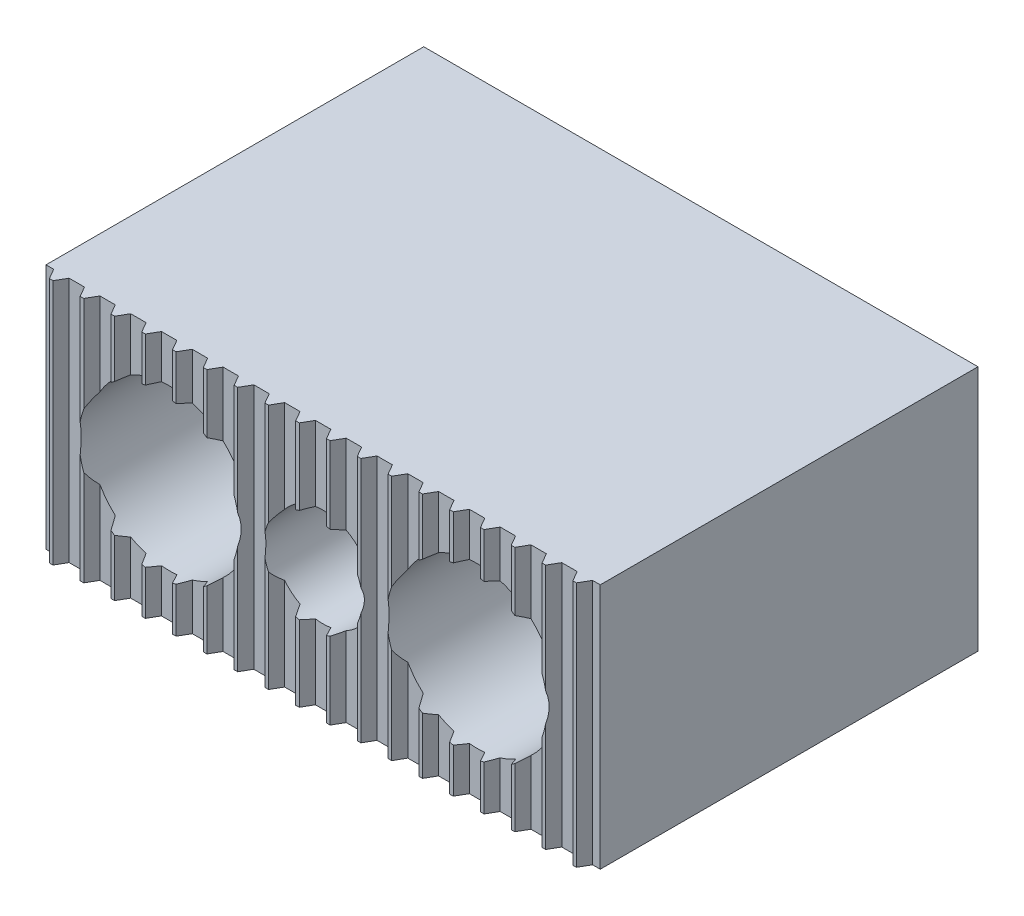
ISO-10303-21;
HEADER;
FILE_DESCRIPTION(('STEP AP214'),'2;1');
FILE_NAME('part.step','',(''),(''),'','','');
FILE_SCHEMA(('AUTOMOTIVE_DESIGN { 1 0 10303 214 1 1 1 1 }'));
ENDSEC;
DATA;
#1=APPLICATION_CONTEXT('core data for automotive mechanical design processes');
#2=APPLICATION_PROTOCOL_DEFINITION('international standard','automotive_design',2000,#1);
#3=PRODUCT_CONTEXT('',#1,'mechanical');
#4=PRODUCT('Part','Part','',(#3));
#5=PRODUCT_RELATED_PRODUCT_CATEGORY('part','',(#4));
#6=PRODUCT_DEFINITION_FORMATION('','',#4);
#7=PRODUCT_DEFINITION_CONTEXT('part definition',#1,'design');
#8=PRODUCT_DEFINITION('design','',#6,#7);
#9=PRODUCT_DEFINITION_SHAPE('','',#8);
#10=(LENGTH_UNIT() NAMED_UNIT(*) SI_UNIT(.MILLI.,.METRE.));
#11=(NAMED_UNIT(*) PLANE_ANGLE_UNIT() SI_UNIT($,.RADIAN.));
#12=(NAMED_UNIT(*) SI_UNIT($,.STERADIAN.) SOLID_ANGLE_UNIT());
#13=UNCERTAINTY_MEASURE_WITH_UNIT(LENGTH_MEASURE(1.E-05),#10,'distance_accuracy_value','');
#14=(GEOMETRIC_REPRESENTATION_CONTEXT(3) GLOBAL_UNCERTAINTY_ASSIGNED_CONTEXT((#13)) GLOBAL_UNIT_ASSIGNED_CONTEXT((#10,
#11,#12)) REPRESENTATION_CONTEXT('',''));
#15=CARTESIAN_POINT('',(0.,0.,0.));
#16=DIRECTION('',(0.,0.,1.));
#17=DIRECTION('',(1.,0.,0.));
#18=AXIS2_PLACEMENT_3D('',#15,#16,#17);
#19=CARTESIAN_POINT('',(-20.,20.,0.));
#20=DIRECTION('',(0.,0.,-1.));
#21=DIRECTION('',(-1.,0.,0.));
#22=AXIS2_PLACEMENT_3D('',#19,#20,#21);
#23=PLANE('',#22);
#24=CARTESIAN_POINT('',(50.,0.,0.));
#25=DIRECTION('',(0.,0.,-1.));
#26=DIRECTION('',(-1.,0.,0.));
#27=AXIS2_PLACEMENT_3D('',#24,#25,#26);
#28=CIRCLE('',#27,9.);
#29=CARTESIAN_POINT('',(41.,0.,0.));
#30=VERTEX_POINT('',#29);
#31=EDGE_CURVE('E853',#30,#30,#28,.T.);
#32=ORIENTED_EDGE('',*,*,#31,.F.);
#33=EDGE_LOOP('',(#32));
#34=FACE_BOUND('',#33,.T.);
#35=DIRECTION('',(0.,-1.,0.));
#36=VECTOR('',#35,1.);
#37=CARTESIAN_POINT('',(-20.,20.,0.));
#38=LINE('',#37,#36);
#39=CARTESIAN_POINT('',(-20.,20.,0.));
#40=VERTEX_POINT('',#39);
#41=CARTESIAN_POINT('',(-20.,-20.,0.));
#42=VERTEX_POINT('',#41);
#43=EDGE_CURVE('E876',#40,#42,#38,.T.);
#44=ORIENTED_EDGE('',*,*,#43,.F.);
#45=DIRECTION('',(1.,0.,0.));
#46=VECTOR('',#45,1.);
#47=CARTESIAN_POINT('',(-20.,20.,0.));
#48=LINE('',#47,#46);
#49=CARTESIAN_POINT('',(70.,20.,0.));
#50=VERTEX_POINT('',#49);
#51=EDGE_CURVE('E1414',#40,#50,#48,.T.);
#52=ORIENTED_EDGE('',*,*,#51,.T.);
#53=DIRECTION('',(0.,-1.,0.));
#54=VECTOR('',#53,1.);
#55=CARTESIAN_POINT('',(70.,20.,0.));
#56=LINE('',#55,#54);
#57=CARTESIAN_POINT('',(70.,-20.,0.));
#58=VERTEX_POINT('',#57);
#59=EDGE_CURVE('E878',#50,#58,#56,.T.);
#60=ORIENTED_EDGE('',*,*,#59,.T.);
#61=DIRECTION('',(1.,0.,0.));
#62=VECTOR('',#61,1.);
#63=CARTESIAN_POINT('',(-20.,-20.,0.));
#64=LINE('',#63,#62);
#65=EDGE_CURVE('E1190',#42,#58,#64,.T.);
#66=ORIENTED_EDGE('',*,*,#65,.F.);
#67=EDGE_LOOP('',(#44,#52,#60,#66));
#68=FACE_BOUND('',#67,.T.);
#69=CARTESIAN_POINT('',(0.,0.,0.));
#70=DIRECTION('',(0.,0.,-1.));
#71=DIRECTION('',(-1.,0.,0.));
#72=AXIS2_PLACEMENT_3D('',#69,#70,#71);
#73=CIRCLE('',#72,9.);
#74=CARTESIAN_POINT('',(-9.,0.,0.));
#75=VERTEX_POINT('',#74);
#76=EDGE_CURVE('E1683',#75,#75,#73,.T.);
#77=ORIENTED_EDGE('',*,*,#76,.F.);
#78=EDGE_LOOP('',(#77));
#79=FACE_BOUND('',#78,.T.);
#80=ADVANCED_FACE('F14',(#34,#68,#79),#23,.T.);
#81=CARTESIAN_POINT('',(-12.7915985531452,20.,63.));
#82=DIRECTION('',(-0.866025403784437,0.,0.5));
#83=DIRECTION('',(0.5,0.,0.866025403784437));
#84=AXIS2_PLACEMENT_3D('',#81,#82,#83);
#85=PLANE('',#84);
#86=DIRECTION('',(0.,-1.,0.));
#87=VECTOR('',#86,1.);
#88=CARTESIAN_POINT('',(-12.7915985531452,20.,63.));
#89=LINE('',#88,#87);
#90=CARTESIAN_POINT('',(-12.7915985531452,-2.318406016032,63.));
#91=VERTEX_POINT('',#90);
#92=CARTESIAN_POINT('',(-12.7915985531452,-20.,63.));
#93=VERTEX_POINT('',#92);
#94=EDGE_CURVE('E852',#91,#93,#89,.T.);
#95=ORIENTED_EDGE('',*,*,#94,.F.);
#96=CARTESIAN_POINT('',(0.,0.,85.1556986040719));
#97=DIRECTION('',(-0.866025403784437,0.,0.5));
#98=DIRECTION('',(-0.5,0.,-0.866025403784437));
#99=AXIS2_PLACEMENT_3D('',#96,#97,#98);
#100=ELLIPSE('',#99,26.,13.);
#101=CARTESIAN_POINT('',(-12.7915985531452,2.318406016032,63.));
#102=VERTEX_POINT('',#101);
#103=EDGE_CURVE('E834',#91,#102,#100,.F.);
#104=ORIENTED_EDGE('',*,*,#103,.T.);
#105=CARTESIAN_POINT('',(-12.7915985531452,20.,63.));
#106=VERTEX_POINT('',#105);
#107=EDGE_CURVE('E849',#106,#102,#89,.T.);
#108=ORIENTED_EDGE('',*,*,#107,.F.);
#109=DIRECTION('',(-0.5,0.,-0.866025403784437));
#110=VECTOR('',#109,1.);
#111=CARTESIAN_POINT('',(-12.7915985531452,20.,63.));
#112=LINE('',#111,#110);
#113=CARTESIAN_POINT('',(-13.75,20.,61.34));
#114=VERTEX_POINT('',#113);
#115=EDGE_CURVE('E1394',#106,#114,#112,.T.);
#116=ORIENTED_EDGE('',*,*,#115,.T.);
#117=DIRECTION('',(0.,-1.,0.));
#118=VECTOR('',#117,1.);
#119=CARTESIAN_POINT('',(-13.75,20.,61.34));
#120=LINE('',#119,#118);
#121=CARTESIAN_POINT('',(-13.75,-20.,61.34));
#122=VERTEX_POINT('',#121);
#123=EDGE_CURVE('E859',#114,#122,#120,.T.);
#124=ORIENTED_EDGE('',*,*,#123,.T.);
#125=DIRECTION('',(-0.5,0.,-0.866025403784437));
#126=VECTOR('',#125,1.);
#127=CARTESIAN_POINT('',(-12.7915985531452,-20.,63.));
#128=LINE('',#127,#126);
#129=EDGE_CURVE('E1169',#93,#122,#128,.T.);
#130=ORIENTED_EDGE('',*,*,#129,.F.);
#131=EDGE_LOOP('',(#95,#104,#108,#116,#124,#130));
#132=FACE_BOUND('',#131,.T.);
#133=ADVANCED_FACE('F847',(#132),#85,.T.);
#134=CARTESIAN_POINT('',(-12.7915985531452,20.,63.));
#135=DIRECTION('',(0.,0.,-1.));
#136=DIRECTION('',(-1.,0.,0.));
#137=AXIS2_PLACEMENT_3D('',#134,#135,#136);
#138=PLANE('',#137);
#139=CARTESIAN_POINT('',(0.,0.,63.));
#140=DIRECTION('',(0.,0.,-1.));
#141=DIRECTION('',(-1.,0.,0.));
#142=AXIS2_PLACEMENT_3D('',#139,#140,#141);
#143=CIRCLE('',#142,13.);
#144=CARTESIAN_POINT('',(-12.2084014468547,-4.46709459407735,63.));
#145=VERTEX_POINT('',#144);
#146=EDGE_CURVE('E844',#145,#91,#143,.T.);
#147=ORIENTED_EDGE('',*,*,#146,.T.);
#148=ORIENTED_EDGE('',*,*,#94,.T.);
#149=DIRECTION('',(1.,0.,0.));
#150=VECTOR('',#149,1.);
#151=CARTESIAN_POINT('',(-12.7915985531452,-20.,63.));
#152=LINE('',#151,#150);
#153=CARTESIAN_POINT('',(-12.2084014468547,-20.,63.));
#154=VERTEX_POINT('',#153);
#155=EDGE_CURVE('E1156',#93,#154,#152,.T.);
#156=ORIENTED_EDGE('',*,*,#155,.T.);
#157=DIRECTION('',(0.,-1.,0.));
#158=VECTOR('',#157,1.);
#159=CARTESIAN_POINT('',(-12.2084014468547,20.,63.));
#160=LINE('',#159,#158);
#161=EDGE_CURVE('E1132',#145,#154,#160,.T.);
#162=ORIENTED_EDGE('',*,*,#161,.F.);
#163=EDGE_LOOP('',(#147,#148,#156,#162));
#164=FACE_BOUND('',#163,.T.);
#165=ADVANCED_FACE('F1696',(#164),#138,.F.);
#166=CARTESIAN_POINT('',(-12.2084014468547,4.46709459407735,63.));
#167=VERTEX_POINT('',#166);
#168=EDGE_CURVE('E831',#102,#167,#143,.T.);
#169=ORIENTED_EDGE('',*,*,#168,.T.);
#170=CARTESIAN_POINT('',(-12.2084014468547,20.,63.));
#171=VERTEX_POINT('',#170);
#172=EDGE_CURVE('E863',#171,#167,#160,.T.);
#173=ORIENTED_EDGE('',*,*,#172,.F.);
#174=DIRECTION('',(1.,0.,0.));
#175=VECTOR('',#174,1.);
#176=CARTESIAN_POINT('',(-12.7915985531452,20.,63.));
#177=LINE('',#176,#175);
#178=EDGE_CURVE('E858',#106,#171,#177,.T.);
#179=ORIENTED_EDGE('',*,*,#178,.F.);
#180=ORIENTED_EDGE('',*,*,#107,.T.);
#181=EDGE_LOOP('',(#169,#173,#179,#180));
#182=FACE_BOUND('',#181,.T.);
#183=ADVANCED_FACE('F856',(#182),#138,.F.);
#184=CARTESIAN_POINT('',(-12.2084014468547,20.,63.));
#185=DIRECTION('',(-0.866025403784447,0.,-0.499999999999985));
#186=DIRECTION('',(-0.499999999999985,0.,0.866025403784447));
#187=AXIS2_PLACEMENT_3D('',#184,#185,#186);
#188=PLANE('',#187);
#189=CARTESIAN_POINT('',(0.,0.,41.8544284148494));
#190=DIRECTION('',(-0.866025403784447,0.,-0.499999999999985));
#191=DIRECTION('',(0.499999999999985,0.,-0.866025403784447));
#192=AXIS2_PLACEMENT_3D('',#189,#190,#191);
#193=ELLIPSE('',#192,26.0000000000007,13.);
#194=CARTESIAN_POINT('',(-11.25,6.51440711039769,61.34));
#195=VERTEX_POINT('',#194);
#196=EDGE_CURVE('E837',#195,#167,#193,.F.);
#197=ORIENTED_EDGE('',*,*,#196,.F.);
#198=DIRECTION('',(0.,-1.,0.));
#199=VECTOR('',#198,1.);
#200=CARTESIAN_POINT('',(-11.25,20.,61.34));
#201=LINE('',#200,#199);
#202=CARTESIAN_POINT('',(-11.25,20.,61.34));
#203=VERTEX_POINT('',#202);
#204=EDGE_CURVE('E1130',#203,#195,#201,.T.);
#205=ORIENTED_EDGE('',*,*,#204,.F.);
#206=DIRECTION('',(0.499999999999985,0.,-0.866025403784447));
#207=VECTOR('',#206,1.);
#208=CARTESIAN_POINT('',(-12.2084014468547,20.,63.));
#209=LINE('',#208,#207);
#210=EDGE_CURVE('E1390',#171,#203,#209,.T.);
#211=ORIENTED_EDGE('',*,*,#210,.F.);
#212=ORIENTED_EDGE('',*,*,#172,.T.);
#213=EDGE_LOOP('',(#197,#205,#211,#212));
#214=FACE_BOUND('',#213,.T.);
#215=ADVANCED_FACE('F2118',(#214),#188,.F.);
#216=CARTESIAN_POINT('',(-11.25,-6.51440711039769,61.34));
#217=VERTEX_POINT('',#216);
#218=EDGE_CURVE('E2110',#145,#217,#193,.F.);
#219=ORIENTED_EDGE('',*,*,#218,.F.);
#220=ORIENTED_EDGE('',*,*,#161,.T.);
#221=DIRECTION('',(0.499999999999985,0.,-0.866025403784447));
#222=VECTOR('',#221,1.);
#223=CARTESIAN_POINT('',(-12.2084014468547,-20.,63.));
#224=LINE('',#223,#222);
#225=CARTESIAN_POINT('',(-11.25,-20.,61.34));
#226=VERTEX_POINT('',#225);
#227=EDGE_CURVE('E1150',#154,#226,#224,.T.);
#228=ORIENTED_EDGE('',*,*,#227,.T.);
#229=EDGE_CURVE('E1129',#217,#226,#201,.T.);
#230=ORIENTED_EDGE('',*,*,#229,.F.);
#231=EDGE_LOOP('',(#219,#220,#228,#230));
#232=FACE_BOUND('',#231,.T.);
#233=ADVANCED_FACE('F1151',(#232),#188,.F.);
#234=CARTESIAN_POINT('',(-11.25,20.,61.34));
#235=DIRECTION('',(0.,0.,-1.));
#236=DIRECTION('',(-1.,0.,0.));
#237=AXIS2_PLACEMENT_3D('',#234,#235,#236);
#238=PLANE('',#237);
#239=CARTESIAN_POINT('',(0.,0.,61.34));
#240=DIRECTION('',(0.,0.,-1.));
#241=DIRECTION('',(-1.,0.,0.));
#242=AXIS2_PLACEMENT_3D('',#239,#240,#241);
#243=CIRCLE('',#242,13.);
#244=CARTESIAN_POINT('',(-8.75,-9.6144422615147,61.34));
#245=VERTEX_POINT('',#244);
#246=EDGE_CURVE('E1146',#217,#245,#243,.F.);
#247=ORIENTED_EDGE('',*,*,#246,.F.);
#248=ORIENTED_EDGE('',*,*,#229,.T.);
#249=DIRECTION('',(1.,0.,0.));
#250=VECTOR('',#249,1.);
#251=CARTESIAN_POINT('',(-11.25,-20.,61.34));
#252=LINE('',#251,#250);
#253=CARTESIAN_POINT('',(-8.75,-20.,61.34));
#254=VERTEX_POINT('',#253);
#255=EDGE_CURVE('E1144',#226,#254,#252,.T.);
#256=ORIENTED_EDGE('',*,*,#255,.T.);
#257=DIRECTION('',(0.,-1.,0.));
#258=VECTOR('',#257,1.);
#259=CARTESIAN_POINT('',(-8.75,20.,61.34));
#260=LINE('',#259,#258);
#261=EDGE_CURVE('E1126',#245,#254,#260,.T.);
#262=ORIENTED_EDGE('',*,*,#261,.F.);
#263=EDGE_LOOP('',(#247,#248,#256,#262));
#264=FACE_BOUND('',#263,.T.);
#265=ADVANCED_FACE('F1141',(#264),#238,.F.);
#266=CARTESIAN_POINT('',(-8.75,9.6144422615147,61.34));
#267=VERTEX_POINT('',#266);
#268=EDGE_CURVE('E2112',#267,#195,#243,.F.);
#269=ORIENTED_EDGE('',*,*,#268,.F.);
#270=CARTESIAN_POINT('',(-8.75,20.,61.34));
#271=VERTEX_POINT('',#270);
#272=EDGE_CURVE('E1127',#271,#267,#260,.T.);
#273=ORIENTED_EDGE('',*,*,#272,.F.);
#274=DIRECTION('',(1.,0.,0.));
#275=VECTOR('',#274,1.);
#276=CARTESIAN_POINT('',(-11.25,20.,61.34));
#277=LINE('',#276,#275);
#278=EDGE_CURVE('E1387',#203,#271,#277,.T.);
#279=ORIENTED_EDGE('',*,*,#278,.F.);
#280=ORIENTED_EDGE('',*,*,#204,.T.);
#281=EDGE_LOOP('',(#269,#273,#279,#280));
#282=FACE_BOUND('',#281,.T.);
#283=ADVANCED_FACE('F2115',(#282),#238,.F.);
#284=CARTESIAN_POINT('',(-7.79159855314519,20.,63.));
#285=DIRECTION('',(-0.866025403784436,0.,0.5));
#286=DIRECTION('',(0.5,0.,0.866025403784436));
#287=AXIS2_PLACEMENT_3D('',#284,#285,#286);
#288=PLANE('',#287);
#289=ORIENTED_EDGE('',*,*,#272,.T.);
#290=CARTESIAN_POINT('',(0.,0.,76.4954445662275));
#291=DIRECTION('',(-0.866025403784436,0.,0.5));
#292=DIRECTION('',(-0.5,0.,-0.866025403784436));
#293=AXIS2_PLACEMENT_3D('',#290,#291,#292);
#294=ELLIPSE('',#293,26.,13.);
#295=CARTESIAN_POINT('',(-7.79159855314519,10.4062957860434,63.));
#296=VERTEX_POINT('',#295);
#297=EDGE_CURVE('E1644',#267,#296,#294,.F.);
#298=ORIENTED_EDGE('',*,*,#297,.T.);
#299=DIRECTION('',(0.,-1.,0.));
#300=VECTOR('',#299,1.);
#301=CARTESIAN_POINT('',(-7.79159855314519,20.,63.));
#302=LINE('',#301,#300);
#303=CARTESIAN_POINT('',(-7.79159855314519,20.,63.));
#304=VERTEX_POINT('',#303);
#305=EDGE_CURVE('E1123',#304,#296,#302,.T.);
#306=ORIENTED_EDGE('',*,*,#305,.F.);
#307=DIRECTION('',(-0.5,0.,-0.866025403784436));
#308=VECTOR('',#307,1.);
#309=CARTESIAN_POINT('',(-7.79159855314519,20.,63.));
#310=LINE('',#309,#308);
#311=EDGE_CURVE('E1384',#304,#271,#310,.T.);
#312=ORIENTED_EDGE('',*,*,#311,.T.);
#313=EDGE_LOOP('',(#289,#298,#306,#312));
#314=FACE_BOUND('',#313,.T.);
#315=ADVANCED_FACE('F2114',(#314),#288,.T.);
#316=CARTESIAN_POINT('',(-7.79159855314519,-10.4062957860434,63.));
#317=VERTEX_POINT('',#316);
#318=CARTESIAN_POINT('',(-7.79159855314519,-20.,63.));
#319=VERTEX_POINT('',#318);
#320=EDGE_CURVE('E1122',#317,#319,#302,.T.);
#321=ORIENTED_EDGE('',*,*,#320,.F.);
#322=EDGE_CURVE('E1640',#317,#245,#294,.F.);
#323=ORIENTED_EDGE('',*,*,#322,.T.);
#324=ORIENTED_EDGE('',*,*,#261,.T.);
#325=DIRECTION('',(-0.5,0.,-0.866025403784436));
#326=VECTOR('',#325,1.);
#327=CARTESIAN_POINT('',(-7.79159855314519,-20.,63.));
#328=LINE('',#327,#326);
#329=EDGE_CURVE('E1162',#319,#254,#328,.T.);
#330=ORIENTED_EDGE('',*,*,#329,.F.);
#331=EDGE_LOOP('',(#321,#323,#324,#330));
#332=FACE_BOUND('',#331,.T.);
#333=ADVANCED_FACE('F2351',(#332),#288,.T.);
#334=CARTESIAN_POINT('',(-7.79159855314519,20.,63.));
#335=DIRECTION('',(0.,0.,-1.));
#336=DIRECTION('',(-1.,0.,0.));
#337=AXIS2_PLACEMENT_3D('',#334,#335,#336);
#338=PLANE('',#337);
#339=CARTESIAN_POINT('',(-7.2084014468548,-10.8184540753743,63.));
#340=VERTEX_POINT('',#339);
#341=EDGE_CURVE('E1732',#340,#317,#143,.T.);
#342=ORIENTED_EDGE('',*,*,#341,.T.);
#343=ORIENTED_EDGE('',*,*,#320,.T.);
#344=DIRECTION('',(1.,0.,0.));
#345=VECTOR('',#344,1.);
#346=CARTESIAN_POINT('',(-7.79159855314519,-20.,63.));
#347=LINE('',#346,#345);
#348=CARTESIAN_POINT('',(-7.20840144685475,-20.,63.));
#349=VERTEX_POINT('',#348);
#350=EDGE_CURVE('E1164',#319,#349,#347,.T.);
#351=ORIENTED_EDGE('',*,*,#350,.T.);
#352=DIRECTION('',(0.,-1.,0.));
#353=VECTOR('',#352,1.);
#354=CARTESIAN_POINT('',(-7.20840144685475,20.,63.));
#355=LINE('',#354,#353);
#356=EDGE_CURVE('E1118',#340,#349,#355,.T.);
#357=ORIENTED_EDGE('',*,*,#356,.F.);
#358=EDGE_LOOP('',(#342,#343,#351,#357));
#359=FACE_BOUND('',#358,.T.);
#360=ADVANCED_FACE('F1621',(#359),#338,.F.);
#361=CARTESIAN_POINT('',(-7.2084014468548,10.8184540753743,63.));
#362=VERTEX_POINT('',#361);
#363=EDGE_CURVE('E842',#296,#362,#143,.T.);
#364=ORIENTED_EDGE('',*,*,#363,.T.);
#365=CARTESIAN_POINT('',(-7.20840144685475,20.,63.));
#366=VERTEX_POINT('',#365);
#367=EDGE_CURVE('E1119',#366,#362,#355,.T.);
#368=ORIENTED_EDGE('',*,*,#367,.F.);
#369=DIRECTION('',(1.,0.,0.));
#370=VECTOR('',#369,1.);
#371=CARTESIAN_POINT('',(-7.79159855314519,20.,63.));
#372=LINE('',#371,#370);
#373=EDGE_CURVE('E1381',#304,#366,#372,.T.);
#374=ORIENTED_EDGE('',*,*,#373,.F.);
#375=ORIENTED_EDGE('',*,*,#305,.T.);
#376=EDGE_LOOP('',(#364,#368,#374,#375));
#377=FACE_BOUND('',#376,.T.);
#378=ADVANCED_FACE('F1764',(#377),#338,.F.);
#379=CARTESIAN_POINT('',(-7.20840144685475,20.,63.));
#380=DIRECTION('',(-0.866025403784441,0.,-0.5));
#381=DIRECTION('',(-0.5,0.,0.866025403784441));
#382=AXIS2_PLACEMENT_3D('',#379,#380,#381);
#383=PLANE('',#382);
#384=CARTESIAN_POINT('',(0.,0.,50.5146824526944));
#385=DIRECTION('',(-0.866025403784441,0.,-0.5));
#386=DIRECTION('',(0.5,0.,-0.866025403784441));
#387=AXIS2_PLACEMENT_3D('',#384,#385,#386);
#388=ELLIPSE('',#387,26.,13.);
#389=CARTESIAN_POINT('',(-6.25,11.399013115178,61.34));
#390=VERTEX_POINT('',#389);
#391=EDGE_CURVE('E1633',#390,#362,#388,.F.);
#392=ORIENTED_EDGE('',*,*,#391,.F.);
#393=DIRECTION('',(0.,-1.,0.));
#394=VECTOR('',#393,1.);
#395=CARTESIAN_POINT('',(-6.25,20.,61.34));
#396=LINE('',#395,#394);
#397=CARTESIAN_POINT('',(-6.25,20.,61.34));
#398=VERTEX_POINT('',#397);
#399=EDGE_CURVE('E1115',#398,#390,#396,.T.);
#400=ORIENTED_EDGE('',*,*,#399,.F.);
#401=DIRECTION('',(0.5,0.,-0.866025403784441));
#402=VECTOR('',#401,1.);
#403=CARTESIAN_POINT('',(-7.20840144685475,20.,63.));
#404=LINE('',#403,#402);
#405=EDGE_CURVE('E1378',#366,#398,#404,.T.);
#406=ORIENTED_EDGE('',*,*,#405,.F.);
#407=ORIENTED_EDGE('',*,*,#367,.T.);
#408=EDGE_LOOP('',(#392,#400,#406,#407));
#409=FACE_BOUND('',#408,.T.);
#410=ADVANCED_FACE('F1769',(#409),#383,.F.);
#411=CARTESIAN_POINT('',(-6.25,-11.399013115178,61.34));
#412=VERTEX_POINT('',#411);
#413=EDGE_CURVE('E1628',#340,#412,#388,.F.);
#414=ORIENTED_EDGE('',*,*,#413,.F.);
#415=ORIENTED_EDGE('',*,*,#356,.T.);
#416=DIRECTION('',(0.5,0.,-0.866025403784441));
#417=VECTOR('',#416,1.);
#418=CARTESIAN_POINT('',(-7.20840144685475,-20.,63.));
#419=LINE('',#418,#417);
#420=CARTESIAN_POINT('',(-6.25,-20.,61.34));
#421=VERTEX_POINT('',#420);
#422=EDGE_CURVE('E1614',#349,#421,#419,.T.);
#423=ORIENTED_EDGE('',*,*,#422,.T.);
#424=EDGE_CURVE('E1114',#412,#421,#396,.T.);
#425=ORIENTED_EDGE('',*,*,#424,.F.);
#426=EDGE_LOOP('',(#414,#415,#423,#425));
#427=FACE_BOUND('',#426,.T.);
#428=ADVANCED_FACE('F1627',(#427),#383,.F.);
#429=CARTESIAN_POINT('',(-6.25,20.,61.34));
#430=DIRECTION('',(0.,0.,-1.));
#431=DIRECTION('',(-1.,0.,0.));
#432=AXIS2_PLACEMENT_3D('',#429,#430,#431);
#433=PLANE('',#432);
#434=CARTESIAN_POINT('',(0.,0.,61.34));
#435=DIRECTION('',(0.,0.,-1.));
#436=DIRECTION('',(-1.,0.,0.));
#437=AXIS2_PLACEMENT_3D('',#434,#435,#436);
#438=CIRCLE('',#437,13.);
#439=CARTESIAN_POINT('',(-3.75,-12.4473892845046,61.34));
#440=VERTEX_POINT('',#439);
#441=EDGE_CURVE('E1631',#412,#440,#438,.F.);
#442=ORIENTED_EDGE('',*,*,#441,.F.);
#443=ORIENTED_EDGE('',*,*,#424,.T.);
#444=DIRECTION('',(1.,0.,0.));
#445=VECTOR('',#444,1.);
#446=CARTESIAN_POINT('',(-6.25,-20.,61.34));
#447=LINE('',#446,#445);
#448=CARTESIAN_POINT('',(-3.75,-20.,61.34));
#449=VERTEX_POINT('',#448);
#450=EDGE_CURVE('E1611',#421,#449,#447,.T.);
#451=ORIENTED_EDGE('',*,*,#450,.T.);
#452=DIRECTION('',(0.,-1.,0.));
#453=VECTOR('',#452,1.);
#454=CARTESIAN_POINT('',(-3.75,20.,61.34));
#455=LINE('',#454,#453);
#456=EDGE_CURVE('E1110',#440,#449,#455,.T.);
#457=ORIENTED_EDGE('',*,*,#456,.F.);
#458=EDGE_LOOP('',(#442,#443,#451,#457));
#459=FACE_BOUND('',#458,.T.);
#460=ADVANCED_FACE('F2344',(#459),#433,.F.);
#461=CARTESIAN_POINT('',(-3.75,12.4473892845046,61.34));
#462=VERTEX_POINT('',#461);
#463=EDGE_CURVE('E1635',#462,#390,#438,.F.);
#464=ORIENTED_EDGE('',*,*,#463,.F.);
#465=CARTESIAN_POINT('',(-3.75,20.,61.34));
#466=VERTEX_POINT('',#465);
#467=EDGE_CURVE('E1111',#466,#462,#455,.T.);
#468=ORIENTED_EDGE('',*,*,#467,.F.);
#469=DIRECTION('',(1.,0.,0.));
#470=VECTOR('',#469,1.);
#471=CARTESIAN_POINT('',(-6.25,20.,61.34));
#472=LINE('',#471,#470);
#473=EDGE_CURVE('E1375',#398,#466,#472,.T.);
#474=ORIENTED_EDGE('',*,*,#473,.F.);
#475=ORIENTED_EDGE('',*,*,#399,.T.);
#476=EDGE_LOOP('',(#464,#468,#474,#475));
#477=FACE_BOUND('',#476,.T.);
#478=ADVANCED_FACE('F1774',(#477),#433,.F.);
#479=CARTESIAN_POINT('',(-2.7915985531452,20.,63.));
#480=DIRECTION('',(-0.866025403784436,0.,0.5));
#481=DIRECTION('',(0.5,0.,0.866025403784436));
#482=AXIS2_PLACEMENT_3D('',#479,#480,#481);
#483=PLANE('',#482);
#484=ORIENTED_EDGE('',*,*,#467,.T.);
#485=CARTESIAN_POINT('',(0.,0.,67.8351905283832));
#486=DIRECTION('',(-0.866025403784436,0.,0.5));
#487=DIRECTION('',(-0.5,0.,-0.866025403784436));
#488=AXIS2_PLACEMENT_3D('',#485,#486,#487);
#489=ELLIPSE('',#488,26.,13.);
#490=CARTESIAN_POINT('',(-2.7915985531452,12.6967309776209,63.));
#491=VERTEX_POINT('',#490);
#492=EDGE_CURVE('E1630',#462,#491,#489,.F.);
#493=ORIENTED_EDGE('',*,*,#492,.T.);
#494=DIRECTION('',(0.,-1.,0.));
#495=VECTOR('',#494,1.);
#496=CARTESIAN_POINT('',(-2.7915985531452,20.,63.));
#497=LINE('',#496,#495);
#498=CARTESIAN_POINT('',(-2.7915985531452,20.,63.));
#499=VERTEX_POINT('',#498);
#500=EDGE_CURVE('E1107',#499,#491,#497,.T.);
#501=ORIENTED_EDGE('',*,*,#500,.F.);
#502=DIRECTION('',(-0.5,0.,-0.866025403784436));
#503=VECTOR('',#502,1.);
#504=CARTESIAN_POINT('',(-2.7915985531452,20.,63.));
#505=LINE('',#504,#503);
#506=EDGE_CURVE('E1372',#499,#466,#505,.T.);
#507=ORIENTED_EDGE('',*,*,#506,.T.);
#508=EDGE_LOOP('',(#484,#493,#501,#507));
#509=FACE_BOUND('',#508,.T.);
#510=ADVANCED_FACE('F1776',(#509),#483,.T.);
#511=CARTESIAN_POINT('',(-2.7915985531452,-12.6967309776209,63.));
#512=VERTEX_POINT('',#511);
#513=CARTESIAN_POINT('',(-2.7915985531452,-20.,63.));
#514=VERTEX_POINT('',#513);
#515=EDGE_CURVE('E1106',#512,#514,#497,.T.);
#516=ORIENTED_EDGE('',*,*,#515,.F.);
#517=EDGE_CURVE('E1637',#512,#440,#489,.F.);
#518=ORIENTED_EDGE('',*,*,#517,.T.);
#519=ORIENTED_EDGE('',*,*,#456,.T.);
#520=DIRECTION('',(-0.5,0.,-0.866025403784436));
#521=VECTOR('',#520,1.);
#522=CARTESIAN_POINT('',(-2.7915985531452,-20.,63.));
#523=LINE('',#522,#521);
#524=EDGE_CURVE('E1608',#514,#449,#523,.T.);
#525=ORIENTED_EDGE('',*,*,#524,.F.);
#526=EDGE_LOOP('',(#516,#518,#519,#525));
#527=FACE_BOUND('',#526,.T.);
#528=ADVANCED_FACE('F2341',(#527),#483,.T.);
#529=CARTESIAN_POINT('',(-2.7915985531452,20.,63.));
#530=DIRECTION('',(0.,0.,-1.));
#531=DIRECTION('',(-1.,0.,0.));
#532=AXIS2_PLACEMENT_3D('',#529,#530,#531);
#533=PLANE('',#532);
#534=CARTESIAN_POINT('',(-2.20840144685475,-12.8110484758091,63.));
#535=VERTEX_POINT('',#534);
#536=EDGE_CURVE('E1733',#535,#512,#143,.T.);
#537=ORIENTED_EDGE('',*,*,#536,.T.);
#538=ORIENTED_EDGE('',*,*,#515,.T.);
#539=DIRECTION('',(1.,0.,0.));
#540=VECTOR('',#539,1.);
#541=CARTESIAN_POINT('',(-2.7915985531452,-20.,63.));
#542=LINE('',#541,#540);
#543=CARTESIAN_POINT('',(-2.20840144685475,-20.,63.));
#544=VERTEX_POINT('',#543);
#545=EDGE_CURVE('E1605',#514,#544,#542,.T.);
#546=ORIENTED_EDGE('',*,*,#545,.T.);
#547=DIRECTION('',(0.,-1.,0.));
#548=VECTOR('',#547,1.);
#549=CARTESIAN_POINT('',(-2.20840144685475,20.,63.));
#550=LINE('',#549,#548);
#551=EDGE_CURVE('E1102',#535,#544,#550,.T.);
#552=ORIENTED_EDGE('',*,*,#551,.F.);
#553=EDGE_LOOP('',(#537,#538,#546,#552));
#554=FACE_BOUND('',#553,.T.);
#555=ADVANCED_FACE('F2338',(#554),#533,.F.);
#556=CARTESIAN_POINT('',(-2.20840144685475,12.8110484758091,63.));
#557=VERTEX_POINT('',#556);
#558=EDGE_CURVE('E1759',#491,#557,#143,.T.);
#559=ORIENTED_EDGE('',*,*,#558,.T.);
#560=CARTESIAN_POINT('',(-2.20840144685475,20.,63.));
#561=VERTEX_POINT('',#560);
#562=EDGE_CURVE('E1103',#561,#557,#550,.T.);
#563=ORIENTED_EDGE('',*,*,#562,.F.);
#564=DIRECTION('',(1.,0.,0.));
#565=VECTOR('',#564,1.);
#566=CARTESIAN_POINT('',(-2.7915985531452,20.,63.));
#567=LINE('',#566,#565);
#568=EDGE_CURVE('E1369',#499,#561,#567,.T.);
#569=ORIENTED_EDGE('',*,*,#568,.F.);
#570=ORIENTED_EDGE('',*,*,#500,.T.);
#571=EDGE_LOOP('',(#559,#563,#569,#570));
#572=FACE_BOUND('',#571,.T.);
#573=ADVANCED_FACE('F1779',(#572),#533,.F.);
#574=CARTESIAN_POINT('',(-2.20840144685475,20.,63.));
#575=DIRECTION('',(-0.866025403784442,0.,-0.5));
#576=DIRECTION('',(-0.5,0.,0.866025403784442));
#577=AXIS2_PLACEMENT_3D('',#574,#575,#576);
#578=PLANE('',#577);
#579=CARTESIAN_POINT('',(0.,0.,59.1749364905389));
#580=DIRECTION('',(-0.866025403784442,0.,-0.5));
#581=DIRECTION('',(0.5,0.,-0.866025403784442));
#582=AXIS2_PLACEMENT_3D('',#579,#580,#581);
#583=ELLIPSE('',#582,26.,13.);
#584=CARTESIAN_POINT('',(-1.25,12.9397642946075,61.34));
#585=VERTEX_POINT('',#584);
#586=EDGE_CURVE('E1648',#585,#557,#583,.F.);
#587=ORIENTED_EDGE('',*,*,#586,.F.);
#588=DIRECTION('',(0.,-1.,0.));
#589=VECTOR('',#588,1.);
#590=CARTESIAN_POINT('',(-1.25,20.,61.34));
#591=LINE('',#590,#589);
#592=CARTESIAN_POINT('',(-1.25,20.,61.34));
#593=VERTEX_POINT('',#592);
#594=EDGE_CURVE('E1099',#593,#585,#591,.T.);
#595=ORIENTED_EDGE('',*,*,#594,.F.);
#596=DIRECTION('',(0.5,0.,-0.866025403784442));
#597=VECTOR('',#596,1.);
#598=CARTESIAN_POINT('',(-2.20840144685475,20.,63.));
#599=LINE('',#598,#597);
#600=EDGE_CURVE('E1366',#561,#593,#599,.T.);
#601=ORIENTED_EDGE('',*,*,#600,.F.);
#602=ORIENTED_EDGE('',*,*,#562,.T.);
#603=EDGE_LOOP('',(#587,#595,#601,#602));
#604=FACE_BOUND('',#603,.T.);
#605=ADVANCED_FACE('F1782',(#604),#578,.F.);
#606=CARTESIAN_POINT('',(-1.25,-12.9397642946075,61.34));
#607=VERTEX_POINT('',#606);
#608=EDGE_CURVE('E1649',#535,#607,#583,.F.);
#609=ORIENTED_EDGE('',*,*,#608,.F.);
#610=ORIENTED_EDGE('',*,*,#551,.T.);
#611=DIRECTION('',(0.5,0.,-0.866025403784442));
#612=VECTOR('',#611,1.);
#613=CARTESIAN_POINT('',(-2.20840144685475,-20.,63.));
#614=LINE('',#613,#612);
#615=CARTESIAN_POINT('',(-1.25,-20.,61.34));
#616=VERTEX_POINT('',#615);
#617=EDGE_CURVE('E1602',#544,#616,#614,.T.);
#618=ORIENTED_EDGE('',*,*,#617,.T.);
#619=EDGE_CURVE('E1098',#607,#616,#591,.T.);
#620=ORIENTED_EDGE('',*,*,#619,.F.);
#621=EDGE_LOOP('',(#609,#610,#618,#620));
#622=FACE_BOUND('',#621,.T.);
#623=ADVANCED_FACE('F2334',(#622),#578,.F.);
#624=CARTESIAN_POINT('',(-1.25,20.,61.34));
#625=DIRECTION('',(0.,0.,-1.));
#626=DIRECTION('',(-1.,0.,0.));
#627=AXIS2_PLACEMENT_3D('',#624,#625,#626);
#628=PLANE('',#627);
#629=CARTESIAN_POINT('',(0.,0.,61.34));
#630=DIRECTION('',(0.,0.,-1.));
#631=DIRECTION('',(-1.,0.,0.));
#632=AXIS2_PLACEMENT_3D('',#629,#630,#631);
#633=CIRCLE('',#632,13.);
#634=CARTESIAN_POINT('',(1.25,-12.9397642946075,61.34));
#635=VERTEX_POINT('',#634);
#636=EDGE_CURVE('E1652',#607,#635,#633,.F.);
#637=ORIENTED_EDGE('',*,*,#636,.F.);
#638=ORIENTED_EDGE('',*,*,#619,.T.);
#639=DIRECTION('',(1.,0.,0.));
#640=VECTOR('',#639,1.);
#641=CARTESIAN_POINT('',(-1.25,-20.,61.34));
#642=LINE('',#641,#640);
#643=CARTESIAN_POINT('',(1.25,-20.,61.34));
#644=VERTEX_POINT('',#643);
#645=EDGE_CURVE('E1599',#616,#644,#642,.T.);
#646=ORIENTED_EDGE('',*,*,#645,.T.);
#647=DIRECTION('',(0.,-1.,0.));
#648=VECTOR('',#647,1.);
#649=CARTESIAN_POINT('',(1.25,20.,61.34));
#650=LINE('',#649,#648);
#651=EDGE_CURVE('E1094',#635,#644,#650,.T.);
#652=ORIENTED_EDGE('',*,*,#651,.F.);
#653=EDGE_LOOP('',(#637,#638,#646,#652));
#654=FACE_BOUND('',#653,.T.);
#655=ADVANCED_FACE('F2331',(#654),#628,.F.);
#656=CARTESIAN_POINT('',(1.25,12.9397642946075,61.34));
#657=VERTEX_POINT('',#656);
#658=EDGE_CURVE('E1655',#657,#585,#633,.F.);
#659=ORIENTED_EDGE('',*,*,#658,.F.);
#660=CARTESIAN_POINT('',(1.25,20.,61.34));
#661=VERTEX_POINT('',#660);
#662=EDGE_CURVE('E1095',#661,#657,#650,.T.);
#663=ORIENTED_EDGE('',*,*,#662,.F.);
#664=DIRECTION('',(1.,0.,0.));
#665=VECTOR('',#664,1.);
#666=CARTESIAN_POINT('',(-1.25,20.,61.34));
#667=LINE('',#666,#665);
#668=EDGE_CURVE('E1363',#593,#661,#667,.T.);
#669=ORIENTED_EDGE('',*,*,#668,.F.);
#670=ORIENTED_EDGE('',*,*,#594,.T.);
#671=EDGE_LOOP('',(#659,#663,#669,#670));
#672=FACE_BOUND('',#671,.T.);
#673=ADVANCED_FACE('F1787',(#672),#628,.F.);
#674=CARTESIAN_POINT('',(2.2084014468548,20.,63.));
#675=DIRECTION('',(-0.866025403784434,0.,0.500000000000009));
#676=DIRECTION('',(0.500000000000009,0.,0.866025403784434));
#677=AXIS2_PLACEMENT_3D('',#674,#675,#676);
#678=PLANE('',#677);
#679=ORIENTED_EDGE('',*,*,#662,.T.);
#680=CARTESIAN_POINT('',(0.,0.,59.174936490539));
#681=DIRECTION('',(-0.866025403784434,0.,0.500000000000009));
#682=DIRECTION('',(-0.500000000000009,0.,-0.866025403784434));
#683=AXIS2_PLACEMENT_3D('',#680,#681,#682);
#684=ELLIPSE('',#683,25.9999999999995,13.);
#685=CARTESIAN_POINT('',(2.2084014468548,12.8110484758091,63.));
#686=VERTEX_POINT('',#685);
#687=EDGE_CURVE('E1651',#657,#686,#684,.F.);
#688=ORIENTED_EDGE('',*,*,#687,.T.);
#689=DIRECTION('',(0.,-1.,0.));
#690=VECTOR('',#689,1.);
#691=CARTESIAN_POINT('',(2.2084014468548,20.,63.));
#692=LINE('',#691,#690);
#693=CARTESIAN_POINT('',(2.2084014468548,20.,63.));
#694=VERTEX_POINT('',#693);
#695=EDGE_CURVE('E1091',#694,#686,#692,.T.);
#696=ORIENTED_EDGE('',*,*,#695,.F.);
#697=DIRECTION('',(-0.500000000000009,0.,-0.866025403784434));
#698=VECTOR('',#697,1.);
#699=CARTESIAN_POINT('',(2.2084014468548,20.,63.));
#700=LINE('',#699,#698);
#701=EDGE_CURVE('E1360',#694,#661,#700,.T.);
#702=ORIENTED_EDGE('',*,*,#701,.T.);
#703=EDGE_LOOP('',(#679,#688,#696,#702));
#704=FACE_BOUND('',#703,.T.);
#705=ADVANCED_FACE('F1790',(#704),#678,.T.);
#706=CARTESIAN_POINT('',(2.2084014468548,-12.8110484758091,63.));
#707=VERTEX_POINT('',#706);
#708=CARTESIAN_POINT('',(2.2084014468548,-20.,63.));
#709=VERTEX_POINT('',#708);
#710=EDGE_CURVE('E1090',#707,#709,#692,.T.);
#711=ORIENTED_EDGE('',*,*,#710,.F.);
#712=EDGE_CURVE('E1654',#707,#635,#684,.F.);
#713=ORIENTED_EDGE('',*,*,#712,.T.);
#714=ORIENTED_EDGE('',*,*,#651,.T.);
#715=DIRECTION('',(-0.500000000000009,0.,-0.866025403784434));
#716=VECTOR('',#715,1.);
#717=CARTESIAN_POINT('',(2.2084014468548,-20.,63.));
#718=LINE('',#717,#716);
#719=EDGE_CURVE('E1596',#709,#644,#718,.T.);
#720=ORIENTED_EDGE('',*,*,#719,.F.);
#721=EDGE_LOOP('',(#711,#713,#714,#720));
#722=FACE_BOUND('',#721,.T.);
#723=ADVANCED_FACE('F2328',(#722),#678,.T.);
#724=CARTESIAN_POINT('',(2.2084014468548,20.,63.));
#725=DIRECTION('',(0.,0.,-1.));
#726=DIRECTION('',(-1.,0.,0.));
#727=AXIS2_PLACEMENT_3D('',#724,#725,#726);
#728=PLANE('',#727);
#729=CARTESIAN_POINT('',(2.7915985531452,-12.6967309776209,63.));
#730=VERTEX_POINT('',#729);
#731=EDGE_CURVE('E1735',#730,#707,#143,.T.);
#732=ORIENTED_EDGE('',*,*,#731,.T.);
#733=ORIENTED_EDGE('',*,*,#710,.T.);
#734=DIRECTION('',(1.,0.,0.));
#735=VECTOR('',#734,1.);
#736=CARTESIAN_POINT('',(2.2084014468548,-20.,63.));
#737=LINE('',#736,#735);
#738=CARTESIAN_POINT('',(2.79159855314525,-20.,63.));
#739=VERTEX_POINT('',#738);
#740=EDGE_CURVE('E1593',#709,#739,#737,.T.);
#741=ORIENTED_EDGE('',*,*,#740,.T.);
#742=DIRECTION('',(0.,-1.,0.));
#743=VECTOR('',#742,1.);
#744=CARTESIAN_POINT('',(2.79159855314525,20.,63.));
#745=LINE('',#744,#743);
#746=EDGE_CURVE('E1086',#730,#739,#745,.T.);
#747=ORIENTED_EDGE('',*,*,#746,.F.);
#748=EDGE_LOOP('',(#732,#733,#741,#747));
#749=FACE_BOUND('',#748,.T.);
#750=ADVANCED_FACE('F2325',(#749),#728,.F.);
#751=CARTESIAN_POINT('',(2.7915985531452,12.6967309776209,63.));
#752=VERTEX_POINT('',#751);
#753=EDGE_CURVE('E1756',#686,#752,#143,.T.);
#754=ORIENTED_EDGE('',*,*,#753,.T.);
#755=CARTESIAN_POINT('',(2.79159855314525,20.,63.));
#756=VERTEX_POINT('',#755);
#757=EDGE_CURVE('E1087',#756,#752,#745,.T.);
#758=ORIENTED_EDGE('',*,*,#757,.F.);
#759=DIRECTION('',(1.,0.,0.));
#760=VECTOR('',#759,1.);
#761=CARTESIAN_POINT('',(2.2084014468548,20.,63.));
#762=LINE('',#761,#760);
#763=EDGE_CURVE('E1357',#694,#756,#762,.T.);
#764=ORIENTED_EDGE('',*,*,#763,.F.);
#765=ORIENTED_EDGE('',*,*,#695,.T.);
#766=EDGE_LOOP('',(#754,#758,#764,#765));
#767=FACE_BOUND('',#766,.T.);
#768=ADVANCED_FACE('F1793',(#767),#728,.F.);
#769=CARTESIAN_POINT('',(2.79159855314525,20.,63.));
#770=DIRECTION('',(-0.86602540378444,0.,-0.5));
#771=DIRECTION('',(-0.5,0.,0.86602540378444));
#772=AXIS2_PLACEMENT_3D('',#769,#770,#771);
#773=PLANE('',#772);
#774=CARTESIAN_POINT('',(0.,0.,67.8351905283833));
#775=DIRECTION('',(-0.86602540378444,0.,-0.5));
#776=DIRECTION('',(0.5,0.,-0.86602540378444));
#777=AXIS2_PLACEMENT_3D('',#774,#775,#776);
#778=ELLIPSE('',#777,26.,13.);
#779=CARTESIAN_POINT('',(3.75,12.4473892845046,61.34));
#780=VERTEX_POINT('',#779);
#781=EDGE_CURVE('E1658',#780,#752,#778,.F.);
#782=ORIENTED_EDGE('',*,*,#781,.F.);
#783=DIRECTION('',(0.,-1.,0.));
#784=VECTOR('',#783,1.);
#785=CARTESIAN_POINT('',(3.75,20.,61.34));
#786=LINE('',#785,#784);
#787=CARTESIAN_POINT('',(3.75,20.,61.34));
#788=VERTEX_POINT('',#787);
#789=EDGE_CURVE('E1083',#788,#780,#786,.T.);
#790=ORIENTED_EDGE('',*,*,#789,.F.);
#791=DIRECTION('',(0.5,0.,-0.86602540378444));
#792=VECTOR('',#791,1.);
#793=CARTESIAN_POINT('',(2.79159855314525,20.,63.));
#794=LINE('',#793,#792);
#795=EDGE_CURVE('E1354',#756,#788,#794,.T.);
#796=ORIENTED_EDGE('',*,*,#795,.F.);
#797=ORIENTED_EDGE('',*,*,#757,.T.);
#798=EDGE_LOOP('',(#782,#790,#796,#797));
#799=FACE_BOUND('',#798,.T.);
#800=ADVANCED_FACE('F1796',(#799),#773,.F.);
#801=CARTESIAN_POINT('',(3.75,-12.4473892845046,61.34));
#802=VERTEX_POINT('',#801);
#803=EDGE_CURVE('E1659',#730,#802,#778,.F.);
#804=ORIENTED_EDGE('',*,*,#803,.F.);
#805=ORIENTED_EDGE('',*,*,#746,.T.);
#806=DIRECTION('',(0.5,0.,-0.86602540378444));
#807=VECTOR('',#806,1.);
#808=CARTESIAN_POINT('',(2.79159855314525,-20.,63.));
#809=LINE('',#808,#807);
#810=CARTESIAN_POINT('',(3.75,-20.,61.34));
#811=VERTEX_POINT('',#810);
#812=EDGE_CURVE('E1590',#739,#811,#809,.T.);
#813=ORIENTED_EDGE('',*,*,#812,.T.);
#814=EDGE_CURVE('E1082',#802,#811,#786,.T.);
#815=ORIENTED_EDGE('',*,*,#814,.F.);
#816=EDGE_LOOP('',(#804,#805,#813,#815));
#817=FACE_BOUND('',#816,.T.);
#818=ADVANCED_FACE('F2321',(#817),#773,.F.);
#819=CARTESIAN_POINT('',(3.75,20.,61.34));
#820=DIRECTION('',(0.,0.,-1.));
#821=DIRECTION('',(-1.,0.,0.));
#822=AXIS2_PLACEMENT_3D('',#819,#820,#821);
#823=PLANE('',#822);
#824=CARTESIAN_POINT('',(0.,0.,61.34));
#825=DIRECTION('',(0.,0.,-1.));
#826=DIRECTION('',(-1.,0.,0.));
#827=AXIS2_PLACEMENT_3D('',#824,#825,#826);
#828=CIRCLE('',#827,13.);
#829=CARTESIAN_POINT('',(6.25,-11.399013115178,61.34));
#830=VERTEX_POINT('',#829);
#831=EDGE_CURVE('E1662',#802,#830,#828,.F.);
#832=ORIENTED_EDGE('',*,*,#831,.F.);
#833=ORIENTED_EDGE('',*,*,#814,.T.);
#834=DIRECTION('',(1.,0.,0.));
#835=VECTOR('',#834,1.);
#836=CARTESIAN_POINT('',(3.75,-20.,61.34));
#837=LINE('',#836,#835);
#838=CARTESIAN_POINT('',(6.25,-20.,61.34));
#839=VERTEX_POINT('',#838);
#840=EDGE_CURVE('E1587',#811,#839,#837,.T.);
#841=ORIENTED_EDGE('',*,*,#840,.T.);
#842=DIRECTION('',(0.,-1.,0.));
#843=VECTOR('',#842,1.);
#844=CARTESIAN_POINT('',(6.25,20.,61.34));
#845=LINE('',#844,#843);
#846=EDGE_CURVE('E1078',#830,#839,#845,.T.);
#847=ORIENTED_EDGE('',*,*,#846,.F.);
#848=EDGE_LOOP('',(#832,#833,#841,#847));
#849=FACE_BOUND('',#848,.T.);
#850=ADVANCED_FACE('F2318',(#849),#823,.F.);
#851=CARTESIAN_POINT('',(6.25,11.399013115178,61.34));
#852=VERTEX_POINT('',#851);
#853=EDGE_CURVE('E1665',#852,#780,#828,.F.);
#854=ORIENTED_EDGE('',*,*,#853,.F.);
#855=CARTESIAN_POINT('',(6.25,20.,61.34));
#856=VERTEX_POINT('',#855);
#857=EDGE_CURVE('E1079',#856,#852,#845,.T.);
#858=ORIENTED_EDGE('',*,*,#857,.F.);
#859=DIRECTION('',(1.,0.,0.));
#860=VECTOR('',#859,1.);
#861=CARTESIAN_POINT('',(3.75,20.,61.34));
#862=LINE('',#861,#860);
#863=EDGE_CURVE('E1351',#788,#856,#862,.T.);
#864=ORIENTED_EDGE('',*,*,#863,.F.);
#865=ORIENTED_EDGE('',*,*,#789,.T.);
#866=EDGE_LOOP('',(#854,#858,#864,#865));
#867=FACE_BOUND('',#866,.T.);
#868=ADVANCED_FACE('F1801',(#867),#823,.F.);
#869=CARTESIAN_POINT('',(7.2084014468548,20.,63.));
#870=DIRECTION('',(-0.866025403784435,0.,0.500000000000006));
#871=DIRECTION('',(0.500000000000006,0.,0.866025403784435));
#872=AXIS2_PLACEMENT_3D('',#869,#870,#871);
#873=PLANE('',#872);
#874=ORIENTED_EDGE('',*,*,#857,.T.);
#875=CARTESIAN_POINT('',(0.,0.,50.5146824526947));
#876=DIRECTION('',(-0.866025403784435,0.,0.500000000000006));
#877=DIRECTION('',(-0.500000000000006,0.,-0.866025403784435));
#878=AXIS2_PLACEMENT_3D('',#875,#876,#877);
#879=ELLIPSE('',#878,25.9999999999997,13.);
#880=CARTESIAN_POINT('',(7.2084014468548,10.8184540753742,63.));
#881=VERTEX_POINT('',#880);
#882=EDGE_CURVE('E1661',#852,#881,#879,.F.);
#883=ORIENTED_EDGE('',*,*,#882,.T.);
#884=DIRECTION('',(0.,-1.,0.));
#885=VECTOR('',#884,1.);
#886=CARTESIAN_POINT('',(7.2084014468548,20.,63.));
#887=LINE('',#886,#885);
#888=CARTESIAN_POINT('',(7.2084014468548,20.,63.));
#889=VERTEX_POINT('',#888);
#890=EDGE_CURVE('E1075',#889,#881,#887,.T.);
#891=ORIENTED_EDGE('',*,*,#890,.F.);
#892=DIRECTION('',(-0.500000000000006,0.,-0.866025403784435));
#893=VECTOR('',#892,1.);
#894=CARTESIAN_POINT('',(7.2084014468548,20.,63.));
#895=LINE('',#894,#893);
#896=EDGE_CURVE('E1348',#889,#856,#895,.T.);
#897=ORIENTED_EDGE('',*,*,#896,.T.);
#898=EDGE_LOOP('',(#874,#883,#891,#897));
#899=FACE_BOUND('',#898,.T.);
#900=ADVANCED_FACE('F1804',(#899),#873,.T.);
#901=CARTESIAN_POINT('',(7.2084014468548,-10.8184540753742,63.));
#902=VERTEX_POINT('',#901);
#903=CARTESIAN_POINT('',(7.2084014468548,-20.,63.));
#904=VERTEX_POINT('',#903);
#905=EDGE_CURVE('E1074',#902,#904,#887,.T.);
#906=ORIENTED_EDGE('',*,*,#905,.F.);
#907=EDGE_CURVE('E1664',#902,#830,#879,.F.);
#908=ORIENTED_EDGE('',*,*,#907,.T.);
#909=ORIENTED_EDGE('',*,*,#846,.T.);
#910=DIRECTION('',(-0.500000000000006,0.,-0.866025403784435));
#911=VECTOR('',#910,1.);
#912=CARTESIAN_POINT('',(7.2084014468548,-20.,63.));
#913=LINE('',#912,#911);
#914=EDGE_CURVE('E1584',#904,#839,#913,.T.);
#915=ORIENTED_EDGE('',*,*,#914,.F.);
#916=EDGE_LOOP('',(#906,#908,#909,#915));
#917=FACE_BOUND('',#916,.T.);
#918=ADVANCED_FACE('F2315',(#917),#873,.T.);
#919=CARTESIAN_POINT('',(7.2084014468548,20.,63.));
#920=DIRECTION('',(0.,0.,-1.));
#921=DIRECTION('',(-1.,0.,0.));
#922=AXIS2_PLACEMENT_3D('',#919,#920,#921);
#923=PLANE('',#922);
#924=CARTESIAN_POINT('',(7.79159855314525,-10.4062957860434,63.));
#925=VERTEX_POINT('',#924);
#926=EDGE_CURVE('E1740',#925,#902,#143,.T.);
#927=ORIENTED_EDGE('',*,*,#926,.T.);
#928=ORIENTED_EDGE('',*,*,#905,.T.);
#929=DIRECTION('',(1.,0.,0.));
#930=VECTOR('',#929,1.);
#931=CARTESIAN_POINT('',(7.2084014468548,-20.,63.));
#932=LINE('',#931,#930);
#933=CARTESIAN_POINT('',(7.79159855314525,-20.,63.));
#934=VERTEX_POINT('',#933);
#935=EDGE_CURVE('E1581',#904,#934,#932,.T.);
#936=ORIENTED_EDGE('',*,*,#935,.T.);
#937=DIRECTION('',(0.,-1.,0.));
#938=VECTOR('',#937,1.);
#939=CARTESIAN_POINT('',(7.79159855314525,20.,63.));
#940=LINE('',#939,#938);
#941=EDGE_CURVE('E1070',#925,#934,#940,.T.);
#942=ORIENTED_EDGE('',*,*,#941,.F.);
#943=EDGE_LOOP('',(#927,#928,#936,#942));
#944=FACE_BOUND('',#943,.T.);
#945=ADVANCED_FACE('F2312',(#944),#923,.F.);
#946=CARTESIAN_POINT('',(7.79159855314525,10.4062957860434,63.));
#947=VERTEX_POINT('',#946);
#948=EDGE_CURVE('E1753',#881,#947,#143,.T.);
#949=ORIENTED_EDGE('',*,*,#948,.T.);
#950=CARTESIAN_POINT('',(7.79159855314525,20.,63.));
#951=VERTEX_POINT('',#950);
#952=EDGE_CURVE('E1071',#951,#947,#940,.T.);
#953=ORIENTED_EDGE('',*,*,#952,.F.);
#954=DIRECTION('',(1.,0.,0.));
#955=VECTOR('',#954,1.);
#956=CARTESIAN_POINT('',(7.2084014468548,20.,63.));
#957=LINE('',#956,#955);
#958=EDGE_CURVE('E1345',#889,#951,#957,.T.);
#959=ORIENTED_EDGE('',*,*,#958,.F.);
#960=ORIENTED_EDGE('',*,*,#890,.T.);
#961=EDGE_LOOP('',(#949,#953,#959,#960));
#962=FACE_BOUND('',#961,.T.);
#963=ADVANCED_FACE('F1807',(#962),#923,.F.);
#964=CARTESIAN_POINT('',(7.79159855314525,20.,63.));
#965=DIRECTION('',(-0.866025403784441,0.,-0.5));
#966=DIRECTION('',(-0.5,0.,0.866025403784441));
#967=AXIS2_PLACEMENT_3D('',#964,#965,#966);
#968=PLANE('',#967);
#969=CARTESIAN_POINT('',(0.,0.,76.4954445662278));
#970=DIRECTION('',(-0.866025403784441,0.,-0.5));
#971=DIRECTION('',(0.5,0.,-0.866025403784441));
#972=AXIS2_PLACEMENT_3D('',#969,#970,#971);
#973=ELLIPSE('',#972,26.,13.);
#974=CARTESIAN_POINT('',(8.75,9.61444226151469,61.34));
#975=VERTEX_POINT('',#974);
#976=EDGE_CURVE('E1668',#975,#947,#973,.F.);
#977=ORIENTED_EDGE('',*,*,#976,.F.);
#978=DIRECTION('',(0.,-1.,0.));
#979=VECTOR('',#978,1.);
#980=CARTESIAN_POINT('',(8.75,20.,61.34));
#981=LINE('',#980,#979);
#982=CARTESIAN_POINT('',(8.75,20.,61.34));
#983=VERTEX_POINT('',#982);
#984=EDGE_CURVE('E1067',#983,#975,#981,.T.);
#985=ORIENTED_EDGE('',*,*,#984,.F.);
#986=DIRECTION('',(0.5,0.,-0.866025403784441));
#987=VECTOR('',#986,1.);
#988=CARTESIAN_POINT('',(7.79159855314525,20.,63.));
#989=LINE('',#988,#987);
#990=EDGE_CURVE('E1342',#951,#983,#989,.T.);
#991=ORIENTED_EDGE('',*,*,#990,.F.);
#992=ORIENTED_EDGE('',*,*,#952,.T.);
#993=EDGE_LOOP('',(#977,#985,#991,#992));
#994=FACE_BOUND('',#993,.T.);
#995=ADVANCED_FACE('F1810',(#994),#968,.F.);
#996=CARTESIAN_POINT('',(8.75,-9.61444226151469,61.34));
#997=VERTEX_POINT('',#996);
#998=EDGE_CURVE('E1669',#925,#997,#973,.F.);
#999=ORIENTED_EDGE('',*,*,#998,.F.);
#1000=ORIENTED_EDGE('',*,*,#941,.T.);
#1001=DIRECTION('',(0.5,0.,-0.866025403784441));
#1002=VECTOR('',#1001,1.);
#1003=CARTESIAN_POINT('',(7.79159855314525,-20.,63.));
#1004=LINE('',#1003,#1002);
#1005=CARTESIAN_POINT('',(8.75,-20.,61.34));
#1006=VERTEX_POINT('',#1005);
#1007=EDGE_CURVE('E1578',#934,#1006,#1004,.T.);
#1008=ORIENTED_EDGE('',*,*,#1007,.T.);
#1009=EDGE_CURVE('E1066',#997,#1006,#981,.T.);
#1010=ORIENTED_EDGE('',*,*,#1009,.F.);
#1011=EDGE_LOOP('',(#999,#1000,#1008,#1010));
#1012=FACE_BOUND('',#1011,.T.);
#1013=ADVANCED_FACE('F2308',(#1012),#968,.F.);
#1014=CARTESIAN_POINT('',(8.75,20.,61.34));
#1015=DIRECTION('',(0.,0.,-1.));
#1016=DIRECTION('',(-1.,0.,0.));
#1017=AXIS2_PLACEMENT_3D('',#1014,#1015,#1016);
#1018=PLANE('',#1017);
#1019=CARTESIAN_POINT('',(0.,0.,61.34));
#1020=DIRECTION('',(0.,0.,-1.));
#1021=DIRECTION('',(-1.,0.,0.));
#1022=AXIS2_PLACEMENT_3D('',#1019,#1020,#1021);
#1023=CIRCLE('',#1022,13.);
#1024=CARTESIAN_POINT('',(11.25,-6.51440711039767,61.34));
#1025=VERTEX_POINT('',#1024);
#1026=EDGE_CURVE('E1672',#997,#1025,#1023,.F.);
#1027=ORIENTED_EDGE('',*,*,#1026,.F.);
#1028=ORIENTED_EDGE('',*,*,#1009,.T.);
#1029=DIRECTION('',(1.,0.,0.));
#1030=VECTOR('',#1029,1.);
#1031=CARTESIAN_POINT('',(8.75,-20.,61.34));
#1032=LINE('',#1031,#1030);
#1033=CARTESIAN_POINT('',(11.25,-20.,61.34));
#1034=VERTEX_POINT('',#1033);
#1035=EDGE_CURVE('E1575',#1006,#1034,#1032,.T.);
#1036=ORIENTED_EDGE('',*,*,#1035,.T.);
#1037=DIRECTION('',(0.,-1.,0.));
#1038=VECTOR('',#1037,1.);
#1039=CARTESIAN_POINT('',(11.25,20.,61.34));
#1040=LINE('',#1039,#1038);
#1041=EDGE_CURVE('E1062',#1025,#1034,#1040,.T.);
#1042=ORIENTED_EDGE('',*,*,#1041,.F.);
#1043=EDGE_LOOP('',(#1027,#1028,#1036,#1042));
#1044=FACE_BOUND('',#1043,.T.);
#1045=ADVANCED_FACE('F2305',(#1044),#1018,.F.);
#1046=CARTESIAN_POINT('',(11.25,6.51440711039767,61.34));
#1047=VERTEX_POINT('',#1046);
#1048=EDGE_CURVE('E1674',#1047,#975,#1023,.F.);
#1049=ORIENTED_EDGE('',*,*,#1048,.F.);
#1050=CARTESIAN_POINT('',(11.25,20.,61.34));
#1051=VERTEX_POINT('',#1050);
#1052=EDGE_CURVE('E1063',#1051,#1047,#1040,.T.);
#1053=ORIENTED_EDGE('',*,*,#1052,.F.);
#1054=DIRECTION('',(1.,0.,0.));
#1055=VECTOR('',#1054,1.);
#1056=CARTESIAN_POINT('',(8.75,20.,61.34));
#1057=LINE('',#1056,#1055);
#1058=EDGE_CURVE('E1339',#983,#1051,#1057,.T.);
#1059=ORIENTED_EDGE('',*,*,#1058,.F.);
#1060=ORIENTED_EDGE('',*,*,#984,.T.);
#1061=EDGE_LOOP('',(#1049,#1053,#1059,#1060));
#1062=FACE_BOUND('',#1061,.T.);
#1063=ADVANCED_FACE('F1815',(#1062),#1018,.F.);
#1064=CARTESIAN_POINT('',(12.2084014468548,20.,63.));
#1065=DIRECTION('',(-0.866025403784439,0.,0.5));
#1066=DIRECTION('',(0.5,0.,0.866025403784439));
#1067=AXIS2_PLACEMENT_3D('',#1064,#1065,#1066);
#1068=PLANE('',#1067);
#1069=ORIENTED_EDGE('',*,*,#1052,.T.);
#1070=CARTESIAN_POINT('',(0.,0.,41.8544284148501));
#1071=DIRECTION('',(-0.866025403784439,0.,0.5));
#1072=DIRECTION('',(-0.5,0.,-0.866025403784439));
#1073=AXIS2_PLACEMENT_3D('',#1070,#1071,#1072);
#1074=ELLIPSE('',#1073,26.,13.);
#1075=CARTESIAN_POINT('',(12.2084014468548,4.46709459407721,63.));
#1076=VERTEX_POINT('',#1075);
#1077=EDGE_CURVE('E1671',#1047,#1076,#1074,.F.);
#1078=ORIENTED_EDGE('',*,*,#1077,.T.);
#1079=DIRECTION('',(0.,-1.,0.));
#1080=VECTOR('',#1079,1.);
#1081=CARTESIAN_POINT('',(12.2084014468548,20.,63.));
#1082=LINE('',#1081,#1080);
#1083=CARTESIAN_POINT('',(12.2084014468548,20.,63.));
#1084=VERTEX_POINT('',#1083);
#1085=EDGE_CURVE('E1059',#1084,#1076,#1082,.T.);
#1086=ORIENTED_EDGE('',*,*,#1085,.F.);
#1087=DIRECTION('',(-0.5,0.,-0.866025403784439));
#1088=VECTOR('',#1087,1.);
#1089=CARTESIAN_POINT('',(12.2084014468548,20.,63.));
#1090=LINE('',#1089,#1088);
#1091=EDGE_CURVE('E1336',#1084,#1051,#1090,.T.);
#1092=ORIENTED_EDGE('',*,*,#1091,.T.);
#1093=EDGE_LOOP('',(#1069,#1078,#1086,#1092));
#1094=FACE_BOUND('',#1093,.T.);
#1095=ADVANCED_FACE('F1818',(#1094),#1068,.T.);
#1096=CARTESIAN_POINT('',(12.2084014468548,-4.46709459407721,63.));
#1097=VERTEX_POINT('',#1096);
#1098=CARTESIAN_POINT('',(12.2084014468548,-20.,63.));
#1099=VERTEX_POINT('',#1098);
#1100=EDGE_CURVE('E1058',#1097,#1099,#1082,.T.);
#1101=ORIENTED_EDGE('',*,*,#1100,.F.);
#1102=EDGE_CURVE('E841',#1097,#1025,#1074,.F.);
#1103=ORIENTED_EDGE('',*,*,#1102,.T.);
#1104=ORIENTED_EDGE('',*,*,#1041,.T.);
#1105=DIRECTION('',(-0.5,0.,-0.866025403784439));
#1106=VECTOR('',#1105,1.);
#1107=CARTESIAN_POINT('',(12.2084014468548,-20.,63.));
#1108=LINE('',#1107,#1106);
#1109=EDGE_CURVE('E1572',#1099,#1034,#1108,.T.);
#1110=ORIENTED_EDGE('',*,*,#1109,.F.);
#1111=EDGE_LOOP('',(#1101,#1103,#1104,#1110));
#1112=FACE_BOUND('',#1111,.T.);
#1113=ADVANCED_FACE('F2302',(#1112),#1068,.T.);
#1114=CARTESIAN_POINT('',(12.2084014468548,20.,63.));
#1115=DIRECTION('',(0.,0.,-1.));
#1116=DIRECTION('',(-1.,0.,0.));
#1117=AXIS2_PLACEMENT_3D('',#1114,#1115,#1116);
#1118=PLANE('',#1117);
#1119=CARTESIAN_POINT('',(12.7915985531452,-2.3184060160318,63.));
#1120=VERTEX_POINT('',#1119);
#1121=EDGE_CURVE('E27',#1120,#1097,#143,.T.);
#1122=ORIENTED_EDGE('',*,*,#1121,.T.);
#1123=ORIENTED_EDGE('',*,*,#1100,.T.);
#1124=DIRECTION('',(1.,0.,0.));
#1125=VECTOR('',#1124,1.);
#1126=CARTESIAN_POINT('',(12.2084014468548,-20.,63.));
#1127=LINE('',#1126,#1125);
#1128=CARTESIAN_POINT('',(12.7915985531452,-20.,63.));
#1129=VERTEX_POINT('',#1128);
#1130=EDGE_CURVE('E1569',#1099,#1129,#1127,.T.);
#1131=ORIENTED_EDGE('',*,*,#1130,.T.);
#1132=DIRECTION('',(0.,-1.,0.));
#1133=VECTOR('',#1132,1.);
#1134=CARTESIAN_POINT('',(12.7915985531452,20.,63.));
#1135=LINE('',#1134,#1133);
#1136=EDGE_CURVE('E1054',#1120,#1129,#1135,.T.);
#1137=ORIENTED_EDGE('',*,*,#1136,.F.);
#1138=EDGE_LOOP('',(#1122,#1123,#1131,#1137));
#1139=FACE_BOUND('',#1138,.T.);
#1140=ADVANCED_FACE('F2299',(#1139),#1118,.F.);
#1141=CARTESIAN_POINT('',(12.7915985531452,2.31840601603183,63.));
#1142=VERTEX_POINT('',#1141);
#1143=EDGE_CURVE('E1748',#1076,#1142,#143,.T.);
#1144=ORIENTED_EDGE('',*,*,#1143,.T.);
#1145=CARTESIAN_POINT('',(12.7915985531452,20.,63.));
#1146=VERTEX_POINT('',#1145);
#1147=EDGE_CURVE('E1055',#1146,#1142,#1135,.T.);
#1148=ORIENTED_EDGE('',*,*,#1147,.F.);
#1149=DIRECTION('',(1.,0.,0.));
#1150=VECTOR('',#1149,1.);
#1151=CARTESIAN_POINT('',(12.2084014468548,20.,63.));
#1152=LINE('',#1151,#1150);
#1153=EDGE_CURVE('E1333',#1084,#1146,#1152,.T.);
#1154=ORIENTED_EDGE('',*,*,#1153,.F.);
#1155=ORIENTED_EDGE('',*,*,#1085,.T.);
#1156=EDGE_LOOP('',(#1144,#1148,#1154,#1155));
#1157=FACE_BOUND('',#1156,.T.);
#1158=ADVANCED_FACE('F1821',(#1157),#1118,.F.);
#1159=CARTESIAN_POINT('',(12.7915985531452,20.,63.));
#1160=DIRECTION('',(-0.866025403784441,0.,-0.5));
#1161=DIRECTION('',(-0.5,0.,0.866025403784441));
#1162=AXIS2_PLACEMENT_3D('',#1159,#1160,#1161);
#1163=PLANE('',#1162);
#1164=CARTESIAN_POINT('',(0.,0.,85.1556986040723));
#1165=DIRECTION('',(-0.866025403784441,0.,-0.5));
#1166=DIRECTION('',(0.5,0.,-0.866025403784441));
#1167=AXIS2_PLACEMENT_3D('',#1164,#1165,#1166);
#1168=ELLIPSE('',#1167,26.,13.);
#1169=EDGE_CURVE('E9',#1120,#1142,#1168,.F.);
#1170=ORIENTED_EDGE('',*,*,#1169,.F.);
#1171=ORIENTED_EDGE('',*,*,#1136,.T.);
#1172=DIRECTION('',(0.5,0.,-0.866025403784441));
#1173=VECTOR('',#1172,1.);
#1174=CARTESIAN_POINT('',(12.7915985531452,-20.,63.));
#1175=LINE('',#1174,#1173);
#1176=CARTESIAN_POINT('',(13.75,-20.,61.34));
#1177=VERTEX_POINT('',#1176);
#1178=EDGE_CURVE('E1566',#1129,#1177,#1175,.T.);
#1179=ORIENTED_EDGE('',*,*,#1178,.T.);
#1180=DIRECTION('',(0.,-1.,0.));
#1181=VECTOR('',#1180,1.);
#1182=CARTESIAN_POINT('',(13.75,20.,61.34));
#1183=LINE('',#1182,#1181);
#1184=CARTESIAN_POINT('',(13.75,20.,61.34));
#1185=VERTEX_POINT('',#1184);
#1186=EDGE_CURVE('E1052',#1185,#1177,#1183,.T.);
#1187=ORIENTED_EDGE('',*,*,#1186,.F.);
#1188=DIRECTION('',(0.5,0.,-0.866025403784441));
#1189=VECTOR('',#1188,1.);
#1190=CARTESIAN_POINT('',(12.7915985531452,20.,63.));
#1191=LINE('',#1190,#1189);
#1192=EDGE_CURVE('E1330',#1146,#1185,#1191,.T.);
#1193=ORIENTED_EDGE('',*,*,#1192,.F.);
#1194=ORIENTED_EDGE('',*,*,#1147,.T.);
#1195=EDGE_LOOP('',(#1170,#1171,#1179,#1187,#1193,#1194));
#1196=FACE_BOUND('',#1195,.T.);
#1197=ADVANCED_FACE('F1823',(#1196),#1163,.F.);
#1198=CARTESIAN_POINT('',(37.2084014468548,20.,63.));
#1199=DIRECTION('',(-0.866025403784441,0.,0.5));
#1200=DIRECTION('',(0.5,0.,0.866025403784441));
#1201=AXIS2_PLACEMENT_3D('',#1198,#1199,#1200);
#1202=PLANE('',#1201);
#1203=DIRECTION('',(0.,-1.,0.));
#1204=VECTOR('',#1203,1.);
#1205=CARTESIAN_POINT('',(37.2084014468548,20.,63.));
#1206=LINE('',#1205,#1204);
#1207=CARTESIAN_POINT('',(37.2084014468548,-2.3184060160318,63.));
#1208=VERTEX_POINT('',#1207);
#1209=CARTESIAN_POINT('',(37.2084014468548,-20.,63.));
#1210=VERTEX_POINT('',#1209);
#1211=EDGE_CURVE('E986',#1208,#1210,#1206,.T.);
#1212=ORIENTED_EDGE('',*,*,#1211,.F.);
#1213=CARTESIAN_POINT('',(50.,0.,85.1556986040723));
#1214=DIRECTION('',(-0.866025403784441,0.,0.5));
#1215=DIRECTION('',(-0.5,0.,-0.866025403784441));
#1216=AXIS2_PLACEMENT_3D('',#1213,#1214,#1215);
#1217=ELLIPSE('',#1216,26.,13.);
#1218=CARTESIAN_POINT('',(37.2084014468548,2.3184060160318,63.));
#1219=VERTEX_POINT('',#1218);
#1220=EDGE_CURVE('E2060',#1208,#1219,#1217,.F.);
#1221=ORIENTED_EDGE('',*,*,#1220,.T.);
#1222=CARTESIAN_POINT('',(37.2084014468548,20.,63.));
#1223=VERTEX_POINT('',#1222);
#1224=EDGE_CURVE('E987',#1223,#1219,#1206,.T.);
#1225=ORIENTED_EDGE('',*,*,#1224,.F.);
#1226=DIRECTION('',(-0.5,0.,-0.866025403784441));
#1227=VECTOR('',#1226,1.);
#1228=CARTESIAN_POINT('',(37.2084014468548,20.,63.));
#1229=LINE('',#1228,#1227);
#1230=CARTESIAN_POINT('',(36.25,20.,61.34));
#1231=VERTEX_POINT('',#1230);
#1232=EDGE_CURVE('E1276',#1223,#1231,#1229,.T.);
#1233=ORIENTED_EDGE('',*,*,#1232,.T.);
#1234=DIRECTION('',(0.,-1.,0.));
#1235=VECTOR('',#1234,1.);
#1236=CARTESIAN_POINT('',(36.25,20.,61.34));
#1237=LINE('',#1236,#1235);
#1238=CARTESIAN_POINT('',(36.25,-20.,61.34));
#1239=VERTEX_POINT('',#1238);
#1240=EDGE_CURVE('E990',#1231,#1239,#1237,.T.);
#1241=ORIENTED_EDGE('',*,*,#1240,.T.);
#1242=DIRECTION('',(-0.5,0.,-0.866025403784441));
#1243=VECTOR('',#1242,1.);
#1244=CARTESIAN_POINT('',(37.2084014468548,-20.,63.));
#1245=LINE('',#1244,#1243);
#1246=EDGE_CURVE('E1512',#1210,#1239,#1245,.T.);
#1247=ORIENTED_EDGE('',*,*,#1246,.F.);
#1248=EDGE_LOOP('',(#1212,#1221,#1225,#1233,#1241,#1247));
#1249=FACE_BOUND('',#1248,.T.);
#1250=ADVANCED_FACE('F1912',(#1249),#1202,.T.);
#1251=CARTESIAN_POINT('',(37.7915985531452,20.,63.));
#1252=DIRECTION('',(0.,0.,1.));
#1253=DIRECTION('',(1.,0.,0.));
#1254=AXIS2_PLACEMENT_3D('',#1251,#1252,#1253);
#1255=PLANE('',#1254);
#1256=DIRECTION('',(0.,-1.,0.));
#1257=VECTOR('',#1256,1.);
#1258=CARTESIAN_POINT('',(37.7915985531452,20.,63.));
#1259=LINE('',#1258,#1257);
#1260=CARTESIAN_POINT('',(37.7915985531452,-4.46709459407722,63.));
#1261=VERTEX_POINT('',#1260);
#1262=CARTESIAN_POINT('',(37.7915985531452,-20.,63.));
#1263=VERTEX_POINT('',#1262);
#1264=EDGE_CURVE('E982',#1261,#1263,#1259,.T.);
#1265=ORIENTED_EDGE('',*,*,#1264,.F.);
#1266=CARTESIAN_POINT('',(50.,0.,63.));
#1267=DIRECTION('',(0.,0.,-1.));
#1268=DIRECTION('',(-1.,0.,0.));
#1269=AXIS2_PLACEMENT_3D('',#1266,#1267,#1268);
#1270=CIRCLE('',#1269,13.);
#1271=EDGE_CURVE('E2102',#1261,#1208,#1270,.T.);
#1272=ORIENTED_EDGE('',*,*,#1271,.T.);
#1273=ORIENTED_EDGE('',*,*,#1211,.T.);
#1274=DIRECTION('',(-1.,0.,0.));
#1275=VECTOR('',#1274,1.);
#1276=CARTESIAN_POINT('',(37.7915985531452,-20.,63.));
#1277=LINE('',#1276,#1275);
#1278=EDGE_CURVE('E1509',#1263,#1210,#1277,.T.);
#1279=ORIENTED_EDGE('',*,*,#1278,.F.);
#1280=EDGE_LOOP('',(#1265,#1272,#1273,#1279));
#1281=FACE_BOUND('',#1280,.T.);
#1282=ADVANCED_FACE('F2233',(#1281),#1255,.T.);
#1283=ORIENTED_EDGE('',*,*,#1224,.T.);
#1284=CARTESIAN_POINT('',(37.7915985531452,4.46709459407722,63.));
#1285=VERTEX_POINT('',#1284);
#1286=EDGE_CURVE('E1919',#1219,#1285,#1270,.T.);
#1287=ORIENTED_EDGE('',*,*,#1286,.T.);
#1288=CARTESIAN_POINT('',(37.7915985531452,20.,63.));
#1289=VERTEX_POINT('',#1288);
#1290=EDGE_CURVE('E983',#1289,#1285,#1259,.T.);
#1291=ORIENTED_EDGE('',*,*,#1290,.F.);
#1292=DIRECTION('',(-1.,0.,0.));
#1293=VECTOR('',#1292,1.);
#1294=CARTESIAN_POINT('',(37.7915985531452,20.,63.));
#1295=LINE('',#1294,#1293);
#1296=EDGE_CURVE('E1273',#1289,#1223,#1295,.T.);
#1297=ORIENTED_EDGE('',*,*,#1296,.T.);
#1298=EDGE_LOOP('',(#1283,#1287,#1291,#1297));
#1299=FACE_BOUND('',#1298,.T.);
#1300=ADVANCED_FACE('F1917',(#1299),#1255,.T.);
#1301=CARTESIAN_POINT('',(37.7915985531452,20.,63.));
#1302=DIRECTION('',(-0.866025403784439,0.,-0.5));
#1303=DIRECTION('',(-0.5,0.,0.866025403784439));
#1304=AXIS2_PLACEMENT_3D('',#1301,#1302,#1303);
#1305=PLANE('',#1304);
#1306=CARTESIAN_POINT('',(50.,0.,41.8544284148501));
#1307=DIRECTION('',(-0.866025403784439,0.,-0.5));
#1308=DIRECTION('',(0.5,0.,-0.866025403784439));
#1309=AXIS2_PLACEMENT_3D('',#1306,#1307,#1308);
#1310=ELLIPSE('',#1309,26.,13.);
#1311=CARTESIAN_POINT('',(38.75,6.51440711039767,61.34));
#1312=VERTEX_POINT('',#1311);
#1313=EDGE_CURVE('E1923',#1312,#1285,#1310,.F.);
#1314=ORIENTED_EDGE('',*,*,#1313,.F.);
#1315=DIRECTION('',(0.,-1.,0.));
#1316=VECTOR('',#1315,1.);
#1317=CARTESIAN_POINT('',(38.75,20.,61.34));
#1318=LINE('',#1317,#1316);
#1319=CARTESIAN_POINT('',(38.75,20.,61.34));
#1320=VERTEX_POINT('',#1319);
#1321=EDGE_CURVE('E979',#1320,#1312,#1318,.T.);
#1322=ORIENTED_EDGE('',*,*,#1321,.F.);
#1323=DIRECTION('',(0.5,0.,-0.866025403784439));
#1324=VECTOR('',#1323,1.);
#1325=CARTESIAN_POINT('',(37.7915985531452,20.,63.));
#1326=LINE('',#1325,#1324);
#1327=EDGE_CURVE('E1270',#1289,#1320,#1326,.T.);
#1328=ORIENTED_EDGE('',*,*,#1327,.F.);
#1329=ORIENTED_EDGE('',*,*,#1290,.T.);
#1330=EDGE_LOOP('',(#1314,#1322,#1328,#1329));
#1331=FACE_BOUND('',#1330,.T.);
#1332=ADVANCED_FACE('F1922',(#1331),#1305,.F.);
#1333=CARTESIAN_POINT('',(38.75,-6.51440711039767,61.34));
#1334=VERTEX_POINT('',#1333);
#1335=EDGE_CURVE('E2062',#1261,#1334,#1310,.F.);
#1336=ORIENTED_EDGE('',*,*,#1335,.F.);
#1337=ORIENTED_EDGE('',*,*,#1264,.T.);
#1338=DIRECTION('',(0.5,0.,-0.866025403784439));
#1339=VECTOR('',#1338,1.);
#1340=CARTESIAN_POINT('',(37.7915985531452,-20.,63.));
#1341=LINE('',#1340,#1339);
#1342=CARTESIAN_POINT('',(38.75,-20.,61.34));
#1343=VERTEX_POINT('',#1342);
#1344=EDGE_CURVE('E1506',#1263,#1343,#1341,.T.);
#1345=ORIENTED_EDGE('',*,*,#1344,.T.);
#1346=EDGE_CURVE('E978',#1334,#1343,#1318,.T.);
#1347=ORIENTED_EDGE('',*,*,#1346,.F.);
#1348=EDGE_LOOP('',(#1336,#1337,#1345,#1347));
#1349=FACE_BOUND('',#1348,.T.);
#1350=ADVANCED_FACE('F2229',(#1349),#1305,.F.);
#1351=CARTESIAN_POINT('',(41.25,20.,61.34));
#1352=DIRECTION('',(0.,0.,1.));
#1353=DIRECTION('',(1.,0.,0.));
#1354=AXIS2_PLACEMENT_3D('',#1351,#1352,#1353);
#1355=PLANE('',#1354);
#1356=DIRECTION('',(0.,-1.,0.));
#1357=VECTOR('',#1356,1.);
#1358=CARTESIAN_POINT('',(41.25,20.,61.34));
#1359=LINE('',#1358,#1357);
#1360=CARTESIAN_POINT('',(41.25,-9.61444226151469,61.34));
#1361=VERTEX_POINT('',#1360);
#1362=CARTESIAN_POINT('',(41.25,-20.,61.34));
#1363=VERTEX_POINT('',#1362);
#1364=EDGE_CURVE('E974',#1361,#1363,#1359,.T.);
#1365=ORIENTED_EDGE('',*,*,#1364,.F.);
#1366=CARTESIAN_POINT('',(50.,0.,61.34));
#1367=DIRECTION('',(0.,0.,1.));
#1368=DIRECTION('',(1.,0.,0.));
#1369=AXIS2_PLACEMENT_3D('',#1366,#1367,#1368);
#1370=CIRCLE('',#1369,13.);
#1371=EDGE_CURVE('E2064',#1361,#1334,#1370,.F.);
#1372=ORIENTED_EDGE('',*,*,#1371,.T.);
#1373=ORIENTED_EDGE('',*,*,#1346,.T.);
#1374=DIRECTION('',(-1.,0.,0.));
#1375=VECTOR('',#1374,1.);
#1376=CARTESIAN_POINT('',(41.25,-20.,61.34));
#1377=LINE('',#1376,#1375);
#1378=EDGE_CURVE('E1503',#1363,#1343,#1377,.T.);
#1379=ORIENTED_EDGE('',*,*,#1378,.F.);
#1380=EDGE_LOOP('',(#1365,#1372,#1373,#1379));
#1381=FACE_BOUND('',#1380,.T.);
#1382=ADVANCED_FACE('F2226',(#1381),#1355,.T.);
#1383=ORIENTED_EDGE('',*,*,#1321,.T.);
#1384=CARTESIAN_POINT('',(41.25,9.61444226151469,61.34));
#1385=VERTEX_POINT('',#1384);
#1386=EDGE_CURVE('E1929',#1312,#1385,#1370,.F.);
#1387=ORIENTED_EDGE('',*,*,#1386,.T.);
#1388=CARTESIAN_POINT('',(41.25,20.,61.34));
#1389=VERTEX_POINT('',#1388);
#1390=EDGE_CURVE('E975',#1389,#1385,#1359,.T.);
#1391=ORIENTED_EDGE('',*,*,#1390,.F.);
#1392=DIRECTION('',(-1.,0.,0.));
#1393=VECTOR('',#1392,1.);
#1394=CARTESIAN_POINT('',(41.25,20.,61.34));
#1395=LINE('',#1394,#1393);
#1396=EDGE_CURVE('E1267',#1389,#1320,#1395,.T.);
#1397=ORIENTED_EDGE('',*,*,#1396,.T.);
#1398=EDGE_LOOP('',(#1383,#1387,#1391,#1397));
#1399=FACE_BOUND('',#1398,.T.);
#1400=ADVANCED_FACE('F1927',(#1399),#1355,.T.);
#1401=CARTESIAN_POINT('',(42.2084014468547,20.,63.));
#1402=DIRECTION('',(-0.866025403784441,0.,0.5));
#1403=DIRECTION('',(0.5,0.,0.866025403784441));
#1404=AXIS2_PLACEMENT_3D('',#1401,#1402,#1403);
#1405=PLANE('',#1404);
#1406=ORIENTED_EDGE('',*,*,#1390,.T.);
#1407=CARTESIAN_POINT('',(50.,0.,76.4954445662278));
#1408=DIRECTION('',(-0.866025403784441,0.,0.5));
#1409=DIRECTION('',(-0.5,0.,-0.866025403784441));
#1410=AXIS2_PLACEMENT_3D('',#1407,#1408,#1409);
#1411=ELLIPSE('',#1410,26.,13.);
#1412=CARTESIAN_POINT('',(42.2084014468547,10.4062957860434,63.));
#1413=VERTEX_POINT('',#1412);
#1414=EDGE_CURVE('E1933',#1385,#1413,#1411,.F.);
#1415=ORIENTED_EDGE('',*,*,#1414,.T.);
#1416=DIRECTION('',(0.,-1.,0.));
#1417=VECTOR('',#1416,1.);
#1418=CARTESIAN_POINT('',(42.2084014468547,20.,63.));
#1419=LINE('',#1418,#1417);
#1420=CARTESIAN_POINT('',(42.2084014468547,20.,63.));
#1421=VERTEX_POINT('',#1420);
#1422=EDGE_CURVE('E971',#1421,#1413,#1419,.T.);
#1423=ORIENTED_EDGE('',*,*,#1422,.F.);
#1424=DIRECTION('',(-0.5,0.,-0.866025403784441));
#1425=VECTOR('',#1424,1.);
#1426=CARTESIAN_POINT('',(42.2084014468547,20.,63.));
#1427=LINE('',#1426,#1425);
#1428=EDGE_CURVE('E1264',#1421,#1389,#1427,.T.);
#1429=ORIENTED_EDGE('',*,*,#1428,.T.);
#1430=EDGE_LOOP('',(#1406,#1415,#1423,#1429));
#1431=FACE_BOUND('',#1430,.T.);
#1432=ADVANCED_FACE('F1932',(#1431),#1405,.T.);
#1433=CARTESIAN_POINT('',(42.2084014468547,-10.4062957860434,63.));
#1434=VERTEX_POINT('',#1433);
#1435=CARTESIAN_POINT('',(42.2084014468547,-20.,63.));
#1436=VERTEX_POINT('',#1435);
#1437=EDGE_CURVE('E970',#1434,#1436,#1419,.T.);
#1438=ORIENTED_EDGE('',*,*,#1437,.F.);
#1439=EDGE_CURVE('E2067',#1434,#1361,#1411,.F.);
#1440=ORIENTED_EDGE('',*,*,#1439,.T.);
#1441=ORIENTED_EDGE('',*,*,#1364,.T.);
#1442=DIRECTION('',(-0.5,0.,-0.866025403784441));
#1443=VECTOR('',#1442,1.);
#1444=CARTESIAN_POINT('',(42.2084014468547,-20.,63.));
#1445=LINE('',#1444,#1443);
#1446=EDGE_CURVE('E1500',#1436,#1363,#1445,.T.);
#1447=ORIENTED_EDGE('',*,*,#1446,.F.);
#1448=EDGE_LOOP('',(#1438,#1440,#1441,#1447));
#1449=FACE_BOUND('',#1448,.T.);
#1450=ADVANCED_FACE('F2222',(#1449),#1405,.T.);
#1451=CARTESIAN_POINT('',(42.7915985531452,20.,63.));
#1452=DIRECTION('',(0.,0.,1.));
#1453=DIRECTION('',(1.,0.,0.));
#1454=AXIS2_PLACEMENT_3D('',#1451,#1452,#1453);
#1455=PLANE('',#1454);
#1456=DIRECTION('',(0.,-1.,0.));
#1457=VECTOR('',#1456,1.);
#1458=CARTESIAN_POINT('',(42.7915985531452,20.,63.));
#1459=LINE('',#1458,#1457);
#1460=CARTESIAN_POINT('',(42.7915985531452,-10.8184540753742,63.));
#1461=VERTEX_POINT('',#1460);
#1462=CARTESIAN_POINT('',(42.7915985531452,-20.,63.));
#1463=VERTEX_POINT('',#1462);
#1464=EDGE_CURVE('E966',#1461,#1463,#1459,.T.);
#1465=ORIENTED_EDGE('',*,*,#1464,.F.);
#1466=EDGE_CURVE('E3236',#1461,#1434,#1270,.T.);
#1467=ORIENTED_EDGE('',*,*,#1466,.T.);
#1468=ORIENTED_EDGE('',*,*,#1437,.T.);
#1469=DIRECTION('',(-1.,0.,0.));
#1470=VECTOR('',#1469,1.);
#1471=CARTESIAN_POINT('',(42.7915985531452,-20.,63.));
#1472=LINE('',#1471,#1470);
#1473=EDGE_CURVE('E1497',#1463,#1436,#1472,.T.);
#1474=ORIENTED_EDGE('',*,*,#1473,.F.);
#1475=EDGE_LOOP('',(#1465,#1467,#1468,#1474));
#1476=FACE_BOUND('',#1475,.T.);
#1477=ADVANCED_FACE('F2219',(#1476),#1455,.T.);
#1478=ORIENTED_EDGE('',*,*,#1422,.T.);
#1479=CARTESIAN_POINT('',(42.7915985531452,10.8184540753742,63.));
#1480=VERTEX_POINT('',#1479);
#1481=EDGE_CURVE('E1939',#1413,#1480,#1270,.T.);
#1482=ORIENTED_EDGE('',*,*,#1481,.T.);
#1483=CARTESIAN_POINT('',(42.7915985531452,20.,63.));
#1484=VERTEX_POINT('',#1483);
#1485=EDGE_CURVE('E967',#1484,#1480,#1459,.T.);
#1486=ORIENTED_EDGE('',*,*,#1485,.F.);
#1487=DIRECTION('',(-1.,0.,0.));
#1488=VECTOR('',#1487,1.);
#1489=CARTESIAN_POINT('',(42.7915985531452,20.,63.));
#1490=LINE('',#1489,#1488);
#1491=EDGE_CURVE('E1261',#1484,#1421,#1490,.T.);
#1492=ORIENTED_EDGE('',*,*,#1491,.T.);
#1493=EDGE_LOOP('',(#1478,#1482,#1486,#1492));
#1494=FACE_BOUND('',#1493,.T.);
#1495=ADVANCED_FACE('F1937',(#1494),#1455,.T.);
#1496=CARTESIAN_POINT('',(42.7915985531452,20.,63.));
#1497=DIRECTION('',(-0.866025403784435,0.,-0.500000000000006));
#1498=DIRECTION('',(-0.500000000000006,0.,0.866025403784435));
#1499=AXIS2_PLACEMENT_3D('',#1496,#1497,#1498);
#1500=PLANE('',#1499);
#1501=CARTESIAN_POINT('',(50.,0.,50.5146824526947));
#1502=DIRECTION('',(-0.866025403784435,0.,-0.500000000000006));
#1503=DIRECTION('',(0.500000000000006,0.,-0.866025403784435));
#1504=AXIS2_PLACEMENT_3D('',#1501,#1502,#1503);
#1505=ELLIPSE('',#1504,25.9999999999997,13.);
#1506=CARTESIAN_POINT('',(43.75,11.399013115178,61.34));
#1507=VERTEX_POINT('',#1506);
#1508=EDGE_CURVE('E1943',#1507,#1480,#1505,.F.);
#1509=ORIENTED_EDGE('',*,*,#1508,.F.);
#1510=DIRECTION('',(0.,-1.,0.));
#1511=VECTOR('',#1510,1.);
#1512=CARTESIAN_POINT('',(43.75,20.,61.34));
#1513=LINE('',#1512,#1511);
#1514=CARTESIAN_POINT('',(43.75,20.,61.34));
#1515=VERTEX_POINT('',#1514);
#1516=EDGE_CURVE('E963',#1515,#1507,#1513,.T.);
#1517=ORIENTED_EDGE('',*,*,#1516,.F.);
#1518=DIRECTION('',(0.500000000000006,0.,-0.866025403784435));
#1519=VECTOR('',#1518,1.);
#1520=CARTESIAN_POINT('',(42.7915985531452,20.,63.));
#1521=LINE('',#1520,#1519);
#1522=EDGE_CURVE('E1258',#1484,#1515,#1521,.T.);
#1523=ORIENTED_EDGE('',*,*,#1522,.F.);
#1524=ORIENTED_EDGE('',*,*,#1485,.T.);
#1525=EDGE_LOOP('',(#1509,#1517,#1523,#1524));
#1526=FACE_BOUND('',#1525,.T.);
#1527=ADVANCED_FACE('F1942',(#1526),#1500,.F.);
#1528=CARTESIAN_POINT('',(43.75,-11.399013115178,61.34));
#1529=VERTEX_POINT('',#1528);
#1530=EDGE_CURVE('E2070',#1461,#1529,#1505,.F.);
#1531=ORIENTED_EDGE('',*,*,#1530,.F.);
#1532=ORIENTED_EDGE('',*,*,#1464,.T.);
#1533=DIRECTION('',(0.500000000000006,0.,-0.866025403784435));
#1534=VECTOR('',#1533,1.);
#1535=CARTESIAN_POINT('',(42.7915985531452,-20.,63.));
#1536=LINE('',#1535,#1534);
#1537=CARTESIAN_POINT('',(43.75,-20.,61.34));
#1538=VERTEX_POINT('',#1537);
#1539=EDGE_CURVE('E1494',#1463,#1538,#1536,.T.);
#1540=ORIENTED_EDGE('',*,*,#1539,.T.);
#1541=EDGE_CURVE('E962',#1529,#1538,#1513,.T.);
#1542=ORIENTED_EDGE('',*,*,#1541,.F.);
#1543=EDGE_LOOP('',(#1531,#1532,#1540,#1542));
#1544=FACE_BOUND('',#1543,.T.);
#1545=ADVANCED_FACE('F2215',(#1544),#1500,.F.);
#1546=CARTESIAN_POINT('',(46.25,20.,61.34));
#1547=DIRECTION('',(0.,0.,1.));
#1548=DIRECTION('',(1.,0.,0.));
#1549=AXIS2_PLACEMENT_3D('',#1546,#1547,#1548);
#1550=PLANE('',#1549);
#1551=DIRECTION('',(0.,-1.,0.));
#1552=VECTOR('',#1551,1.);
#1553=CARTESIAN_POINT('',(46.25,20.,61.34));
#1554=LINE('',#1553,#1552);
#1555=CARTESIAN_POINT('',(46.25,-12.4473892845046,61.34));
#1556=VERTEX_POINT('',#1555);
#1557=CARTESIAN_POINT('',(46.25,-20.,61.34));
#1558=VERTEX_POINT('',#1557);
#1559=EDGE_CURVE('E958',#1556,#1558,#1554,.T.);
#1560=ORIENTED_EDGE('',*,*,#1559,.F.);
#1561=CARTESIAN_POINT('',(50.,0.,61.34));
#1562=DIRECTION('',(0.,0.,1.));
#1563=DIRECTION('',(1.,0.,0.));
#1564=AXIS2_PLACEMENT_3D('',#1561,#1562,#1563);
#1565=CIRCLE('',#1564,13.);
#1566=EDGE_CURVE('E2072',#1556,#1529,#1565,.F.);
#1567=ORIENTED_EDGE('',*,*,#1566,.T.);
#1568=ORIENTED_EDGE('',*,*,#1541,.T.);
#1569=DIRECTION('',(-1.,0.,0.));
#1570=VECTOR('',#1569,1.);
#1571=CARTESIAN_POINT('',(46.25,-20.,61.34));
#1572=LINE('',#1571,#1570);
#1573=EDGE_CURVE('E1491',#1558,#1538,#1572,.T.);
#1574=ORIENTED_EDGE('',*,*,#1573,.F.);
#1575=EDGE_LOOP('',(#1560,#1567,#1568,#1574));
#1576=FACE_BOUND('',#1575,.T.);
#1577=ADVANCED_FACE('F2212',(#1576),#1550,.T.);
#1578=ORIENTED_EDGE('',*,*,#1516,.T.);
#1579=CARTESIAN_POINT('',(46.25,12.4473892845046,61.34));
#1580=VERTEX_POINT('',#1579);
#1581=EDGE_CURVE('E1949',#1507,#1580,#1565,.F.);
#1582=ORIENTED_EDGE('',*,*,#1581,.T.);
#1583=CARTESIAN_POINT('',(46.25,20.,61.34));
#1584=VERTEX_POINT('',#1583);
#1585=EDGE_CURVE('E959',#1584,#1580,#1554,.T.);
#1586=ORIENTED_EDGE('',*,*,#1585,.F.);
#1587=DIRECTION('',(-1.,0.,0.));
#1588=VECTOR('',#1587,1.);
#1589=CARTESIAN_POINT('',(46.25,20.,61.34));
#1590=LINE('',#1589,#1588);
#1591=EDGE_CURVE('E1255',#1584,#1515,#1590,.T.);
#1592=ORIENTED_EDGE('',*,*,#1591,.T.);
#1593=EDGE_LOOP('',(#1578,#1582,#1586,#1592));
#1594=FACE_BOUND('',#1593,.T.);
#1595=ADVANCED_FACE('F1947',(#1594),#1550,.T.);
#1596=CARTESIAN_POINT('',(47.2084014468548,20.,63.));
#1597=DIRECTION('',(-0.86602540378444,0.,0.5));
#1598=DIRECTION('',(0.5,0.,0.86602540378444));
#1599=AXIS2_PLACEMENT_3D('',#1596,#1597,#1598);
#1600=PLANE('',#1599);
#1601=ORIENTED_EDGE('',*,*,#1585,.T.);
#1602=CARTESIAN_POINT('',(50.,0.,67.8351905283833));
#1603=DIRECTION('',(-0.86602540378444,0.,0.5));
#1604=DIRECTION('',(-0.5,0.,-0.86602540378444));
#1605=AXIS2_PLACEMENT_3D('',#1602,#1603,#1604);
#1606=ELLIPSE('',#1605,26.,13.);
#1607=CARTESIAN_POINT('',(47.2084014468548,12.6967309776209,63.));
#1608=VERTEX_POINT('',#1607);
#1609=EDGE_CURVE('E1953',#1580,#1608,#1606,.F.);
#1610=ORIENTED_EDGE('',*,*,#1609,.T.);
#1611=DIRECTION('',(0.,-1.,0.));
#1612=VECTOR('',#1611,1.);
#1613=CARTESIAN_POINT('',(47.2084014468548,20.,63.));
#1614=LINE('',#1613,#1612);
#1615=CARTESIAN_POINT('',(47.2084014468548,20.,63.));
#1616=VERTEX_POINT('',#1615);
#1617=EDGE_CURVE('E955',#1616,#1608,#1614,.T.);
#1618=ORIENTED_EDGE('',*,*,#1617,.F.);
#1619=DIRECTION('',(-0.5,0.,-0.86602540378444));
#1620=VECTOR('',#1619,1.);
#1621=CARTESIAN_POINT('',(47.2084014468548,20.,63.));
#1622=LINE('',#1621,#1620);
#1623=EDGE_CURVE('E1252',#1616,#1584,#1622,.T.);
#1624=ORIENTED_EDGE('',*,*,#1623,.T.);
#1625=EDGE_LOOP('',(#1601,#1610,#1618,#1624));
#1626=FACE_BOUND('',#1625,.T.);
#1627=ADVANCED_FACE('F1952',(#1626),#1600,.T.);
#1628=CARTESIAN_POINT('',(47.2084014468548,-12.6967309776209,63.));
#1629=VERTEX_POINT('',#1628);
#1630=CARTESIAN_POINT('',(47.2084014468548,-20.,63.));
#1631=VERTEX_POINT('',#1630);
#1632=EDGE_CURVE('E954',#1629,#1631,#1614,.T.);
#1633=ORIENTED_EDGE('',*,*,#1632,.F.);
#1634=EDGE_CURVE('E2075',#1629,#1556,#1606,.F.);
#1635=ORIENTED_EDGE('',*,*,#1634,.T.);
#1636=ORIENTED_EDGE('',*,*,#1559,.T.);
#1637=DIRECTION('',(-0.5,0.,-0.86602540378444));
#1638=VECTOR('',#1637,1.);
#1639=CARTESIAN_POINT('',(47.2084014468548,-20.,63.));
#1640=LINE('',#1639,#1638);
#1641=EDGE_CURVE('E1488',#1631,#1558,#1640,.T.);
#1642=ORIENTED_EDGE('',*,*,#1641,.F.);
#1643=EDGE_LOOP('',(#1633,#1635,#1636,#1642));
#1644=FACE_BOUND('',#1643,.T.);
#1645=ADVANCED_FACE('F2208',(#1644),#1600,.T.);
#1646=CARTESIAN_POINT('',(47.7915985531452,20.,63.));
#1647=DIRECTION('',(0.,0.,1.));
#1648=DIRECTION('',(1.,0.,0.));
#1649=AXIS2_PLACEMENT_3D('',#1646,#1647,#1648);
#1650=PLANE('',#1649);
#1651=DIRECTION('',(0.,-1.,0.));
#1652=VECTOR('',#1651,1.);
#1653=CARTESIAN_POINT('',(47.7915985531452,20.,63.));
#1654=LINE('',#1653,#1652);
#1655=CARTESIAN_POINT('',(47.7915985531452,-12.811048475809,63.));
#1656=VERTEX_POINT('',#1655);
#1657=CARTESIAN_POINT('',(47.7915985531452,-20.,63.));
#1658=VERTEX_POINT('',#1657);
#1659=EDGE_CURVE('E950',#1656,#1658,#1654,.T.);
#1660=ORIENTED_EDGE('',*,*,#1659,.F.);
#1661=EDGE_CURVE('E3247',#1656,#1629,#1270,.T.);
#1662=ORIENTED_EDGE('',*,*,#1661,.T.);
#1663=ORIENTED_EDGE('',*,*,#1632,.T.);
#1664=DIRECTION('',(-1.,0.,0.));
#1665=VECTOR('',#1664,1.);
#1666=CARTESIAN_POINT('',(47.7915985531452,-20.,63.));
#1667=LINE('',#1666,#1665);
#1668=EDGE_CURVE('E1485',#1658,#1631,#1667,.T.);
#1669=ORIENTED_EDGE('',*,*,#1668,.F.);
#1670=EDGE_LOOP('',(#1660,#1662,#1663,#1669));
#1671=FACE_BOUND('',#1670,.T.);
#1672=ADVANCED_FACE('F2205',(#1671),#1650,.T.);
#1673=ORIENTED_EDGE('',*,*,#1617,.T.);
#1674=CARTESIAN_POINT('',(47.7915985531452,12.811048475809,63.));
#1675=VERTEX_POINT('',#1674);
#1676=EDGE_CURVE('E1959',#1608,#1675,#1270,.T.);
#1677=ORIENTED_EDGE('',*,*,#1676,.T.);
#1678=CARTESIAN_POINT('',(47.7915985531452,20.,63.));
#1679=VERTEX_POINT('',#1678);
#1680=EDGE_CURVE('E951',#1679,#1675,#1654,.T.);
#1681=ORIENTED_EDGE('',*,*,#1680,.F.);
#1682=DIRECTION('',(-1.,0.,0.));
#1683=VECTOR('',#1682,1.);
#1684=CARTESIAN_POINT('',(47.7915985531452,20.,63.));
#1685=LINE('',#1684,#1683);
#1686=EDGE_CURVE('E1249',#1679,#1616,#1685,.T.);
#1687=ORIENTED_EDGE('',*,*,#1686,.T.);
#1688=EDGE_LOOP('',(#1673,#1677,#1681,#1687));
#1689=FACE_BOUND('',#1688,.T.);
#1690=ADVANCED_FACE('F1957',(#1689),#1650,.T.);
#1691=CARTESIAN_POINT('',(47.7915985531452,20.,63.));
#1692=DIRECTION('',(-0.866025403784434,0.,-0.500000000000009));
#1693=DIRECTION('',(-0.500000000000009,0.,0.866025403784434));
#1694=AXIS2_PLACEMENT_3D('',#1691,#1692,#1693);
#1695=PLANE('',#1694);
#1696=CARTESIAN_POINT('',(50.,0.,59.174936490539));
#1697=DIRECTION('',(-0.866025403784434,0.,-0.500000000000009));
#1698=DIRECTION('',(0.500000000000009,0.,-0.866025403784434));
#1699=AXIS2_PLACEMENT_3D('',#1696,#1697,#1698);
#1700=ELLIPSE('',#1699,25.9999999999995,13.);
#1701=CARTESIAN_POINT('',(48.75,12.9397642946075,61.34));
#1702=VERTEX_POINT('',#1701);
#1703=EDGE_CURVE('E1963',#1702,#1675,#1700,.F.);
#1704=ORIENTED_EDGE('',*,*,#1703,.F.);
#1705=DIRECTION('',(0.,-1.,0.));
#1706=VECTOR('',#1705,1.);
#1707=CARTESIAN_POINT('',(48.75,20.,61.34));
#1708=LINE('',#1707,#1706);
#1709=CARTESIAN_POINT('',(48.75,20.,61.34));
#1710=VERTEX_POINT('',#1709);
#1711=EDGE_CURVE('E947',#1710,#1702,#1708,.T.);
#1712=ORIENTED_EDGE('',*,*,#1711,.F.);
#1713=DIRECTION('',(0.500000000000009,0.,-0.866025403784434));
#1714=VECTOR('',#1713,1.);
#1715=CARTESIAN_POINT('',(47.7915985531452,20.,63.));
#1716=LINE('',#1715,#1714);
#1717=EDGE_CURVE('E1246',#1679,#1710,#1716,.T.);
#1718=ORIENTED_EDGE('',*,*,#1717,.F.);
#1719=ORIENTED_EDGE('',*,*,#1680,.T.);
#1720=EDGE_LOOP('',(#1704,#1712,#1718,#1719));
#1721=FACE_BOUND('',#1720,.T.);
#1722=ADVANCED_FACE('F1962',(#1721),#1695,.F.);
#1723=CARTESIAN_POINT('',(48.75,-12.9397642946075,61.34));
#1724=VERTEX_POINT('',#1723);
#1725=EDGE_CURVE('E2078',#1656,#1724,#1700,.F.);
#1726=ORIENTED_EDGE('',*,*,#1725,.F.);
#1727=ORIENTED_EDGE('',*,*,#1659,.T.);
#1728=DIRECTION('',(0.500000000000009,0.,-0.866025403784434));
#1729=VECTOR('',#1728,1.);
#1730=CARTESIAN_POINT('',(47.7915985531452,-20.,63.));
#1731=LINE('',#1730,#1729);
#1732=CARTESIAN_POINT('',(48.75,-20.,61.34));
#1733=VERTEX_POINT('',#1732);
#1734=EDGE_CURVE('E1482',#1658,#1733,#1731,.T.);
#1735=ORIENTED_EDGE('',*,*,#1734,.T.);
#1736=EDGE_CURVE('E946',#1724,#1733,#1708,.T.);
#1737=ORIENTED_EDGE('',*,*,#1736,.F.);
#1738=EDGE_LOOP('',(#1726,#1727,#1735,#1737));
#1739=FACE_BOUND('',#1738,.T.);
#1740=ADVANCED_FACE('F2201',(#1739),#1695,.F.);
#1741=CARTESIAN_POINT('',(51.25,20.,61.34));
#1742=DIRECTION('',(0.,0.,1.));
#1743=DIRECTION('',(1.,0.,0.));
#1744=AXIS2_PLACEMENT_3D('',#1741,#1742,#1743);
#1745=PLANE('',#1744);
#1746=DIRECTION('',(0.,-1.,0.));
#1747=VECTOR('',#1746,1.);
#1748=CARTESIAN_POINT('',(51.25,20.,61.34));
#1749=LINE('',#1748,#1747);
#1750=CARTESIAN_POINT('',(51.25,-12.9397642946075,61.34));
#1751=VERTEX_POINT('',#1750);
#1752=CARTESIAN_POINT('',(51.25,-20.,61.34));
#1753=VERTEX_POINT('',#1752);
#1754=EDGE_CURVE('E942',#1751,#1753,#1749,.T.);
#1755=ORIENTED_EDGE('',*,*,#1754,.F.);
#1756=CARTESIAN_POINT('',(50.,0.,61.34));
#1757=DIRECTION('',(0.,0.,1.));
#1758=DIRECTION('',(1.,0.,0.));
#1759=AXIS2_PLACEMENT_3D('',#1756,#1757,#1758);
#1760=CIRCLE('',#1759,13.);
#1761=EDGE_CURVE('E2080',#1751,#1724,#1760,.F.);
#1762=ORIENTED_EDGE('',*,*,#1761,.T.);
#1763=ORIENTED_EDGE('',*,*,#1736,.T.);
#1764=DIRECTION('',(-1.,0.,0.));
#1765=VECTOR('',#1764,1.);
#1766=CARTESIAN_POINT('',(51.25,-20.,61.34));
#1767=LINE('',#1766,#1765);
#1768=EDGE_CURVE('E1479',#1753,#1733,#1767,.T.);
#1769=ORIENTED_EDGE('',*,*,#1768,.F.);
#1770=EDGE_LOOP('',(#1755,#1762,#1763,#1769));
#1771=FACE_BOUND('',#1770,.T.);
#1772=ADVANCED_FACE('F2198',(#1771),#1745,.T.);
#1773=ORIENTED_EDGE('',*,*,#1711,.T.);
#1774=CARTESIAN_POINT('',(51.25,12.9397642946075,61.34));
#1775=VERTEX_POINT('',#1774);
#1776=EDGE_CURVE('E1969',#1702,#1775,#1760,.F.);
#1777=ORIENTED_EDGE('',*,*,#1776,.T.);
#1778=CARTESIAN_POINT('',(51.25,20.,61.34));
#1779=VERTEX_POINT('',#1778);
#1780=EDGE_CURVE('E943',#1779,#1775,#1749,.T.);
#1781=ORIENTED_EDGE('',*,*,#1780,.F.);
#1782=DIRECTION('',(-1.,0.,0.));
#1783=VECTOR('',#1782,1.);
#1784=CARTESIAN_POINT('',(51.25,20.,61.34));
#1785=LINE('',#1784,#1783);
#1786=EDGE_CURVE('E1243',#1779,#1710,#1785,.T.);
#1787=ORIENTED_EDGE('',*,*,#1786,.T.);
#1788=EDGE_LOOP('',(#1773,#1777,#1781,#1787));
#1789=FACE_BOUND('',#1788,.T.);
#1790=ADVANCED_FACE('F1967',(#1789),#1745,.T.);
#1791=CARTESIAN_POINT('',(52.2084014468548,20.,63.));
#1792=DIRECTION('',(-0.866025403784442,0.,0.5));
#1793=DIRECTION('',(0.5,0.,0.866025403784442));
#1794=AXIS2_PLACEMENT_3D('',#1791,#1792,#1793);
#1795=PLANE('',#1794);
#1796=ORIENTED_EDGE('',*,*,#1780,.T.);
#1797=CARTESIAN_POINT('',(50.,0.,59.1749364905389));
#1798=DIRECTION('',(-0.866025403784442,0.,0.5));
#1799=DIRECTION('',(-0.5,0.,-0.866025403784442));
#1800=AXIS2_PLACEMENT_3D('',#1797,#1798,#1799);
#1801=ELLIPSE('',#1800,26.,13.);
#1802=CARTESIAN_POINT('',(52.2084014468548,12.8110484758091,63.));
#1803=VERTEX_POINT('',#1802);
#1804=EDGE_CURVE('E1973',#1775,#1803,#1801,.F.);
#1805=ORIENTED_EDGE('',*,*,#1804,.T.);
#1806=DIRECTION('',(0.,-1.,0.));
#1807=VECTOR('',#1806,1.);
#1808=CARTESIAN_POINT('',(52.2084014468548,20.,63.));
#1809=LINE('',#1808,#1807);
#1810=CARTESIAN_POINT('',(52.2084014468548,20.,63.));
#1811=VERTEX_POINT('',#1810);
#1812=EDGE_CURVE('E939',#1811,#1803,#1809,.T.);
#1813=ORIENTED_EDGE('',*,*,#1812,.F.);
#1814=DIRECTION('',(-0.5,0.,-0.866025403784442));
#1815=VECTOR('',#1814,1.);
#1816=CARTESIAN_POINT('',(52.2084014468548,20.,63.));
#1817=LINE('',#1816,#1815);
#1818=EDGE_CURVE('E1240',#1811,#1779,#1817,.T.);
#1819=ORIENTED_EDGE('',*,*,#1818,.T.);
#1820=EDGE_LOOP('',(#1796,#1805,#1813,#1819));
#1821=FACE_BOUND('',#1820,.T.);
#1822=ADVANCED_FACE('F1972',(#1821),#1795,.T.);
#1823=CARTESIAN_POINT('',(52.2084014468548,-12.8110484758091,63.));
#1824=VERTEX_POINT('',#1823);
#1825=CARTESIAN_POINT('',(52.2084014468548,-20.,63.));
#1826=VERTEX_POINT('',#1825);
#1827=EDGE_CURVE('E938',#1824,#1826,#1809,.T.);
#1828=ORIENTED_EDGE('',*,*,#1827,.F.);
#1829=EDGE_CURVE('E2083',#1824,#1751,#1801,.F.);
#1830=ORIENTED_EDGE('',*,*,#1829,.T.);
#1831=ORIENTED_EDGE('',*,*,#1754,.T.);
#1832=DIRECTION('',(-0.5,0.,-0.866025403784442));
#1833=VECTOR('',#1832,1.);
#1834=CARTESIAN_POINT('',(52.2084014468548,-20.,63.));
#1835=LINE('',#1834,#1833);
#1836=EDGE_CURVE('E1476',#1826,#1753,#1835,.T.);
#1837=ORIENTED_EDGE('',*,*,#1836,.F.);
#1838=EDGE_LOOP('',(#1828,#1830,#1831,#1837));
#1839=FACE_BOUND('',#1838,.T.);
#1840=ADVANCED_FACE('F2194',(#1839),#1795,.T.);
#1841=CARTESIAN_POINT('',(52.7915985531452,20.,63.));
#1842=DIRECTION('',(0.,0.,1.));
#1843=DIRECTION('',(1.,0.,0.));
#1844=AXIS2_PLACEMENT_3D('',#1841,#1842,#1843);
#1845=PLANE('',#1844);
#1846=DIRECTION('',(0.,-1.,0.));
#1847=VECTOR('',#1846,1.);
#1848=CARTESIAN_POINT('',(52.7915985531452,20.,63.));
#1849=LINE('',#1848,#1847);
#1850=CARTESIAN_POINT('',(52.7915985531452,-12.6967309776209,63.));
#1851=VERTEX_POINT('',#1850);
#1852=CARTESIAN_POINT('',(52.7915985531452,-20.,63.));
#1853=VERTEX_POINT('',#1852);
#1854=EDGE_CURVE('E934',#1851,#1853,#1849,.T.);
#1855=ORIENTED_EDGE('',*,*,#1854,.F.);
#1856=EDGE_CURVE('E3249',#1851,#1824,#1270,.T.);
#1857=ORIENTED_EDGE('',*,*,#1856,.T.);
#1858=ORIENTED_EDGE('',*,*,#1827,.T.);
#1859=DIRECTION('',(-1.,0.,0.));
#1860=VECTOR('',#1859,1.);
#1861=CARTESIAN_POINT('',(52.7915985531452,-20.,63.));
#1862=LINE('',#1861,#1860);
#1863=EDGE_CURVE('E1473',#1853,#1826,#1862,.T.);
#1864=ORIENTED_EDGE('',*,*,#1863,.F.);
#1865=EDGE_LOOP('',(#1855,#1857,#1858,#1864));
#1866=FACE_BOUND('',#1865,.T.);
#1867=ADVANCED_FACE('F2191',(#1866),#1845,.T.);
#1868=ORIENTED_EDGE('',*,*,#1812,.T.);
#1869=CARTESIAN_POINT('',(52.7915985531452,12.6967309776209,63.));
#1870=VERTEX_POINT('',#1869);
#1871=EDGE_CURVE('E1979',#1803,#1870,#1270,.T.);
#1872=ORIENTED_EDGE('',*,*,#1871,.T.);
#1873=CARTESIAN_POINT('',(52.7915985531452,20.,63.));
#1874=VERTEX_POINT('',#1873);
#1875=EDGE_CURVE('E935',#1874,#1870,#1849,.T.);
#1876=ORIENTED_EDGE('',*,*,#1875,.F.);
#1877=DIRECTION('',(-1.,0.,0.));
#1878=VECTOR('',#1877,1.);
#1879=CARTESIAN_POINT('',(52.7915985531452,20.,63.));
#1880=LINE('',#1879,#1878);
#1881=EDGE_CURVE('E1237',#1874,#1811,#1880,.T.);
#1882=ORIENTED_EDGE('',*,*,#1881,.T.);
#1883=EDGE_LOOP('',(#1868,#1872,#1876,#1882));
#1884=FACE_BOUND('',#1883,.T.);
#1885=ADVANCED_FACE('F1977',(#1884),#1845,.T.);
#1886=CARTESIAN_POINT('',(52.7915985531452,20.,63.));
#1887=DIRECTION('',(-0.866025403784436,0.,-0.5));
#1888=DIRECTION('',(-0.5,0.,0.866025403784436));
#1889=AXIS2_PLACEMENT_3D('',#1886,#1887,#1888);
#1890=PLANE('',#1889);
#1891=CARTESIAN_POINT('',(50.,0.,67.8351905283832));
#1892=DIRECTION('',(-0.866025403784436,0.,-0.5));
#1893=DIRECTION('',(0.5,0.,-0.866025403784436));
#1894=AXIS2_PLACEMENT_3D('',#1891,#1892,#1893);
#1895=ELLIPSE('',#1894,26.,13.);
#1896=CARTESIAN_POINT('',(53.75,12.4473892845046,61.34));
#1897=VERTEX_POINT('',#1896);
#1898=EDGE_CURVE('E1983',#1897,#1870,#1895,.F.);
#1899=ORIENTED_EDGE('',*,*,#1898,.F.);
#1900=DIRECTION('',(0.,-1.,0.));
#1901=VECTOR('',#1900,1.);
#1902=CARTESIAN_POINT('',(53.75,20.,61.34));
#1903=LINE('',#1902,#1901);
#1904=CARTESIAN_POINT('',(53.75,20.,61.34));
#1905=VERTEX_POINT('',#1904);
#1906=EDGE_CURVE('E931',#1905,#1897,#1903,.T.);
#1907=ORIENTED_EDGE('',*,*,#1906,.F.);
#1908=DIRECTION('',(0.5,0.,-0.866025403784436));
#1909=VECTOR('',#1908,1.);
#1910=CARTESIAN_POINT('',(52.7915985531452,20.,63.));
#1911=LINE('',#1910,#1909);
#1912=EDGE_CURVE('E1234',#1874,#1905,#1911,.T.);
#1913=ORIENTED_EDGE('',*,*,#1912,.F.);
#1914=ORIENTED_EDGE('',*,*,#1875,.T.);
#1915=EDGE_LOOP('',(#1899,#1907,#1913,#1914));
#1916=FACE_BOUND('',#1915,.T.);
#1917=ADVANCED_FACE('F1982',(#1916),#1890,.F.);
#1918=CARTESIAN_POINT('',(53.75,-12.4473892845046,61.34));
#1919=VERTEX_POINT('',#1918);
#1920=EDGE_CURVE('E2086',#1851,#1919,#1895,.F.);
#1921=ORIENTED_EDGE('',*,*,#1920,.F.);
#1922=ORIENTED_EDGE('',*,*,#1854,.T.);
#1923=DIRECTION('',(0.5,0.,-0.866025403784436));
#1924=VECTOR('',#1923,1.);
#1925=CARTESIAN_POINT('',(52.7915985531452,-20.,63.));
#1926=LINE('',#1925,#1924);
#1927=CARTESIAN_POINT('',(53.75,-20.,61.34));
#1928=VERTEX_POINT('',#1927);
#1929=EDGE_CURVE('E1470',#1853,#1928,#1926,.T.);
#1930=ORIENTED_EDGE('',*,*,#1929,.T.);
#1931=EDGE_CURVE('E930',#1919,#1928,#1903,.T.);
#1932=ORIENTED_EDGE('',*,*,#1931,.F.);
#1933=EDGE_LOOP('',(#1921,#1922,#1930,#1932));
#1934=FACE_BOUND('',#1933,.T.);
#1935=ADVANCED_FACE('F2187',(#1934),#1890,.F.);
#1936=CARTESIAN_POINT('',(56.25,20.,61.34));
#1937=DIRECTION('',(0.,0.,1.));
#1938=DIRECTION('',(1.,0.,0.));
#1939=AXIS2_PLACEMENT_3D('',#1936,#1937,#1938);
#1940=PLANE('',#1939);
#1941=DIRECTION('',(0.,-1.,0.));
#1942=VECTOR('',#1941,1.);
#1943=CARTESIAN_POINT('',(56.25,20.,61.34));
#1944=LINE('',#1943,#1942);
#1945=CARTESIAN_POINT('',(56.25,-11.399013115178,61.34));
#1946=VERTEX_POINT('',#1945);
#1947=CARTESIAN_POINT('',(56.25,-20.,61.34));
#1948=VERTEX_POINT('',#1947);
#1949=EDGE_CURVE('E926',#1946,#1948,#1944,.T.);
#1950=ORIENTED_EDGE('',*,*,#1949,.F.);
#1951=CARTESIAN_POINT('',(50.,0.,61.34));
#1952=DIRECTION('',(0.,0.,1.));
#1953=DIRECTION('',(1.,0.,0.));
#1954=AXIS2_PLACEMENT_3D('',#1951,#1952,#1953);
#1955=CIRCLE('',#1954,13.);
#1956=EDGE_CURVE('E2088',#1946,#1919,#1955,.F.);
#1957=ORIENTED_EDGE('',*,*,#1956,.T.);
#1958=ORIENTED_EDGE('',*,*,#1931,.T.);
#1959=DIRECTION('',(-1.,0.,0.));
#1960=VECTOR('',#1959,1.);
#1961=CARTESIAN_POINT('',(56.25,-20.,61.34));
#1962=LINE('',#1961,#1960);
#1963=EDGE_CURVE('E1467',#1948,#1928,#1962,.T.);
#1964=ORIENTED_EDGE('',*,*,#1963,.F.);
#1965=EDGE_LOOP('',(#1950,#1957,#1958,#1964));
#1966=FACE_BOUND('',#1965,.T.);
#1967=ADVANCED_FACE('F2184',(#1966),#1940,.T.);
#1968=ORIENTED_EDGE('',*,*,#1906,.T.);
#1969=CARTESIAN_POINT('',(56.25,11.399013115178,61.34));
#1970=VERTEX_POINT('',#1969);
#1971=EDGE_CURVE('E1989',#1897,#1970,#1955,.F.);
#1972=ORIENTED_EDGE('',*,*,#1971,.T.);
#1973=CARTESIAN_POINT('',(56.25,20.,61.34));
#1974=VERTEX_POINT('',#1973);
#1975=EDGE_CURVE('E927',#1974,#1970,#1944,.T.);
#1976=ORIENTED_EDGE('',*,*,#1975,.F.);
#1977=DIRECTION('',(-1.,0.,0.));
#1978=VECTOR('',#1977,1.);
#1979=CARTESIAN_POINT('',(56.25,20.,61.34));
#1980=LINE('',#1979,#1978);
#1981=EDGE_CURVE('E1231',#1974,#1905,#1980,.T.);
#1982=ORIENTED_EDGE('',*,*,#1981,.T.);
#1983=EDGE_LOOP('',(#1968,#1972,#1976,#1982));
#1984=FACE_BOUND('',#1983,.T.);
#1985=ADVANCED_FACE('F1987',(#1984),#1940,.T.);
#1986=CARTESIAN_POINT('',(57.2084014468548,20.,63.));
#1987=DIRECTION('',(-0.866025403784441,0.,0.5));
#1988=DIRECTION('',(0.5,0.,0.866025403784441));
#1989=AXIS2_PLACEMENT_3D('',#1986,#1987,#1988);
#1990=PLANE('',#1989);
#1991=ORIENTED_EDGE('',*,*,#1975,.T.);
#1992=CARTESIAN_POINT('',(50.,0.,50.5146824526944));
#1993=DIRECTION('',(-0.866025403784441,0.,0.5));
#1994=DIRECTION('',(-0.5,0.,-0.866025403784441));
#1995=AXIS2_PLACEMENT_3D('',#1992,#1993,#1994);
#1996=ELLIPSE('',#1995,26.,13.);
#1997=CARTESIAN_POINT('',(57.2084014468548,10.8184540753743,63.));
#1998=VERTEX_POINT('',#1997);
#1999=EDGE_CURVE('E1993',#1970,#1998,#1996,.F.);
#2000=ORIENTED_EDGE('',*,*,#1999,.T.);
#2001=DIRECTION('',(0.,-1.,0.));
#2002=VECTOR('',#2001,1.);
#2003=CARTESIAN_POINT('',(57.2084014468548,20.,63.));
#2004=LINE('',#2003,#2002);
#2005=CARTESIAN_POINT('',(57.2084014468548,20.,63.));
#2006=VERTEX_POINT('',#2005);
#2007=EDGE_CURVE('E923',#2006,#1998,#2004,.T.);
#2008=ORIENTED_EDGE('',*,*,#2007,.F.);
#2009=DIRECTION('',(-0.5,0.,-0.866025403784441));
#2010=VECTOR('',#2009,1.);
#2011=CARTESIAN_POINT('',(57.2084014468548,20.,63.));
#2012=LINE('',#2011,#2010);
#2013=EDGE_CURVE('E1228',#2006,#1974,#2012,.T.);
#2014=ORIENTED_EDGE('',*,*,#2013,.T.);
#2015=EDGE_LOOP('',(#1991,#2000,#2008,#2014));
#2016=FACE_BOUND('',#2015,.T.);
#2017=ADVANCED_FACE('F1992',(#2016),#1990,.T.);
#2018=CARTESIAN_POINT('',(57.2084014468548,-10.8184540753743,63.));
#2019=VERTEX_POINT('',#2018);
#2020=CARTESIAN_POINT('',(57.2084014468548,-20.,63.));
#2021=VERTEX_POINT('',#2020);
#2022=EDGE_CURVE('E922',#2019,#2021,#2004,.T.);
#2023=ORIENTED_EDGE('',*,*,#2022,.F.);
#2024=EDGE_CURVE('E2091',#2019,#1946,#1996,.F.);
#2025=ORIENTED_EDGE('',*,*,#2024,.T.);
#2026=ORIENTED_EDGE('',*,*,#1949,.T.);
#2027=DIRECTION('',(-0.5,0.,-0.866025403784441));
#2028=VECTOR('',#2027,1.);
#2029=CARTESIAN_POINT('',(57.2084014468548,-20.,63.));
#2030=LINE('',#2029,#2028);
#2031=EDGE_CURVE('E1464',#2021,#1948,#2030,.T.);
#2032=ORIENTED_EDGE('',*,*,#2031,.F.);
#2033=EDGE_LOOP('',(#2023,#2025,#2026,#2032));
#2034=FACE_BOUND('',#2033,.T.);
#2035=ADVANCED_FACE('F2180',(#2034),#1990,.T.);
#2036=CARTESIAN_POINT('',(57.7915985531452,20.,63.));
#2037=DIRECTION('',(0.,0.,1.));
#2038=DIRECTION('',(1.,0.,0.));
#2039=AXIS2_PLACEMENT_3D('',#2036,#2037,#2038);
#2040=PLANE('',#2039);
#2041=DIRECTION('',(0.,-1.,0.));
#2042=VECTOR('',#2041,1.);
#2043=CARTESIAN_POINT('',(57.7915985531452,20.,63.));
#2044=LINE('',#2043,#2042);
#2045=CARTESIAN_POINT('',(57.7915985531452,-10.4062957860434,63.));
#2046=VERTEX_POINT('',#2045);
#2047=CARTESIAN_POINT('',(57.7915985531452,-20.,63.));
#2048=VERTEX_POINT('',#2047);
#2049=EDGE_CURVE('E918',#2046,#2048,#2044,.T.);
#2050=ORIENTED_EDGE('',*,*,#2049,.F.);
#2051=EDGE_CURVE('E3253',#2046,#2019,#1270,.T.);
#2052=ORIENTED_EDGE('',*,*,#2051,.T.);
#2053=ORIENTED_EDGE('',*,*,#2022,.T.);
#2054=DIRECTION('',(-1.,0.,0.));
#2055=VECTOR('',#2054,1.);
#2056=CARTESIAN_POINT('',(57.7915985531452,-20.,63.));
#2057=LINE('',#2056,#2055);
#2058=EDGE_CURVE('E1461',#2048,#2021,#2057,.T.);
#2059=ORIENTED_EDGE('',*,*,#2058,.F.);
#2060=EDGE_LOOP('',(#2050,#2052,#2053,#2059));
#2061=FACE_BOUND('',#2060,.T.);
#2062=ADVANCED_FACE('F2177',(#2061),#2040,.T.);
#2063=ORIENTED_EDGE('',*,*,#2007,.T.);
#2064=CARTESIAN_POINT('',(57.7915985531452,10.4062957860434,63.));
#2065=VERTEX_POINT('',#2064);
#2066=EDGE_CURVE('E896',#1998,#2065,#1270,.T.);
#2067=ORIENTED_EDGE('',*,*,#2066,.T.);
#2068=CARTESIAN_POINT('',(57.7915985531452,20.,63.));
#2069=VERTEX_POINT('',#2068);
#2070=EDGE_CURVE('E919',#2069,#2065,#2044,.T.);
#2071=ORIENTED_EDGE('',*,*,#2070,.F.);
#2072=DIRECTION('',(-1.,0.,0.));
#2073=VECTOR('',#2072,1.);
#2074=CARTESIAN_POINT('',(57.7915985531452,20.,63.));
#2075=LINE('',#2074,#2073);
#2076=EDGE_CURVE('E1225',#2069,#2006,#2075,.T.);
#2077=ORIENTED_EDGE('',*,*,#2076,.T.);
#2078=EDGE_LOOP('',(#2063,#2067,#2071,#2077));
#2079=FACE_BOUND('',#2078,.T.);
#2080=ADVANCED_FACE('F1997',(#2079),#2040,.T.);
#2081=CARTESIAN_POINT('',(57.7915985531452,20.,63.));
#2082=DIRECTION('',(-0.866025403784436,0.,-0.5));
#2083=DIRECTION('',(-0.5,0.,0.866025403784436));
#2084=AXIS2_PLACEMENT_3D('',#2081,#2082,#2083);
#2085=PLANE('',#2084);
#2086=CARTESIAN_POINT('',(50.,0.,76.4954445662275));
#2087=DIRECTION('',(-0.866025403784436,0.,-0.5));
#2088=DIRECTION('',(0.5,0.,-0.866025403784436));
#2089=AXIS2_PLACEMENT_3D('',#2086,#2087,#2088);
#2090=ELLIPSE('',#2089,26.,13.);
#2091=CARTESIAN_POINT('',(58.75,9.6144422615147,61.34));
#2092=VERTEX_POINT('',#2091);
#2093=EDGE_CURVE('E2002',#2092,#2065,#2090,.F.);
#2094=ORIENTED_EDGE('',*,*,#2093,.F.);
#2095=DIRECTION('',(0.,-1.,0.));
#2096=VECTOR('',#2095,1.);
#2097=CARTESIAN_POINT('',(58.75,20.,61.34));
#2098=LINE('',#2097,#2096);
#2099=CARTESIAN_POINT('',(58.75,20.,61.34));
#2100=VERTEX_POINT('',#2099);
#2101=EDGE_CURVE('E915',#2100,#2092,#2098,.T.);
#2102=ORIENTED_EDGE('',*,*,#2101,.F.);
#2103=DIRECTION('',(0.5,0.,-0.866025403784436));
#2104=VECTOR('',#2103,1.);
#2105=CARTESIAN_POINT('',(57.7915985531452,20.,63.));
#2106=LINE('',#2105,#2104);
#2107=EDGE_CURVE('E1222',#2069,#2100,#2106,.T.);
#2108=ORIENTED_EDGE('',*,*,#2107,.F.);
#2109=ORIENTED_EDGE('',*,*,#2070,.T.);
#2110=EDGE_LOOP('',(#2094,#2102,#2108,#2109));
#2111=FACE_BOUND('',#2110,.T.);
#2112=ADVANCED_FACE('F2001',(#2111),#2085,.F.);
#2113=CARTESIAN_POINT('',(58.75,-9.6144422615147,61.34));
#2114=VERTEX_POINT('',#2113);
#2115=EDGE_CURVE('E2094',#2046,#2114,#2090,.F.);
#2116=ORIENTED_EDGE('',*,*,#2115,.F.);
#2117=ORIENTED_EDGE('',*,*,#2049,.T.);
#2118=DIRECTION('',(0.5,0.,-0.866025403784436));
#2119=VECTOR('',#2118,1.);
#2120=CARTESIAN_POINT('',(57.7915985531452,-20.,63.));
#2121=LINE('',#2120,#2119);
#2122=CARTESIAN_POINT('',(58.75,-20.,61.34));
#2123=VERTEX_POINT('',#2122);
#2124=EDGE_CURVE('E1458',#2048,#2123,#2121,.T.);
#2125=ORIENTED_EDGE('',*,*,#2124,.T.);
#2126=EDGE_CURVE('E914',#2114,#2123,#2098,.T.);
#2127=ORIENTED_EDGE('',*,*,#2126,.F.);
#2128=EDGE_LOOP('',(#2116,#2117,#2125,#2127));
#2129=FACE_BOUND('',#2128,.T.);
#2130=ADVANCED_FACE('F2173',(#2129),#2085,.F.);
#2131=CARTESIAN_POINT('',(61.25,20.,61.34));
#2132=DIRECTION('',(0.,0.,1.));
#2133=DIRECTION('',(1.,0.,0.));
#2134=AXIS2_PLACEMENT_3D('',#2131,#2132,#2133);
#2135=PLANE('',#2134);
#2136=DIRECTION('',(0.,-1.,0.));
#2137=VECTOR('',#2136,1.);
#2138=CARTESIAN_POINT('',(61.25,20.,61.34));
#2139=LINE('',#2138,#2137);
#2140=CARTESIAN_POINT('',(61.25,-6.51440711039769,61.34));
#2141=VERTEX_POINT('',#2140);
#2142=CARTESIAN_POINT('',(61.25,-20.,61.34));
#2143=VERTEX_POINT('',#2142);
#2144=EDGE_CURVE('E910',#2141,#2143,#2139,.T.);
#2145=ORIENTED_EDGE('',*,*,#2144,.F.);
#2146=CARTESIAN_POINT('',(50.,0.,61.34));
#2147=DIRECTION('',(0.,0.,1.));
#2148=DIRECTION('',(1.,0.,0.));
#2149=AXIS2_PLACEMENT_3D('',#2146,#2147,#2148);
#2150=CIRCLE('',#2149,13.);
#2151=EDGE_CURVE('E2096',#2141,#2114,#2150,.F.);
#2152=ORIENTED_EDGE('',*,*,#2151,.T.);
#2153=ORIENTED_EDGE('',*,*,#2126,.T.);
#2154=DIRECTION('',(-1.,0.,0.));
#2155=VECTOR('',#2154,1.);
#2156=CARTESIAN_POINT('',(61.25,-20.,61.34));
#2157=LINE('',#2156,#2155);
#2158=EDGE_CURVE('E1455',#2143,#2123,#2157,.T.);
#2159=ORIENTED_EDGE('',*,*,#2158,.F.);
#2160=EDGE_LOOP('',(#2145,#2152,#2153,#2159));
#2161=FACE_BOUND('',#2160,.T.);
#2162=ADVANCED_FACE('F2170',(#2161),#2135,.T.);
#2163=ORIENTED_EDGE('',*,*,#2101,.T.);
#2164=CARTESIAN_POINT('',(61.25,6.51440711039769,61.34));
#2165=VERTEX_POINT('',#2164);
#2166=EDGE_CURVE('E2008',#2092,#2165,#2150,.F.);
#2167=ORIENTED_EDGE('',*,*,#2166,.T.);
#2168=CARTESIAN_POINT('',(61.25,20.,61.34));
#2169=VERTEX_POINT('',#2168);
#2170=EDGE_CURVE('E911',#2169,#2165,#2139,.T.);
#2171=ORIENTED_EDGE('',*,*,#2170,.F.);
#2172=DIRECTION('',(-1.,0.,0.));
#2173=VECTOR('',#2172,1.);
#2174=CARTESIAN_POINT('',(61.25,20.,61.34));
#2175=LINE('',#2174,#2173);
#2176=EDGE_CURVE('E1219',#2169,#2100,#2175,.T.);
#2177=ORIENTED_EDGE('',*,*,#2176,.T.);
#2178=EDGE_LOOP('',(#2163,#2167,#2171,#2177));
#2179=FACE_BOUND('',#2178,.T.);
#2180=ADVANCED_FACE('F2006',(#2179),#2135,.T.);
#2181=CARTESIAN_POINT('',(62.2084014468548,20.,63.));
#2182=DIRECTION('',(-0.866025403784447,0.,0.499999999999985));
#2183=DIRECTION('',(0.499999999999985,0.,0.866025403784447));
#2184=AXIS2_PLACEMENT_3D('',#2181,#2182,#2183);
#2185=PLANE('',#2184);
#2186=ORIENTED_EDGE('',*,*,#2170,.T.);
#2187=CARTESIAN_POINT('',(50.,0.,41.8544284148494));
#2188=DIRECTION('',(-0.866025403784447,0.,0.499999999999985));
#2189=DIRECTION('',(-0.499999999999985,0.,-0.866025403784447));
#2190=AXIS2_PLACEMENT_3D('',#2187,#2188,#2189);
#2191=ELLIPSE('',#2190,26.0000000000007,13.);
#2192=CARTESIAN_POINT('',(62.2084014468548,4.46709459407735,63.));
#2193=VERTEX_POINT('',#2192);
#2194=EDGE_CURVE('E2011',#2165,#2193,#2191,.F.);
#2195=ORIENTED_EDGE('',*,*,#2194,.T.);
#2196=DIRECTION('',(0.,-1.,0.));
#2197=VECTOR('',#2196,1.);
#2198=CARTESIAN_POINT('',(62.2084014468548,20.,63.));
#2199=LINE('',#2198,#2197);
#2200=CARTESIAN_POINT('',(62.2084014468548,20.,63.));
#2201=VERTEX_POINT('',#2200);
#2202=EDGE_CURVE('E895',#2201,#2193,#2199,.T.);
#2203=ORIENTED_EDGE('',*,*,#2202,.F.);
#2204=DIRECTION('',(-0.499999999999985,0.,-0.866025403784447));
#2205=VECTOR('',#2204,1.);
#2206=CARTESIAN_POINT('',(62.2084014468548,20.,63.));
#2207=LINE('',#2206,#2205);
#2208=EDGE_CURVE('E1216',#2201,#2169,#2207,.T.);
#2209=ORIENTED_EDGE('',*,*,#2208,.T.);
#2210=EDGE_LOOP('',(#2186,#2195,#2203,#2209));
#2211=FACE_BOUND('',#2210,.T.);
#2212=ADVANCED_FACE('F2010',(#2211),#2185,.T.);
#2213=CARTESIAN_POINT('',(62.2084014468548,-4.46709459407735,63.));
#2214=VERTEX_POINT('',#2213);
#2215=CARTESIAN_POINT('',(62.2084014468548,-20.,63.));
#2216=VERTEX_POINT('',#2215);
#2217=EDGE_CURVE('E902',#2214,#2216,#2199,.T.);
#2218=ORIENTED_EDGE('',*,*,#2217,.F.);
#2219=EDGE_CURVE('E2099',#2214,#2141,#2191,.F.);
#2220=ORIENTED_EDGE('',*,*,#2219,.T.);
#2221=ORIENTED_EDGE('',*,*,#2144,.T.);
#2222=DIRECTION('',(-0.499999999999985,0.,-0.866025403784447));
#2223=VECTOR('',#2222,1.);
#2224=CARTESIAN_POINT('',(62.2084014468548,-20.,63.));
#2225=LINE('',#2224,#2223);
#2226=EDGE_CURVE('E1452',#2216,#2143,#2225,.T.);
#2227=ORIENTED_EDGE('',*,*,#2226,.F.);
#2228=EDGE_LOOP('',(#2218,#2220,#2221,#2227));
#2229=FACE_BOUND('',#2228,.T.);
#2230=ADVANCED_FACE('F2166',(#2229),#2185,.T.);
#2231=CARTESIAN_POINT('',(62.7915985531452,20.,63.));
#2232=DIRECTION('',(0.,0.,1.));
#2233=DIRECTION('',(1.,0.,0.));
#2234=AXIS2_PLACEMENT_3D('',#2231,#2232,#2233);
#2235=PLANE('',#2234);
#2236=DIRECTION('',(0.,-1.,0.));
#2237=VECTOR('',#2236,1.);
#2238=CARTESIAN_POINT('',(62.7915985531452,20.,63.));
#2239=LINE('',#2238,#2237);
#2240=CARTESIAN_POINT('',(62.7915985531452,-2.31840601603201,63.));
#2241=VERTEX_POINT('',#2240);
#2242=CARTESIAN_POINT('',(62.7915985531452,-20.,63.));
#2243=VERTEX_POINT('',#2242);
#2244=EDGE_CURVE('E903',#2241,#2243,#2239,.T.);
#2245=ORIENTED_EDGE('',*,*,#2244,.F.);
#2246=EDGE_CURVE('E35',#2241,#2214,#1270,.T.);
#2247=ORIENTED_EDGE('',*,*,#2246,.T.);
#2248=ORIENTED_EDGE('',*,*,#2217,.T.);
#2249=DIRECTION('',(-1.,0.,0.));
#2250=VECTOR('',#2249,1.);
#2251=CARTESIAN_POINT('',(62.7915985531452,-20.,63.));
#2252=LINE('',#2251,#2250);
#2253=EDGE_CURVE('E1442',#2243,#2216,#2252,.T.);
#2254=ORIENTED_EDGE('',*,*,#2253,.F.);
#2255=EDGE_LOOP('',(#2245,#2247,#2248,#2254));
#2256=FACE_BOUND('',#2255,.T.);
#2257=ADVANCED_FACE('F2163',(#2256),#2235,.T.);
#2258=ORIENTED_EDGE('',*,*,#2202,.T.);
#2259=CARTESIAN_POINT('',(62.7915985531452,2.31840601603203,63.));
#2260=VERTEX_POINT('',#2259);
#2261=EDGE_CURVE('E884',#2193,#2260,#1270,.T.);
#2262=ORIENTED_EDGE('',*,*,#2261,.T.);
#2263=CARTESIAN_POINT('',(62.7915985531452,20.,63.));
#2264=VERTEX_POINT('',#2263);
#2265=EDGE_CURVE('E893',#2264,#2260,#2239,.T.);
#2266=ORIENTED_EDGE('',*,*,#2265,.F.);
#2267=DIRECTION('',(-1.,0.,0.));
#2268=VECTOR('',#2267,1.);
#2269=CARTESIAN_POINT('',(62.7915985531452,20.,63.));
#2270=LINE('',#2269,#2268);
#2271=EDGE_CURVE('E1214',#2264,#2201,#2270,.T.);
#2272=ORIENTED_EDGE('',*,*,#2271,.T.);
#2273=EDGE_LOOP('',(#2258,#2262,#2266,#2272));
#2274=FACE_BOUND('',#2273,.T.);
#2275=ADVANCED_FACE('F891',(#2274),#2235,.T.);
#2276=CARTESIAN_POINT('',(62.7915985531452,20.,63.));
#2277=DIRECTION('',(-0.866025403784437,0.,-0.5));
#2278=DIRECTION('',(-0.5,0.,0.866025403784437));
#2279=AXIS2_PLACEMENT_3D('',#2276,#2277,#2278);
#2280=PLANE('',#2279);
#2281=CARTESIAN_POINT('',(50.,0.,85.1556986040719));
#2282=DIRECTION('',(-0.866025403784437,0.,-0.5));
#2283=DIRECTION('',(0.5,0.,-0.866025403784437));
#2284=AXIS2_PLACEMENT_3D('',#2281,#2282,#2283);
#2285=ELLIPSE('',#2284,26.,13.);
#2286=EDGE_CURVE('E21',#2241,#2260,#2285,.F.);
#2287=ORIENTED_EDGE('',*,*,#2286,.F.);
#2288=ORIENTED_EDGE('',*,*,#2244,.T.);
#2289=DIRECTION('',(0.5,0.,-0.866025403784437));
#2290=VECTOR('',#2289,1.);
#2291=CARTESIAN_POINT('',(62.7915985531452,-20.,63.));
#2292=LINE('',#2291,#2290);
#2293=CARTESIAN_POINT('',(63.75,-20.,61.34));
#2294=VERTEX_POINT('',#2293);
#2295=EDGE_CURVE('E1439',#2243,#2294,#2292,.T.);
#2296=ORIENTED_EDGE('',*,*,#2295,.T.);
#2297=DIRECTION('',(0.,-1.,0.));
#2298=VECTOR('',#2297,1.);
#2299=CARTESIAN_POINT('',(63.75,20.,61.34));
#2300=LINE('',#2299,#2298);
#2301=CARTESIAN_POINT('',(63.75,20.,61.34));
#2302=VERTEX_POINT('',#2301);
#2303=EDGE_CURVE('E906',#2302,#2294,#2300,.T.);
#2304=ORIENTED_EDGE('',*,*,#2303,.F.);
#2305=DIRECTION('',(0.5,0.,-0.866025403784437));
#2306=VECTOR('',#2305,1.);
#2307=CARTESIAN_POINT('',(62.7915985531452,20.,63.));
#2308=LINE('',#2307,#2306);
#2309=EDGE_CURVE('E901',#2264,#2302,#2308,.T.);
#2310=ORIENTED_EDGE('',*,*,#2309,.F.);
#2311=ORIENTED_EDGE('',*,*,#2265,.T.);
#2312=EDGE_LOOP('',(#2287,#2288,#2296,#2304,#2310,#2311));
#2313=FACE_BOUND('',#2312,.T.);
#2314=ADVANCED_FACE('F899',(#2313),#2280,.F.);
#2315=CARTESIAN_POINT('',(17.2084014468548,20.,63.));
#2316=DIRECTION('',(0.,0.,-1.));
#2317=DIRECTION('',(-1.,0.,0.));
#2318=AXIS2_PLACEMENT_3D('',#2315,#2316,#2317);
#2319=PLANE('',#2318);
#2320=DIRECTION('',(0.,-1.,0.));
#2321=VECTOR('',#2320,1.);
#2322=CARTESIAN_POINT('',(17.2084014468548,20.,63.));
#2323=LINE('',#2322,#2321);
#2324=CARTESIAN_POINT('',(17.2084014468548,20.,63.));
#2325=VERTEX_POINT('',#2324);
#2326=CARTESIAN_POINT('',(17.2084014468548,1.81410914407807,63.));
#2327=VERTEX_POINT('',#2326);
#2328=EDGE_CURVE('E1047',#2325,#2327,#2323,.T.);
#2329=ORIENTED_EDGE('',*,*,#2328,.T.);
#2330=CARTESIAN_POINT('',(25.,0.,63.));
#2331=DIRECTION('',(0.,0.,1.));
#2332=DIRECTION('',(1.,0.,0.));
#2333=AXIS2_PLACEMENT_3D('',#2330,#2331,#2332);
#2334=CIRCLE('',#2333,8.);
#2335=CARTESIAN_POINT('',(17.7915985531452,3.46971880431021,63.));
#2336=VERTEX_POINT('',#2335);
#2337=EDGE_CURVE('E1840',#2336,#2327,#2334,.T.);
#2338=ORIENTED_EDGE('',*,*,#2337,.F.);
#2339=DIRECTION('',(0.,-1.,0.));
#2340=VECTOR('',#2339,1.);
#2341=CARTESIAN_POINT('',(17.7915985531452,20.,63.));
#2342=LINE('',#2341,#2340);
#2343=CARTESIAN_POINT('',(17.7915985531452,20.,63.));
#2344=VERTEX_POINT('',#2343);
#2345=EDGE_CURVE('E1043',#2344,#2336,#2342,.T.);
#2346=ORIENTED_EDGE('',*,*,#2345,.F.);
#2347=DIRECTION('',(1.,0.,0.));
#2348=VECTOR('',#2347,1.);
#2349=CARTESIAN_POINT('',(17.2084014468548,20.,63.));
#2350=LINE('',#2349,#2348);
#2351=EDGE_CURVE('E1321',#2325,#2344,#2350,.T.);
#2352=ORIENTED_EDGE('',*,*,#2351,.F.);
#2353=EDGE_LOOP('',(#2329,#2338,#2346,#2352));
#2354=FACE_BOUND('',#2353,.T.);
#2355=ADVANCED_FACE('F1838',(#2354),#2319,.F.);
#2356=CARTESIAN_POINT('',(17.7915985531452,20.,63.));
#2357=DIRECTION('',(-0.86602540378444,0.,-0.5));
#2358=DIRECTION('',(-0.5,0.,0.86602540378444));
#2359=AXIS2_PLACEMENT_3D('',#2356,#2357,#2358);
#2360=PLANE('',#2359);
#2361=ORIENTED_EDGE('',*,*,#2345,.T.);
#2362=CARTESIAN_POINT('',(25.,0.,50.5146824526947));
#2363=DIRECTION('',(-0.86602540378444,0.,-0.5));
#2364=DIRECTION('',(-0.5,0.,0.86602540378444));
#2365=AXIS2_PLACEMENT_3D('',#2362,#2363,#2364);
#2366=ELLIPSE('',#2365,16.,8.);
#2367=CARTESIAN_POINT('',(18.75,4.99374608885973,61.34));
#2368=VERTEX_POINT('',#2367);
#2369=EDGE_CURVE('E1844',#2336,#2368,#2366,.T.);
#2370=ORIENTED_EDGE('',*,*,#2369,.T.);
#2371=DIRECTION('',(0.,-1.,0.));
#2372=VECTOR('',#2371,1.);
#2373=CARTESIAN_POINT('',(18.75,20.,61.34));
#2374=LINE('',#2373,#2372);
#2375=CARTESIAN_POINT('',(18.75,20.,61.34));
#2376=VERTEX_POINT('',#2375);
#2377=EDGE_CURVE('E1039',#2376,#2368,#2374,.T.);
#2378=ORIENTED_EDGE('',*,*,#2377,.F.);
#2379=DIRECTION('',(0.5,0.,-0.86602540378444));
#2380=VECTOR('',#2379,1.);
#2381=CARTESIAN_POINT('',(17.7915985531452,20.,63.));
#2382=LINE('',#2381,#2380);
#2383=EDGE_CURVE('E1318',#2344,#2376,#2382,.T.);
#2384=ORIENTED_EDGE('',*,*,#2383,.F.);
#2385=EDGE_LOOP('',(#2361,#2370,#2378,#2384));
#2386=FACE_BOUND('',#2385,.T.);
#2387=ADVANCED_FACE('F1843',(#2386),#2360,.F.);
#2388=CARTESIAN_POINT('',(18.75,20.,61.34));
#2389=DIRECTION('',(0.,0.,-1.));
#2390=DIRECTION('',(-1.,0.,0.));
#2391=AXIS2_PLACEMENT_3D('',#2388,#2389,#2390);
#2392=PLANE('',#2391);
#2393=ORIENTED_EDGE('',*,*,#2377,.T.);
#2394=CARTESIAN_POINT('',(25.,0.,61.34));
#2395=DIRECTION('',(0.,0.,-1.));
#2396=DIRECTION('',(-1.,0.,0.));
#2397=AXIS2_PLACEMENT_3D('',#2394,#2395,#2396);
#2398=CIRCLE('',#2397,8.);
#2399=CARTESIAN_POINT('',(21.25,7.06664701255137,61.34));
#2400=VERTEX_POINT('',#2399);
#2401=EDGE_CURVE('E1850',#2368,#2400,#2398,.T.);
#2402=ORIENTED_EDGE('',*,*,#2401,.T.);
#2403=DIRECTION('',(0.,-1.,0.));
#2404=VECTOR('',#2403,1.);
#2405=CARTESIAN_POINT('',(21.25,20.,61.34));
#2406=LINE('',#2405,#2404);
#2407=CARTESIAN_POINT('',(21.25,20.,61.34));
#2408=VERTEX_POINT('',#2407);
#2409=EDGE_CURVE('E1035',#2408,#2400,#2406,.T.);
#2410=ORIENTED_EDGE('',*,*,#2409,.F.);
#2411=DIRECTION('',(1.,0.,0.));
#2412=VECTOR('',#2411,1.);
#2413=CARTESIAN_POINT('',(18.75,20.,61.34));
#2414=LINE('',#2413,#2412);
#2415=EDGE_CURVE('E1315',#2376,#2408,#2414,.T.);
#2416=ORIENTED_EDGE('',*,*,#2415,.F.);
#2417=EDGE_LOOP('',(#2393,#2402,#2410,#2416));
#2418=FACE_BOUND('',#2417,.T.);
#2419=ADVANCED_FACE('F1848',(#2418),#2392,.F.);
#2420=CARTESIAN_POINT('',(22.2084014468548,20.,63.));
#2421=DIRECTION('',(-0.866025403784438,0.,0.5));
#2422=DIRECTION('',(0.5,0.,0.866025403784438));
#2423=AXIS2_PLACEMENT_3D('',#2420,#2421,#2422);
#2424=PLANE('',#2423);
#2425=CARTESIAN_POINT('',(25.,0.,67.835190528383));
#2426=DIRECTION('',(-0.866025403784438,0.,0.5));
#2427=DIRECTION('',(0.5,0.,0.866025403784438));
#2428=AXIS2_PLACEMENT_3D('',#2425,#2426,#2427);
#2429=ELLIPSE('',#2428,16.,8.);
#2430=CARTESIAN_POINT('',(22.2084014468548,7.49713128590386,63.));
#2431=VERTEX_POINT('',#2430);
#2432=EDGE_CURVE('E1854',#2431,#2400,#2429,.T.);
#2433=ORIENTED_EDGE('',*,*,#2432,.F.);
#2434=DIRECTION('',(0.,-1.,0.));
#2435=VECTOR('',#2434,1.);
#2436=CARTESIAN_POINT('',(22.2084014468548,20.,63.));
#2437=LINE('',#2436,#2435);
#2438=CARTESIAN_POINT('',(22.2084014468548,20.,63.));
#2439=VERTEX_POINT('',#2438);
#2440=EDGE_CURVE('E1031',#2439,#2431,#2437,.T.);
#2441=ORIENTED_EDGE('',*,*,#2440,.F.);
#2442=DIRECTION('',(-0.5,0.,-0.866025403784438));
#2443=VECTOR('',#2442,1.);
#2444=CARTESIAN_POINT('',(22.2084014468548,20.,63.));
#2445=LINE('',#2444,#2443);
#2446=EDGE_CURVE('E1312',#2439,#2408,#2445,.T.);
#2447=ORIENTED_EDGE('',*,*,#2446,.T.);
#2448=ORIENTED_EDGE('',*,*,#2409,.T.);
#2449=EDGE_LOOP('',(#2433,#2441,#2447,#2448));
#2450=FACE_BOUND('',#2449,.T.);
#2451=ADVANCED_FACE('F1853',(#2450),#2424,.T.);
#2452=CARTESIAN_POINT('',(22.7915985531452,20.,63.));
#2453=DIRECTION('',(0.,0.,1.));
#2454=DIRECTION('',(1.,0.,0.));
#2455=AXIS2_PLACEMENT_3D('',#2452,#2453,#2454);
#2456=PLANE('',#2455);
#2457=CARTESIAN_POINT('',(22.7915985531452,7.68914579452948,63.));
#2458=VERTEX_POINT('',#2457);
#2459=EDGE_CURVE('E1860',#2458,#2431,#2334,.T.);
#2460=ORIENTED_EDGE('',*,*,#2459,.F.);
#2461=DIRECTION('',(0.,-1.,0.));
#2462=VECTOR('',#2461,1.);
#2463=CARTESIAN_POINT('',(22.7915985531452,20.,63.));
#2464=LINE('',#2463,#2462);
#2465=CARTESIAN_POINT('',(22.7915985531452,20.,63.));
#2466=VERTEX_POINT('',#2465);
#2467=EDGE_CURVE('E1027',#2466,#2458,#2464,.T.);
#2468=ORIENTED_EDGE('',*,*,#2467,.F.);
#2469=DIRECTION('',(-1.,0.,0.));
#2470=VECTOR('',#2469,1.);
#2471=CARTESIAN_POINT('',(22.7915985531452,20.,63.));
#2472=LINE('',#2471,#2470);
#2473=EDGE_CURVE('E1309',#2466,#2439,#2472,.T.);
#2474=ORIENTED_EDGE('',*,*,#2473,.T.);
#2475=ORIENTED_EDGE('',*,*,#2440,.T.);
#2476=EDGE_LOOP('',(#2460,#2468,#2474,#2475));
#2477=FACE_BOUND('',#2476,.T.);
#2478=ADVANCED_FACE('F1859',(#2477),#2456,.T.);
#2479=CARTESIAN_POINT('',(23.75,20.,61.34));
#2480=DIRECTION('',(0.86602540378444,0.,0.5));
#2481=DIRECTION('',(0.5,0.,-0.86602540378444));
#2482=AXIS2_PLACEMENT_3D('',#2479,#2480,#2481);
#2483=PLANE('',#2482);
#2484=CARTESIAN_POINT('',(25.,0.,59.1749364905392));
#2485=DIRECTION('',(0.86602540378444,0.,0.5));
#2486=DIRECTION('',(-0.5,0.,0.86602540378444));
#2487=AXIS2_PLACEMENT_3D('',#2484,#2485,#2486);
#2488=ELLIPSE('',#2487,16.,8.);
#2489=CARTESIAN_POINT('',(22.7915985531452,-7.68914579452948,63.));
#2490=VERTEX_POINT('',#2489);
#2491=CARTESIAN_POINT('',(23.75,-7.90174031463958,61.34));
#2492=VERTEX_POINT('',#2491);
#2493=EDGE_CURVE('E2042',#2490,#2492,#2488,.T.);
#2494=ORIENTED_EDGE('',*,*,#2493,.F.);
#2495=CARTESIAN_POINT('',(22.7915985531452,-20.,63.));
#2496=VERTEX_POINT('',#2495);
#2497=EDGE_CURVE('E1026',#2490,#2496,#2464,.T.);
#2498=ORIENTED_EDGE('',*,*,#2497,.T.);
#2499=DIRECTION('',(-0.5,0.,0.86602540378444));
#2500=VECTOR('',#2499,1.);
#2501=CARTESIAN_POINT('',(23.75,-20.,61.34));
#2502=LINE('',#2501,#2500);
#2503=CARTESIAN_POINT('',(23.75,-20.,61.34));
#2504=VERTEX_POINT('',#2503);
#2505=EDGE_CURVE('E1542',#2504,#2496,#2502,.T.);
#2506=ORIENTED_EDGE('',*,*,#2505,.F.);
#2507=DIRECTION('',(0.,-1.,0.));
#2508=VECTOR('',#2507,1.);
#2509=CARTESIAN_POINT('',(23.75,20.,61.34));
#2510=LINE('',#2509,#2508);
#2511=EDGE_CURVE('E1022',#2492,#2504,#2510,.T.);
#2512=ORIENTED_EDGE('',*,*,#2511,.F.);
#2513=EDGE_LOOP('',(#2494,#2498,#2506,#2512));
#2514=FACE_BOUND('',#2513,.T.);
#2515=ADVANCED_FACE('F2273',(#2514),#2483,.T.);
#2516=CARTESIAN_POINT('',(26.25,20.,61.34));
#2517=DIRECTION('',(0.,0.,1.));
#2518=DIRECTION('',(1.,0.,0.));
#2519=AXIS2_PLACEMENT_3D('',#2516,#2517,#2518);
#2520=PLANE('',#2519);
#2521=CARTESIAN_POINT('',(25.,0.,61.34));
#2522=DIRECTION('',(0.,0.,1.));
#2523=DIRECTION('',(1.,0.,0.));
#2524=AXIS2_PLACEMENT_3D('',#2521,#2522,#2523);
#2525=CIRCLE('',#2524,8.);
#2526=CARTESIAN_POINT('',(26.25,7.90174031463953,61.34));
#2527=VERTEX_POINT('',#2526);
#2528=CARTESIAN_POINT('',(23.75,7.90174031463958,61.34));
#2529=VERTEX_POINT('',#2528);
#2530=EDGE_CURVE('E1870',#2527,#2529,#2525,.T.);
#2531=ORIENTED_EDGE('',*,*,#2530,.F.);
#2532=DIRECTION('',(0.,-1.,0.));
#2533=VECTOR('',#2532,1.);
#2534=CARTESIAN_POINT('',(26.25,20.,61.34));
#2535=LINE('',#2534,#2533);
#2536=CARTESIAN_POINT('',(26.25,20.,61.34));
#2537=VERTEX_POINT('',#2536);
#2538=EDGE_CURVE('E1019',#2537,#2527,#2535,.T.);
#2539=ORIENTED_EDGE('',*,*,#2538,.F.);
#2540=DIRECTION('',(-1.,0.,0.));
#2541=VECTOR('',#2540,1.);
#2542=CARTESIAN_POINT('',(26.25,20.,61.34));
#2543=LINE('',#2542,#2541);
#2544=CARTESIAN_POINT('',(23.75,20.,61.34));
#2545=VERTEX_POINT('',#2544);
#2546=EDGE_CURVE('E1303',#2537,#2545,#2543,.T.);
#2547=ORIENTED_EDGE('',*,*,#2546,.T.);
#2548=EDGE_CURVE('E1023',#2545,#2529,#2510,.T.);
#2549=ORIENTED_EDGE('',*,*,#2548,.T.);
#2550=EDGE_LOOP('',(#2531,#2539,#2547,#2549));
#2551=FACE_BOUND('',#2550,.T.);
#2552=ADVANCED_FACE('F1869',(#2551),#2520,.T.);
#2553=CARTESIAN_POINT('',(26.25,20.,61.34));
#2554=DIRECTION('',(0.866025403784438,0.,-0.5));
#2555=DIRECTION('',(-0.5,0.,-0.866025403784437));
#2556=AXIS2_PLACEMENT_3D('',#2553,#2554,#2555);
#2557=PLANE('',#2556);
#2558=DIRECTION('',(0.,-1.,0.));
#2559=VECTOR('',#2558,1.);
#2560=CARTESIAN_POINT('',(27.2084014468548,20.,63.));
#2561=LINE('',#2560,#2559);
#2562=CARTESIAN_POINT('',(27.2084014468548,-7.68914579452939,63.));
#2563=VERTEX_POINT('',#2562);
#2564=CARTESIAN_POINT('',(27.2084014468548,-20.,63.));
#2565=VERTEX_POINT('',#2564);
#2566=EDGE_CURVE('E1014',#2563,#2565,#2561,.T.);
#2567=ORIENTED_EDGE('',*,*,#2566,.F.);
#2568=CARTESIAN_POINT('',(25.,0.,59.1749364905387));
#2569=DIRECTION('',(0.866025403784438,0.,-0.5));
#2570=DIRECTION('',(0.5,0.,0.866025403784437));
#2571=AXIS2_PLACEMENT_3D('',#2568,#2569,#2570);
#2572=ELLIPSE('',#2571,16.,8.);
#2573=CARTESIAN_POINT('',(26.25,-7.90174031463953,61.34));
#2574=VERTEX_POINT('',#2573);
#2575=EDGE_CURVE('E2044',#2563,#2574,#2572,.T.);
#2576=ORIENTED_EDGE('',*,*,#2575,.T.);
#2577=CARTESIAN_POINT('',(26.25,-20.,61.34));
#2578=VERTEX_POINT('',#2577);
#2579=EDGE_CURVE('E1018',#2574,#2578,#2535,.T.);
#2580=ORIENTED_EDGE('',*,*,#2579,.T.);
#2581=DIRECTION('',(0.5,0.,0.866025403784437));
#2582=VECTOR('',#2581,1.);
#2583=CARTESIAN_POINT('',(26.25,-20.,61.34));
#2584=LINE('',#2583,#2582);
#2585=EDGE_CURVE('E1536',#2578,#2565,#2584,.T.);
#2586=ORIENTED_EDGE('',*,*,#2585,.T.);
#2587=EDGE_LOOP('',(#2567,#2576,#2580,#2586));
#2588=FACE_BOUND('',#2587,.T.);
#2589=ADVANCED_FACE('F2266',(#2588),#2557,.F.);
#2590=CARTESIAN_POINT('',(27.7915985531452,20.,63.));
#2591=DIRECTION('',(0.,0.,1.));
#2592=DIRECTION('',(1.,0.,0.));
#2593=AXIS2_PLACEMENT_3D('',#2590,#2591,#2592);
#2594=PLANE('',#2593);
#2595=CARTESIAN_POINT('',(27.7915985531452,7.49713128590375,63.));
#2596=VERTEX_POINT('',#2595);
#2597=CARTESIAN_POINT('',(27.2084014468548,7.68914579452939,63.));
#2598=VERTEX_POINT('',#2597);
#2599=EDGE_CURVE('E1880',#2596,#2598,#2334,.T.);
#2600=ORIENTED_EDGE('',*,*,#2599,.F.);
#2601=DIRECTION('',(0.,-1.,0.));
#2602=VECTOR('',#2601,1.);
#2603=CARTESIAN_POINT('',(27.7915985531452,20.,63.));
#2604=LINE('',#2603,#2602);
#2605=CARTESIAN_POINT('',(27.7915985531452,20.,63.));
#2606=VERTEX_POINT('',#2605);
#2607=EDGE_CURVE('E1011',#2606,#2596,#2604,.T.);
#2608=ORIENTED_EDGE('',*,*,#2607,.F.);
#2609=DIRECTION('',(-1.,0.,0.));
#2610=VECTOR('',#2609,1.);
#2611=CARTESIAN_POINT('',(27.7915985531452,20.,63.));
#2612=LINE('',#2611,#2610);
#2613=CARTESIAN_POINT('',(27.2084014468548,20.,63.));
#2614=VERTEX_POINT('',#2613);
#2615=EDGE_CURVE('E1297',#2606,#2614,#2612,.T.);
#2616=ORIENTED_EDGE('',*,*,#2615,.T.);
#2617=EDGE_CURVE('E1015',#2614,#2598,#2561,.T.);
#2618=ORIENTED_EDGE('',*,*,#2617,.T.);
#2619=EDGE_LOOP('',(#2600,#2608,#2616,#2618));
#2620=FACE_BOUND('',#2619,.T.);
#2621=ADVANCED_FACE('F1879',(#2620),#2594,.T.);
#2622=CARTESIAN_POINT('',(27.7915985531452,20.,63.));
#2623=DIRECTION('',(-0.866025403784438,0.,-0.5));
#2624=DIRECTION('',(-0.5,0.,0.866025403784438));
#2625=AXIS2_PLACEMENT_3D('',#2622,#2623,#2624);
#2626=PLANE('',#2625);
#2627=ORIENTED_EDGE('',*,*,#2607,.T.);
#2628=CARTESIAN_POINT('',(25.,0.,67.8351905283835));
#2629=DIRECTION('',(-0.866025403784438,0.,-0.5));
#2630=DIRECTION('',(-0.5,0.,0.866025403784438));
#2631=AXIS2_PLACEMENT_3D('',#2628,#2629,#2630);
#2632=ELLIPSE('',#2631,16.,8.);
#2633=CARTESIAN_POINT('',(28.75,7.06664701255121,61.34));
#2634=VERTEX_POINT('',#2633);
#2635=EDGE_CURVE('E1884',#2596,#2634,#2632,.T.);
#2636=ORIENTED_EDGE('',*,*,#2635,.T.);
#2637=DIRECTION('',(0.,-1.,0.));
#2638=VECTOR('',#2637,1.);
#2639=CARTESIAN_POINT('',(28.75,20.,61.34));
#2640=LINE('',#2639,#2638);
#2641=CARTESIAN_POINT('',(28.75,20.,61.34));
#2642=VERTEX_POINT('',#2641);
#2643=EDGE_CURVE('E1007',#2642,#2634,#2640,.T.);
#2644=ORIENTED_EDGE('',*,*,#2643,.F.);
#2645=DIRECTION('',(0.5,0.,-0.866025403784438));
#2646=VECTOR('',#2645,1.);
#2647=CARTESIAN_POINT('',(27.7915985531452,20.,63.));
#2648=LINE('',#2647,#2646);
#2649=EDGE_CURVE('E1294',#2606,#2642,#2648,.T.);
#2650=ORIENTED_EDGE('',*,*,#2649,.F.);
#2651=EDGE_LOOP('',(#2627,#2636,#2644,#2650));
#2652=FACE_BOUND('',#2651,.T.);
#2653=ADVANCED_FACE('F1883',(#2652),#2626,.F.);
#2654=CARTESIAN_POINT('',(31.25,20.,61.34));
#2655=DIRECTION('',(0.,0.,1.));
#2656=DIRECTION('',(1.,0.,0.));
#2657=AXIS2_PLACEMENT_3D('',#2654,#2655,#2656);
#2658=PLANE('',#2657);
#2659=CARTESIAN_POINT('',(25.,0.,61.34));
#2660=DIRECTION('',(0.,0.,1.));
#2661=DIRECTION('',(1.,0.,0.));
#2662=AXIS2_PLACEMENT_3D('',#2659,#2660,#2661);
#2663=CIRCLE('',#2662,8.);
#2664=CARTESIAN_POINT('',(31.25,4.99374608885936,61.34));
#2665=VERTEX_POINT('',#2664);
#2666=EDGE_CURVE('E1890',#2665,#2634,#2663,.T.);
#2667=ORIENTED_EDGE('',*,*,#2666,.F.);
#2668=DIRECTION('',(0.,-1.,0.));
#2669=VECTOR('',#2668,1.);
#2670=CARTESIAN_POINT('',(31.25,20.,61.34));
#2671=LINE('',#2670,#2669);
#2672=CARTESIAN_POINT('',(31.25,20.,61.34));
#2673=VERTEX_POINT('',#2672);
#2674=EDGE_CURVE('E1003',#2673,#2665,#2671,.T.);
#2675=ORIENTED_EDGE('',*,*,#2674,.F.);
#2676=DIRECTION('',(-1.,0.,0.));
#2677=VECTOR('',#2676,1.);
#2678=CARTESIAN_POINT('',(31.25,20.,61.34));
#2679=LINE('',#2678,#2677);
#2680=EDGE_CURVE('E1291',#2673,#2642,#2679,.T.);
#2681=ORIENTED_EDGE('',*,*,#2680,.T.);
#2682=ORIENTED_EDGE('',*,*,#2643,.T.);
#2683=EDGE_LOOP('',(#2667,#2675,#2681,#2682));
#2684=FACE_BOUND('',#2683,.T.);
#2685=ADVANCED_FACE('F1889',(#2684),#2658,.T.);
#2686=CARTESIAN_POINT('',(32.2084014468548,20.,63.));
#2687=DIRECTION('',(-0.86602540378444,0.,0.5));
#2688=DIRECTION('',(0.5,0.,0.86602540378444));
#2689=AXIS2_PLACEMENT_3D('',#2686,#2687,#2688);
#2690=PLANE('',#2689);
#2691=CARTESIAN_POINT('',(25.,0.,50.5146824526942));
#2692=DIRECTION('',(-0.86602540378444,0.,0.5));
#2693=DIRECTION('',(0.5,0.,0.86602540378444));
#2694=AXIS2_PLACEMENT_3D('',#2691,#2692,#2693);
#2695=ELLIPSE('',#2694,16.,8.);
#2696=CARTESIAN_POINT('',(32.2084014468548,3.4697188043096,63.));
#2697=VERTEX_POINT('',#2696);
#2698=EDGE_CURVE('E1894',#2697,#2665,#2695,.T.);
#2699=ORIENTED_EDGE('',*,*,#2698,.F.);
#2700=DIRECTION('',(0.,-1.,0.));
#2701=VECTOR('',#2700,1.);
#2702=CARTESIAN_POINT('',(32.2084014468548,20.,63.));
#2703=LINE('',#2702,#2701);
#2704=CARTESIAN_POINT('',(32.2084014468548,20.,63.));
#2705=VERTEX_POINT('',#2704);
#2706=EDGE_CURVE('E999',#2705,#2697,#2703,.T.);
#2707=ORIENTED_EDGE('',*,*,#2706,.F.);
#2708=DIRECTION('',(-0.5,0.,-0.86602540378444));
#2709=VECTOR('',#2708,1.);
#2710=CARTESIAN_POINT('',(32.2084014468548,20.,63.));
#2711=LINE('',#2710,#2709);
#2712=EDGE_CURVE('E1288',#2705,#2673,#2711,.T.);
#2713=ORIENTED_EDGE('',*,*,#2712,.T.);
#2714=ORIENTED_EDGE('',*,*,#2674,.T.);
#2715=EDGE_LOOP('',(#2699,#2707,#2713,#2714));
#2716=FACE_BOUND('',#2715,.T.);
#2717=ADVANCED_FACE('F1893',(#2716),#2690,.T.);
#2718=CARTESIAN_POINT('',(32.7915985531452,20.,63.));
#2719=DIRECTION('',(0.,0.,1.));
#2720=DIRECTION('',(1.,0.,0.));
#2721=AXIS2_PLACEMENT_3D('',#2718,#2719,#2720);
#2722=PLANE('',#2721);
#2723=CARTESIAN_POINT('',(32.7915985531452,1.81410914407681,63.));
#2724=VERTEX_POINT('',#2723);
#2725=EDGE_CURVE('E1900',#2724,#2697,#2334,.T.);
#2726=ORIENTED_EDGE('',*,*,#2725,.F.);
#2727=DIRECTION('',(0.,-1.,0.));
#2728=VECTOR('',#2727,1.);
#2729=CARTESIAN_POINT('',(32.7915985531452,20.,63.));
#2730=LINE('',#2729,#2728);
#2731=CARTESIAN_POINT('',(32.7915985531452,20.,63.));
#2732=VERTEX_POINT('',#2731);
#2733=EDGE_CURVE('E995',#2732,#2724,#2730,.T.);
#2734=ORIENTED_EDGE('',*,*,#2733,.F.);
#2735=DIRECTION('',(-1.,0.,0.));
#2736=VECTOR('',#2735,1.);
#2737=CARTESIAN_POINT('',(32.7915985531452,20.,63.));
#2738=LINE('',#2737,#2736);
#2739=EDGE_CURVE('E1285',#2732,#2705,#2738,.T.);
#2740=ORIENTED_EDGE('',*,*,#2739,.T.);
#2741=ORIENTED_EDGE('',*,*,#2706,.T.);
#2742=EDGE_LOOP('',(#2726,#2734,#2740,#2741));
#2743=FACE_BOUND('',#2742,.T.);
#2744=ADVANCED_FACE('F1899',(#2743),#2722,.T.);
#2745=CARTESIAN_POINT('',(70.,-20.,0.));
#2746=DIRECTION('',(0.,-1.,0.));
#2747=DIRECTION('',(0.,0.,-1.));
#2748=AXIS2_PLACEMENT_3D('',#2745,#2746,#2747);
#2749=PLANE('',#2748);
#2750=DIRECTION('',(0.,0.,-1.));
#2751=VECTOR('',#2750,1.);
#2752=CARTESIAN_POINT('',(70.,-20.,61.34));
#2753=LINE('',#2752,#2751);
#2754=CARTESIAN_POINT('',(70.,-20.,61.34));
#2755=VERTEX_POINT('',#2754);
#2756=EDGE_CURVE('E1193',#2755,#58,#2753,.T.);
#2757=ORIENTED_EDGE('',*,*,#2756,.F.);
#2758=DIRECTION('',(-1.,0.,0.));
#2759=VECTOR('',#2758,1.);
#2760=CARTESIAN_POINT('',(70.,-20.,61.34));
#2761=LINE('',#2760,#2759);
#2762=CARTESIAN_POINT('',(68.75,-20.,61.34));
#2763=VERTEX_POINT('',#2762);
#2764=EDGE_CURVE('E1420',#2755,#2763,#2761,.T.);
#2765=ORIENTED_EDGE('',*,*,#2764,.T.);
#2766=DIRECTION('',(0.50000000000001,0.,-0.866025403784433));
#2767=VECTOR('',#2766,1.);
#2768=CARTESIAN_POINT('',(67.7915985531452,-20.,63.));
#2769=LINE('',#2768,#2767);
#2770=CARTESIAN_POINT('',(67.7915985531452,-20.,63.));
#2771=VERTEX_POINT('',#2770);
#2772=EDGE_CURVE('E2023',#2771,#2763,#2769,.T.);
#2773=ORIENTED_EDGE('',*,*,#2772,.F.);
#2774=DIRECTION('',(-1.,0.,0.));
#2775=VECTOR('',#2774,1.);
#2776=CARTESIAN_POINT('',(67.7915985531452,-20.,63.));
#2777=LINE('',#2776,#2775);
#2778=CARTESIAN_POINT('',(67.2084014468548,-20.,63.));
#2779=VERTEX_POINT('',#2778);
#2780=EDGE_CURVE('E1447',#2771,#2779,#2777,.T.);
#2781=ORIENTED_EDGE('',*,*,#2780,.T.);
#2782=DIRECTION('',(-0.5,0.,-0.86602540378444));
#2783=VECTOR('',#2782,1.);
#2784=CARTESIAN_POINT('',(67.2084014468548,-20.,63.));
#2785=LINE('',#2784,#2783);
#2786=CARTESIAN_POINT('',(66.25,-20.,61.34));
#2787=VERTEX_POINT('',#2786);
#2788=EDGE_CURVE('E1445',#2779,#2787,#2785,.T.);
#2789=ORIENTED_EDGE('',*,*,#2788,.T.);
#2790=DIRECTION('',(-1.,0.,0.));
#2791=VECTOR('',#2790,1.);
#2792=CARTESIAN_POINT('',(66.25,-20.,61.34));
#2793=LINE('',#2792,#2791);
#2794=EDGE_CURVE('E1435',#2787,#2294,#2793,.T.);
#2795=ORIENTED_EDGE('',*,*,#2794,.T.);
#2796=ORIENTED_EDGE('',*,*,#2295,.F.);
#2797=ORIENTED_EDGE('',*,*,#2253,.T.);
#2798=ORIENTED_EDGE('',*,*,#2226,.T.);
#2799=ORIENTED_EDGE('',*,*,#2158,.T.);
#2800=ORIENTED_EDGE('',*,*,#2124,.F.);
#2801=ORIENTED_EDGE('',*,*,#2058,.T.);
#2802=ORIENTED_EDGE('',*,*,#2031,.T.);
#2803=ORIENTED_EDGE('',*,*,#1963,.T.);
#2804=ORIENTED_EDGE('',*,*,#1929,.F.);
#2805=ORIENTED_EDGE('',*,*,#1863,.T.);
#2806=ORIENTED_EDGE('',*,*,#1836,.T.);
#2807=ORIENTED_EDGE('',*,*,#1768,.T.);
#2808=ORIENTED_EDGE('',*,*,#1734,.F.);
#2809=ORIENTED_EDGE('',*,*,#1668,.T.);
#2810=ORIENTED_EDGE('',*,*,#1641,.T.);
#2811=ORIENTED_EDGE('',*,*,#1573,.T.);
#2812=ORIENTED_EDGE('',*,*,#1539,.F.);
#2813=ORIENTED_EDGE('',*,*,#1473,.T.);
#2814=ORIENTED_EDGE('',*,*,#1446,.T.);
#2815=ORIENTED_EDGE('',*,*,#1378,.T.);
#2816=ORIENTED_EDGE('',*,*,#1344,.F.);
#2817=ORIENTED_EDGE('',*,*,#1278,.T.);
#2818=ORIENTED_EDGE('',*,*,#1246,.T.);
#2819=DIRECTION('',(-1.,0.,0.));
#2820=VECTOR('',#2819,1.);
#2821=CARTESIAN_POINT('',(36.25,-20.,61.34));
#2822=LINE('',#2821,#2820);
#2823=CARTESIAN_POINT('',(33.75,-20.,61.34));
#2824=VERTEX_POINT('',#2823);
#2825=EDGE_CURVE('E1515',#1239,#2824,#2822,.T.);
#2826=ORIENTED_EDGE('',*,*,#2825,.T.);
#2827=DIRECTION('',(0.5,0.,-0.866025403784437));
#2828=VECTOR('',#2827,1.);
#2829=CARTESIAN_POINT('',(32.7915985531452,-20.,63.));
#2830=LINE('',#2829,#2828);
#2831=CARTESIAN_POINT('',(32.7915985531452,-20.,63.));
#2832=VERTEX_POINT('',#2831);
#2833=EDGE_CURVE('E1518',#2832,#2824,#2830,.T.);
#2834=ORIENTED_EDGE('',*,*,#2833,.F.);
#2835=DIRECTION('',(-1.,0.,0.));
#2836=VECTOR('',#2835,1.);
#2837=CARTESIAN_POINT('',(32.7915985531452,-20.,63.));
#2838=LINE('',#2837,#2836);
#2839=CARTESIAN_POINT('',(32.2084014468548,-20.,63.));
#2840=VERTEX_POINT('',#2839);
#2841=EDGE_CURVE('E1521',#2832,#2840,#2838,.T.);
#2842=ORIENTED_EDGE('',*,*,#2841,.T.);
#2843=DIRECTION('',(-0.5,0.,-0.86602540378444));
#2844=VECTOR('',#2843,1.);
#2845=CARTESIAN_POINT('',(32.2084014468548,-20.,63.));
#2846=LINE('',#2845,#2844);
#2847=CARTESIAN_POINT('',(31.25,-20.,61.34));
#2848=VERTEX_POINT('',#2847);
#2849=EDGE_CURVE('E1524',#2840,#2848,#2846,.T.);
#2850=ORIENTED_EDGE('',*,*,#2849,.T.);
#2851=DIRECTION('',(-1.,0.,0.));
#2852=VECTOR('',#2851,1.);
#2853=CARTESIAN_POINT('',(31.25,-20.,61.34));
#2854=LINE('',#2853,#2852);
#2855=CARTESIAN_POINT('',(28.75,-20.,61.34));
#2856=VERTEX_POINT('',#2855);
#2857=EDGE_CURVE('E1527',#2848,#2856,#2854,.T.);
#2858=ORIENTED_EDGE('',*,*,#2857,.T.);
#2859=DIRECTION('',(0.5,0.,-0.866025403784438));
#2860=VECTOR('',#2859,1.);
#2861=CARTESIAN_POINT('',(27.7915985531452,-20.,63.));
#2862=LINE('',#2861,#2860);
#2863=CARTESIAN_POINT('',(27.7915985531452,-20.,63.));
#2864=VERTEX_POINT('',#2863);
#2865=EDGE_CURVE('E1530',#2864,#2856,#2862,.T.);
#2866=ORIENTED_EDGE('',*,*,#2865,.F.);
#2867=DIRECTION('',(-1.,0.,0.));
#2868=VECTOR('',#2867,1.);
#2869=CARTESIAN_POINT('',(27.7915985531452,-20.,63.));
#2870=LINE('',#2869,#2868);
#2871=EDGE_CURVE('E1533',#2864,#2565,#2870,.T.);
#2872=ORIENTED_EDGE('',*,*,#2871,.T.);
#2873=ORIENTED_EDGE('',*,*,#2585,.F.);
#2874=DIRECTION('',(-1.,0.,0.));
#2875=VECTOR('',#2874,1.);
#2876=CARTESIAN_POINT('',(26.25,-20.,61.34));
#2877=LINE('',#2876,#2875);
#2878=EDGE_CURVE('E1539',#2578,#2504,#2877,.T.);
#2879=ORIENTED_EDGE('',*,*,#2878,.T.);
#2880=ORIENTED_EDGE('',*,*,#2505,.T.);
#2881=DIRECTION('',(-1.,0.,0.));
#2882=VECTOR('',#2881,1.);
#2883=CARTESIAN_POINT('',(22.7915985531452,-20.,63.));
#2884=LINE('',#2883,#2882);
#2885=CARTESIAN_POINT('',(22.2084014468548,-20.,63.));
#2886=VERTEX_POINT('',#2885);
#2887=EDGE_CURVE('E1545',#2496,#2886,#2884,.T.);
#2888=ORIENTED_EDGE('',*,*,#2887,.T.);
#2889=DIRECTION('',(-0.5,0.,-0.866025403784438));
#2890=VECTOR('',#2889,1.);
#2891=CARTESIAN_POINT('',(22.2084014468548,-20.,63.));
#2892=LINE('',#2891,#2890);
#2893=CARTESIAN_POINT('',(21.25,-20.,61.34));
#2894=VERTEX_POINT('',#2893);
#2895=EDGE_CURVE('E1548',#2886,#2894,#2892,.T.);
#2896=ORIENTED_EDGE('',*,*,#2895,.T.);
#2897=DIRECTION('',(1.,0.,0.));
#2898=VECTOR('',#2897,1.);
#2899=CARTESIAN_POINT('',(18.75,-20.,61.34));
#2900=LINE('',#2899,#2898);
#2901=CARTESIAN_POINT('',(18.75,-20.,61.34));
#2902=VERTEX_POINT('',#2901);
#2903=EDGE_CURVE('E1551',#2902,#2894,#2900,.T.);
#2904=ORIENTED_EDGE('',*,*,#2903,.F.);
#2905=DIRECTION('',(0.5,0.,-0.86602540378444));
#2906=VECTOR('',#2905,1.);
#2907=CARTESIAN_POINT('',(17.7915985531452,-20.,63.));
#2908=LINE('',#2907,#2906);
#2909=CARTESIAN_POINT('',(17.7915985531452,-20.,63.));
#2910=VERTEX_POINT('',#2909);
#2911=EDGE_CURVE('E1554',#2910,#2902,#2908,.T.);
#2912=ORIENTED_EDGE('',*,*,#2911,.F.);
#2913=DIRECTION('',(1.,0.,0.));
#2914=VECTOR('',#2913,1.);
#2915=CARTESIAN_POINT('',(17.2084014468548,-20.,63.));
#2916=LINE('',#2915,#2914);
#2917=CARTESIAN_POINT('',(17.2084014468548,-20.,63.));
#2918=VERTEX_POINT('',#2917);
#2919=EDGE_CURVE('E1557',#2918,#2910,#2916,.T.);
#2920=ORIENTED_EDGE('',*,*,#2919,.F.);
#2921=DIRECTION('',(-0.5,0.,-0.866025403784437));
#2922=VECTOR('',#2921,1.);
#2923=CARTESIAN_POINT('',(17.2084014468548,-20.,63.));
#2924=LINE('',#2923,#2922);
#2925=CARTESIAN_POINT('',(16.25,-20.,61.34));
#2926=VERTEX_POINT('',#2925);
#2927=EDGE_CURVE('E1560',#2918,#2926,#2924,.T.);
#2928=ORIENTED_EDGE('',*,*,#2927,.T.);
#2929=DIRECTION('',(1.,0.,0.));
#2930=VECTOR('',#2929,1.);
#2931=CARTESIAN_POINT('',(13.75,-20.,61.34));
#2932=LINE('',#2931,#2930);
#2933=EDGE_CURVE('E1563',#1177,#2926,#2932,.T.);
#2934=ORIENTED_EDGE('',*,*,#2933,.F.);
#2935=ORIENTED_EDGE('',*,*,#1178,.F.);
#2936=ORIENTED_EDGE('',*,*,#1130,.F.);
#2937=ORIENTED_EDGE('',*,*,#1109,.T.);
#2938=ORIENTED_EDGE('',*,*,#1035,.F.);
#2939=ORIENTED_EDGE('',*,*,#1007,.F.);
#2940=ORIENTED_EDGE('',*,*,#935,.F.);
#2941=ORIENTED_EDGE('',*,*,#914,.T.);
#2942=ORIENTED_EDGE('',*,*,#840,.F.);
#2943=ORIENTED_EDGE('',*,*,#812,.F.);
#2944=ORIENTED_EDGE('',*,*,#740,.F.);
#2945=ORIENTED_EDGE('',*,*,#719,.T.);
#2946=ORIENTED_EDGE('',*,*,#645,.F.);
#2947=ORIENTED_EDGE('',*,*,#617,.F.);
#2948=ORIENTED_EDGE('',*,*,#545,.F.);
#2949=ORIENTED_EDGE('',*,*,#524,.T.);
#2950=ORIENTED_EDGE('',*,*,#450,.F.);
#2951=ORIENTED_EDGE('',*,*,#422,.F.);
#2952=ORIENTED_EDGE('',*,*,#350,.F.);
#2953=ORIENTED_EDGE('',*,*,#329,.T.);
#2954=ORIENTED_EDGE('',*,*,#255,.F.);
#2955=ORIENTED_EDGE('',*,*,#227,.F.);
#2956=ORIENTED_EDGE('',*,*,#155,.F.);
#2957=ORIENTED_EDGE('',*,*,#129,.T.);
#2958=DIRECTION('',(1.,0.,0.));
#2959=VECTOR('',#2958,1.);
#2960=CARTESIAN_POINT('',(-16.25,-20.,61.34));
#2961=LINE('',#2960,#2959);
#2962=CARTESIAN_POINT('',(-16.25,-20.,61.34));
#2963=VERTEX_POINT('',#2962);
#2964=EDGE_CURVE('E1172',#2963,#122,#2961,.T.);
#2965=ORIENTED_EDGE('',*,*,#2964,.F.);
#2966=DIRECTION('',(0.5,0.,-0.86602540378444));
#2967=VECTOR('',#2966,1.);
#2968=CARTESIAN_POINT('',(-17.2084014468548,-20.,63.));
#2969=LINE('',#2968,#2967);
#2970=CARTESIAN_POINT('',(-17.2084014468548,-20.,63.));
#2971=VERTEX_POINT('',#2970);
#2972=EDGE_CURVE('E1175',#2971,#2963,#2969,.T.);
#2973=ORIENTED_EDGE('',*,*,#2972,.F.);
#2974=DIRECTION('',(1.,0.,0.));
#2975=VECTOR('',#2974,1.);
#2976=CARTESIAN_POINT('',(-17.7915985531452,-20.,63.));
#2977=LINE('',#2976,#2975);
#2978=CARTESIAN_POINT('',(-17.7915985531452,-20.,63.));
#2979=VERTEX_POINT('',#2978);
#2980=EDGE_CURVE('E1178',#2979,#2971,#2977,.T.);
#2981=ORIENTED_EDGE('',*,*,#2980,.F.);
#2982=DIRECTION('',(-0.50000000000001,0.,-0.866025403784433));
#2983=VECTOR('',#2982,1.);
#2984=CARTESIAN_POINT('',(-17.7915985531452,-20.,63.));
#2985=LINE('',#2984,#2983);
#2986=CARTESIAN_POINT('',(-18.75,-20.,61.34));
#2987=VERTEX_POINT('',#2986);
#2988=EDGE_CURVE('E1181',#2979,#2987,#2985,.T.);
#2989=ORIENTED_EDGE('',*,*,#2988,.T.);
#2990=DIRECTION('',(1.,0.,0.));
#2991=VECTOR('',#2990,1.);
#2992=CARTESIAN_POINT('',(-20.,-20.,61.34));
#2993=LINE('',#2992,#2991);
#2994=CARTESIAN_POINT('',(-20.,-20.,61.34));
#2995=VERTEX_POINT('',#2994);
#2996=EDGE_CURVE('E1184',#2995,#2987,#2993,.T.);
#2997=ORIENTED_EDGE('',*,*,#2996,.F.);
#2998=DIRECTION('',(0.,0.,-1.));
#2999=VECTOR('',#2998,1.);
#3000=CARTESIAN_POINT('',(-20.,-20.,61.34));
#3001=LINE('',#3000,#2999);
#3002=EDGE_CURVE('E1187',#2995,#42,#3001,.T.);
#3003=ORIENTED_EDGE('',*,*,#3002,.T.);
#3004=ORIENTED_EDGE('',*,*,#65,.T.);
#3005=EDGE_LOOP('',(#2757,#2765,#2773,#2781,#2789,#2795,#2796,#2797,#2798,#2799,#2800,#2801,
#2802,#2803,#2804,#2805,#2806,#2807,#2808,#2809,#2810,#2811,#2812,#2813,#2814,#2815,#2816,#2817,
#2818,#2826,#2834,#2842,#2850,#2858,#2866,#2872,#2873,#2879,#2880,#2888,#2896,#2904,#2912,#2920,
#2928,#2934,#2935,#2936,#2937,#2938,#2939,#2940,#2941,#2942,#2943,#2944,#2945,#2946,#2947,#2948,
#2949,#2950,#2951,#2952,#2953,#2954,#2955,#2956,#2957,#2965,#2973,#2981,#2989,#2997,#3003,#3004));
#3006=FACE_BOUND('',#3005,.T.);
#3007=ADVANCED_FACE('F1159',(#3006),#2749,.T.);
#3008=CARTESIAN_POINT('',(70.,20.,61.34));
#3009=DIRECTION('',(-1.,0.,0.));
#3010=DIRECTION('',(0.,0.,1.));
#3011=AXIS2_PLACEMENT_3D('',#3008,#3009,#3010);
#3012=PLANE('',#3011);
#3013=ORIENTED_EDGE('',*,*,#59,.F.);
#3014=DIRECTION('',(0.,0.,-1.));
#3015=VECTOR('',#3014,1.);
#3016=CARTESIAN_POINT('',(70.,20.,61.34));
#3017=LINE('',#3016,#3015);
#3018=CARTESIAN_POINT('',(70.,20.,61.34));
#3019=VERTEX_POINT('',#3018);
#3020=EDGE_CURVE('E1417',#3019,#50,#3017,.T.);
#3021=ORIENTED_EDGE('',*,*,#3020,.F.);
#3022=DIRECTION('',(0.,-1.,0.));
#3023=VECTOR('',#3022,1.);
#3024=CARTESIAN_POINT('',(70.,20.,61.34));
#3025=LINE('',#3024,#3023);
#3026=EDGE_CURVE('E1200',#3019,#2755,#3025,.T.);
#3027=ORIENTED_EDGE('',*,*,#3026,.T.);
#3028=ORIENTED_EDGE('',*,*,#2756,.T.);
#3029=EDGE_LOOP('',(#3013,#3021,#3027,#3028));
#3030=FACE_BOUND('',#3029,.T.);
#3031=ADVANCED_FACE('F2029',(#3030),#3012,.F.);
#3032=CARTESIAN_POINT('',(-20.,20.,61.34));
#3033=DIRECTION('',(-1.,0.,0.));
#3034=DIRECTION('',(0.,0.,1.));
#3035=AXIS2_PLACEMENT_3D('',#3032,#3033,#3034);
#3036=PLANE('',#3035);
#3037=DIRECTION('',(0.,-1.,0.));
#3038=VECTOR('',#3037,1.);
#3039=CARTESIAN_POINT('',(-20.,20.,61.34));
#3040=LINE('',#3039,#3038);
#3041=CARTESIAN_POINT('',(-20.,20.,61.34));
#3042=VERTEX_POINT('',#3041);
#3043=EDGE_CURVE('E874',#3042,#2995,#3040,.T.);
#3044=ORIENTED_EDGE('',*,*,#3043,.F.);
#3045=DIRECTION('',(0.,0.,-1.));
#3046=VECTOR('',#3045,1.);
#3047=CARTESIAN_POINT('',(-20.,20.,61.34));
#3048=LINE('',#3047,#3046);
#3049=EDGE_CURVE('E1411',#3042,#40,#3048,.T.);
#3050=ORIENTED_EDGE('',*,*,#3049,.T.);
#3051=ORIENTED_EDGE('',*,*,#43,.T.);
#3052=ORIENTED_EDGE('',*,*,#3002,.F.);
#3053=EDGE_LOOP('',(#3044,#3050,#3051,#3052));
#3054=FACE_BOUND('',#3053,.T.);
#3055=ADVANCED_FACE('F1711',(#3054),#3036,.T.);
#3056=CARTESIAN_POINT('',(-20.,20.,61.34));
#3057=DIRECTION('',(0.,0.,-1.));
#3058=DIRECTION('',(-1.,0.,0.));
#3059=AXIS2_PLACEMENT_3D('',#3056,#3057,#3058);
#3060=PLANE('',#3059);
#3061=DIRECTION('',(0.,-1.,0.));
#3062=VECTOR('',#3061,1.);
#3063=CARTESIAN_POINT('',(-18.75,20.,61.34));
#3064=LINE('',#3063,#3062);
#3065=CARTESIAN_POINT('',(-18.75,20.,61.34));
#3066=VERTEX_POINT('',#3065);
#3067=EDGE_CURVE('E872',#3066,#2987,#3064,.T.);
#3068=ORIENTED_EDGE('',*,*,#3067,.F.);
#3069=DIRECTION('',(1.,0.,0.));
#3070=VECTOR('',#3069,1.);
#3071=CARTESIAN_POINT('',(-20.,20.,61.34));
#3072=LINE('',#3071,#3070);
#3073=EDGE_CURVE('E1408',#3042,#3066,#3072,.T.);
#3074=ORIENTED_EDGE('',*,*,#3073,.F.);
#3075=ORIENTED_EDGE('',*,*,#3043,.T.);
#3076=ORIENTED_EDGE('',*,*,#2996,.T.);
#3077=EDGE_LOOP('',(#3068,#3074,#3075,#3076));
#3078=FACE_BOUND('',#3077,.T.);
#3079=ADVANCED_FACE('F1714',(#3078),#3060,.F.);
#3080=CARTESIAN_POINT('',(-17.7915985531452,20.,63.));
#3081=DIRECTION('',(-0.866025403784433,0.,0.50000000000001));
#3082=DIRECTION('',(0.50000000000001,0.,0.866025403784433));
#3083=AXIS2_PLACEMENT_3D('',#3080,#3081,#3082);
#3084=PLANE('',#3083);
#3085=DIRECTION('',(0.,-1.,0.));
#3086=VECTOR('',#3085,1.);
#3087=CARTESIAN_POINT('',(-17.7915985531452,20.,63.));
#3088=LINE('',#3087,#3086);
#3089=CARTESIAN_POINT('',(-17.7915985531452,20.,63.));
#3090=VERTEX_POINT('',#3089);
#3091=EDGE_CURVE('E870',#3090,#2979,#3088,.T.);
#3092=ORIENTED_EDGE('',*,*,#3091,.F.);
#3093=DIRECTION('',(-0.50000000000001,0.,-0.866025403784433));
#3094=VECTOR('',#3093,1.);
#3095=CARTESIAN_POINT('',(-17.7915985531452,20.,63.));
#3096=LINE('',#3095,#3094);
#3097=EDGE_CURVE('E1405',#3090,#3066,#3096,.T.);
#3098=ORIENTED_EDGE('',*,*,#3097,.T.);
#3099=ORIENTED_EDGE('',*,*,#3067,.T.);
#3100=ORIENTED_EDGE('',*,*,#2988,.F.);
#3101=EDGE_LOOP('',(#3092,#3098,#3099,#3100));
#3102=FACE_BOUND('',#3101,.T.);
#3103=ADVANCED_FACE('F1718',(#3102),#3084,.T.);
#3104=CARTESIAN_POINT('',(-17.7915985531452,20.,63.));
#3105=DIRECTION('',(0.,0.,-1.));
#3106=DIRECTION('',(-1.,0.,0.));
#3107=AXIS2_PLACEMENT_3D('',#3104,#3105,#3106);
#3108=PLANE('',#3107);
#3109=DIRECTION('',(0.,-1.,0.));
#3110=VECTOR('',#3109,1.);
#3111=CARTESIAN_POINT('',(-17.2084014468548,20.,63.));
#3112=LINE('',#3111,#3110);
#3113=CARTESIAN_POINT('',(-17.2084014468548,20.,63.));
#3114=VERTEX_POINT('',#3113);
#3115=EDGE_CURVE('E868',#3114,#2971,#3112,.T.);
#3116=ORIENTED_EDGE('',*,*,#3115,.F.);
#3117=DIRECTION('',(1.,0.,0.));
#3118=VECTOR('',#3117,1.);
#3119=CARTESIAN_POINT('',(-17.7915985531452,20.,63.));
#3120=LINE('',#3119,#3118);
#3121=EDGE_CURVE('E1402',#3090,#3114,#3120,.T.);
#3122=ORIENTED_EDGE('',*,*,#3121,.F.);
#3123=ORIENTED_EDGE('',*,*,#3091,.T.);
#3124=ORIENTED_EDGE('',*,*,#2980,.T.);
#3125=EDGE_LOOP('',(#3116,#3122,#3123,#3124));
#3126=FACE_BOUND('',#3125,.T.);
#3127=ADVANCED_FACE('F1722',(#3126),#3108,.F.);
#3128=CARTESIAN_POINT('',(-17.2084014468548,20.,63.));
#3129=DIRECTION('',(-0.86602540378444,0.,-0.5));
#3130=DIRECTION('',(-0.5,0.,0.866025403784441));
#3131=AXIS2_PLACEMENT_3D('',#3128,#3129,#3130);
#3132=PLANE('',#3131);
#3133=DIRECTION('',(0.,-1.,0.));
#3134=VECTOR('',#3133,1.);
#3135=CARTESIAN_POINT('',(-16.25,20.,61.34));
#3136=LINE('',#3135,#3134);
#3137=CARTESIAN_POINT('',(-16.25,20.,61.34));
#3138=VERTEX_POINT('',#3137);
#3139=EDGE_CURVE('E861',#3138,#2963,#3136,.T.);
#3140=ORIENTED_EDGE('',*,*,#3139,.F.);
#3141=DIRECTION('',(0.5,0.,-0.86602540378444));
#3142=VECTOR('',#3141,1.);
#3143=CARTESIAN_POINT('',(-17.2084014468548,20.,63.));
#3144=LINE('',#3143,#3142);
#3145=EDGE_CURVE('E1399',#3114,#3138,#3144,.T.);
#3146=ORIENTED_EDGE('',*,*,#3145,.F.);
#3147=ORIENTED_EDGE('',*,*,#3115,.T.);
#3148=ORIENTED_EDGE('',*,*,#2972,.T.);
#3149=EDGE_LOOP('',(#3140,#3146,#3147,#3148));
#3150=FACE_BOUND('',#3149,.T.);
#3151=ADVANCED_FACE('F1727',(#3150),#3132,.F.);
#3152=CARTESIAN_POINT('',(-16.25,20.,61.34));
#3153=DIRECTION('',(0.,0.,-1.));
#3154=DIRECTION('',(-1.,0.,0.));
#3155=AXIS2_PLACEMENT_3D('',#3152,#3153,#3154);
#3156=PLANE('',#3155);
#3157=ORIENTED_EDGE('',*,*,#123,.F.);
#3158=DIRECTION('',(1.,0.,0.));
#3159=VECTOR('',#3158,1.);
#3160=CARTESIAN_POINT('',(-16.25,20.,61.34));
#3161=LINE('',#3160,#3159);
#3162=EDGE_CURVE('E1396',#3138,#114,#3161,.T.);
#3163=ORIENTED_EDGE('',*,*,#3162,.F.);
#3164=ORIENTED_EDGE('',*,*,#3139,.T.);
#3165=ORIENTED_EDGE('',*,*,#2964,.T.);
#3166=EDGE_LOOP('',(#3157,#3163,#3164,#3165));
#3167=FACE_BOUND('',#3166,.T.);
#3168=ADVANCED_FACE('F1730',(#3167),#3156,.F.);
#3169=CARTESIAN_POINT('',(13.75,20.,61.34));
#3170=DIRECTION('',(0.,0.,-1.));
#3171=DIRECTION('',(-1.,0.,0.));
#3172=AXIS2_PLACEMENT_3D('',#3169,#3170,#3171);
#3173=PLANE('',#3172);
#3174=DIRECTION('',(0.,-1.,0.));
#3175=VECTOR('',#3174,1.);
#3176=CARTESIAN_POINT('',(16.25,20.,61.34));
#3177=LINE('',#3176,#3175);
#3178=CARTESIAN_POINT('',(16.25,20.,61.34));
#3179=VERTEX_POINT('',#3178);
#3180=EDGE_CURVE('E1050',#3179,#2926,#3177,.T.);
#3181=ORIENTED_EDGE('',*,*,#3180,.F.);
#3182=DIRECTION('',(1.,0.,0.));
#3183=VECTOR('',#3182,1.);
#3184=CARTESIAN_POINT('',(13.75,20.,61.34));
#3185=LINE('',#3184,#3183);
#3186=EDGE_CURVE('E1327',#1185,#3179,#3185,.T.);
#3187=ORIENTED_EDGE('',*,*,#3186,.F.);
#3188=ORIENTED_EDGE('',*,*,#1186,.T.);
#3189=ORIENTED_EDGE('',*,*,#2933,.T.);
#3190=EDGE_LOOP('',(#3181,#3187,#3188,#3189));
#3191=FACE_BOUND('',#3190,.T.);
#3192=ADVANCED_FACE('F1827',(#3191),#3173,.F.);
#3193=CARTESIAN_POINT('',(17.2084014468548,20.,63.));
#3194=DIRECTION('',(-0.866025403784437,0.,0.5));
#3195=DIRECTION('',(0.5,0.,0.866025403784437));
#3196=AXIS2_PLACEMENT_3D('',#3193,#3194,#3195);
#3197=PLANE('',#3196);
#3198=CARTESIAN_POINT('',(25.,0.,76.4954445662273));
#3199=DIRECTION('',(-0.866025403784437,0.,0.5));
#3200=DIRECTION('',(0.5,0.,0.866025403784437));
#3201=AXIS2_PLACEMENT_3D('',#3198,#3199,#3200);
#3202=ELLIPSE('',#3201,16.,8.);
#3203=CARTESIAN_POINT('',(17.2084014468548,-1.81410914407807,63.));
#3204=VERTEX_POINT('',#3203);
#3205=EDGE_CURVE('E1196',#2327,#3204,#3202,.T.);
#3206=ORIENTED_EDGE('',*,*,#3205,.F.);
#3207=ORIENTED_EDGE('',*,*,#2328,.F.);
#3208=DIRECTION('',(-0.5,0.,-0.866025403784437));
#3209=VECTOR('',#3208,1.);
#3210=CARTESIAN_POINT('',(17.2084014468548,20.,63.));
#3211=LINE('',#3210,#3209);
#3212=EDGE_CURVE('E1324',#2325,#3179,#3211,.T.);
#3213=ORIENTED_EDGE('',*,*,#3212,.T.);
#3214=ORIENTED_EDGE('',*,*,#3180,.T.);
#3215=ORIENTED_EDGE('',*,*,#2927,.F.);
#3216=EDGE_CURVE('E1046',#3204,#2918,#2323,.T.);
#3217=ORIENTED_EDGE('',*,*,#3216,.F.);
#3218=EDGE_LOOP('',(#3206,#3207,#3213,#3214,#3215,#3217));
#3219=FACE_BOUND('',#3218,.T.);
#3220=ADVANCED_FACE('F1832',(#3219),#3197,.T.);
#3221=CARTESIAN_POINT('',(17.7915985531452,-3.46971880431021,63.));
#3222=VERTEX_POINT('',#3221);
#3223=EDGE_CURVE('E1042',#3222,#2910,#2342,.T.);
#3224=ORIENTED_EDGE('',*,*,#3223,.F.);
#3225=EDGE_CURVE('E3216',#3204,#3222,#2334,.T.);
#3226=ORIENTED_EDGE('',*,*,#3225,.F.);
#3227=ORIENTED_EDGE('',*,*,#3216,.T.);
#3228=ORIENTED_EDGE('',*,*,#2919,.T.);
#3229=EDGE_LOOP('',(#3224,#3226,#3227,#3228));
#3230=FACE_BOUND('',#3229,.T.);
#3231=ADVANCED_FACE('F2288',(#3230),#2319,.F.);
#3232=CARTESIAN_POINT('',(18.75,-4.99374608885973,61.34));
#3233=VERTEX_POINT('',#3232);
#3234=EDGE_CURVE('E1038',#3233,#2902,#2374,.T.);
#3235=ORIENTED_EDGE('',*,*,#3234,.F.);
#3236=EDGE_CURVE('E2034',#3233,#3222,#2366,.T.);
#3237=ORIENTED_EDGE('',*,*,#3236,.T.);
#3238=ORIENTED_EDGE('',*,*,#3223,.T.);
#3239=ORIENTED_EDGE('',*,*,#2911,.T.);
#3240=EDGE_LOOP('',(#3235,#3237,#3238,#3239));
#3241=FACE_BOUND('',#3240,.T.);
#3242=ADVANCED_FACE('F2284',(#3241),#2360,.F.);
#3243=CARTESIAN_POINT('',(21.25,-7.06664701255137,61.34));
#3244=VERTEX_POINT('',#3243);
#3245=EDGE_CURVE('E1034',#3244,#2894,#2406,.T.);
#3246=ORIENTED_EDGE('',*,*,#3245,.F.);
#3247=EDGE_CURVE('E2037',#3244,#3233,#2398,.T.);
#3248=ORIENTED_EDGE('',*,*,#3247,.T.);
#3249=ORIENTED_EDGE('',*,*,#3234,.T.);
#3250=ORIENTED_EDGE('',*,*,#2903,.T.);
#3251=EDGE_LOOP('',(#3246,#3248,#3249,#3250));
#3252=FACE_BOUND('',#3251,.T.);
#3253=ADVANCED_FACE('F2280',(#3252),#2392,.F.);
#3254=CARTESIAN_POINT('',(22.2084014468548,-7.49713128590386,63.));
#3255=VERTEX_POINT('',#3254);
#3256=EDGE_CURVE('E2040',#3244,#3255,#2429,.T.);
#3257=ORIENTED_EDGE('',*,*,#3256,.F.);
#3258=ORIENTED_EDGE('',*,*,#3245,.T.);
#3259=ORIENTED_EDGE('',*,*,#2895,.F.);
#3260=EDGE_CURVE('E1030',#3255,#2886,#2437,.T.);
#3261=ORIENTED_EDGE('',*,*,#3260,.F.);
#3262=EDGE_LOOP('',(#3257,#3258,#3259,#3261));
#3263=FACE_BOUND('',#3262,.T.);
#3264=ADVANCED_FACE('F2276',(#3263),#2424,.T.);
#3265=EDGE_CURVE('E3218',#3255,#2490,#2334,.T.);
#3266=ORIENTED_EDGE('',*,*,#3265,.F.);
#3267=ORIENTED_EDGE('',*,*,#3260,.T.);
#3268=ORIENTED_EDGE('',*,*,#2887,.F.);
#3269=ORIENTED_EDGE('',*,*,#2497,.F.);
#3270=EDGE_LOOP('',(#3266,#3267,#3268,#3269));
#3271=FACE_BOUND('',#3270,.T.);
#3272=ADVANCED_FACE('F2272',(#3271),#2456,.T.);
#3273=EDGE_CURVE('E1864',#2529,#2458,#2488,.T.);
#3274=ORIENTED_EDGE('',*,*,#3273,.F.);
#3275=ORIENTED_EDGE('',*,*,#2548,.F.);
#3276=DIRECTION('',(-0.5,0.,0.86602540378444));
#3277=VECTOR('',#3276,1.);
#3278=CARTESIAN_POINT('',(23.75,20.,61.34));
#3279=LINE('',#3278,#3277);
#3280=EDGE_CURVE('E1306',#2545,#2466,#3279,.T.);
#3281=ORIENTED_EDGE('',*,*,#3280,.T.);
#3282=ORIENTED_EDGE('',*,*,#2467,.T.);
#3283=EDGE_LOOP('',(#3274,#3275,#3281,#3282));
#3284=FACE_BOUND('',#3283,.T.);
#3285=ADVANCED_FACE('F1863',(#3284),#2483,.T.);
#3286=EDGE_CURVE('E2046',#2492,#2574,#2525,.T.);
#3287=ORIENTED_EDGE('',*,*,#3286,.F.);
#3288=ORIENTED_EDGE('',*,*,#2511,.T.);
#3289=ORIENTED_EDGE('',*,*,#2878,.F.);
#3290=ORIENTED_EDGE('',*,*,#2579,.F.);
#3291=EDGE_LOOP('',(#3287,#3288,#3289,#3290));
#3292=FACE_BOUND('',#3291,.T.);
#3293=ADVANCED_FACE('F2265',(#3292),#2520,.T.);
#3294=ORIENTED_EDGE('',*,*,#2538,.T.);
#3295=EDGE_CURVE('E1874',#2527,#2598,#2572,.T.);
#3296=ORIENTED_EDGE('',*,*,#3295,.T.);
#3297=ORIENTED_EDGE('',*,*,#2617,.F.);
#3298=DIRECTION('',(0.5,0.,0.866025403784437));
#3299=VECTOR('',#3298,1.);
#3300=CARTESIAN_POINT('',(26.25,20.,61.34));
#3301=LINE('',#3300,#3299);
#3302=EDGE_CURVE('E1300',#2537,#2614,#3301,.T.);
#3303=ORIENTED_EDGE('',*,*,#3302,.F.);
#3304=EDGE_LOOP('',(#3294,#3296,#3297,#3303));
#3305=FACE_BOUND('',#3304,.T.);
#3306=ADVANCED_FACE('F1873',(#3305),#2557,.F.);
#3307=CARTESIAN_POINT('',(27.7915985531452,-7.49713128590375,63.));
#3308=VERTEX_POINT('',#3307);
#3309=EDGE_CURVE('E3219',#2563,#3308,#2334,.T.);
#3310=ORIENTED_EDGE('',*,*,#3309,.F.);
#3311=ORIENTED_EDGE('',*,*,#2566,.T.);
#3312=ORIENTED_EDGE('',*,*,#2871,.F.);
#3313=EDGE_CURVE('E1010',#3308,#2864,#2604,.T.);
#3314=ORIENTED_EDGE('',*,*,#3313,.F.);
#3315=EDGE_LOOP('',(#3310,#3311,#3312,#3314));
#3316=FACE_BOUND('',#3315,.T.);
#3317=ADVANCED_FACE('F2258',(#3316),#2594,.T.);
#3318=CARTESIAN_POINT('',(28.75,-7.06664701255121,61.34));
#3319=VERTEX_POINT('',#3318);
#3320=EDGE_CURVE('E1006',#3319,#2856,#2640,.T.);
#3321=ORIENTED_EDGE('',*,*,#3320,.F.);
#3322=EDGE_CURVE('E2048',#3319,#3308,#2632,.T.);
#3323=ORIENTED_EDGE('',*,*,#3322,.T.);
#3324=ORIENTED_EDGE('',*,*,#3313,.T.);
#3325=ORIENTED_EDGE('',*,*,#2865,.T.);
#3326=EDGE_LOOP('',(#3321,#3323,#3324,#3325));
#3327=FACE_BOUND('',#3326,.T.);
#3328=ADVANCED_FACE('F2254',(#3327),#2626,.F.);
#3329=CARTESIAN_POINT('',(31.25,-4.99374608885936,61.34));
#3330=VERTEX_POINT('',#3329);
#3331=EDGE_CURVE('E2051',#3319,#3330,#2663,.T.);
#3332=ORIENTED_EDGE('',*,*,#3331,.F.);
#3333=ORIENTED_EDGE('',*,*,#3320,.T.);
#3334=ORIENTED_EDGE('',*,*,#2857,.F.);
#3335=EDGE_CURVE('E1002',#3330,#2848,#2671,.T.);
#3336=ORIENTED_EDGE('',*,*,#3335,.F.);
#3337=EDGE_LOOP('',(#3332,#3333,#3334,#3336));
#3338=FACE_BOUND('',#3337,.T.);
#3339=ADVANCED_FACE('F2250',(#3338),#2658,.T.);
#3340=CARTESIAN_POINT('',(32.2084014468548,-3.4697188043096,63.));
#3341=VERTEX_POINT('',#3340);
#3342=EDGE_CURVE('E2053',#3330,#3341,#2695,.T.);
#3343=ORIENTED_EDGE('',*,*,#3342,.F.);
#3344=ORIENTED_EDGE('',*,*,#3335,.T.);
#3345=ORIENTED_EDGE('',*,*,#2849,.F.);
#3346=EDGE_CURVE('E998',#3341,#2840,#2703,.T.);
#3347=ORIENTED_EDGE('',*,*,#3346,.F.);
#3348=EDGE_LOOP('',(#3343,#3344,#3345,#3347));
#3349=FACE_BOUND('',#3348,.T.);
#3350=ADVANCED_FACE('F2246',(#3349),#2690,.T.);
#3351=CARTESIAN_POINT('',(32.7915985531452,-1.81410914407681,63.));
#3352=VERTEX_POINT('',#3351);
#3353=EDGE_CURVE('E2059',#3341,#3352,#2334,.T.);
#3354=ORIENTED_EDGE('',*,*,#3353,.F.);
#3355=ORIENTED_EDGE('',*,*,#3346,.T.);
#3356=ORIENTED_EDGE('',*,*,#2841,.F.);
#3357=EDGE_CURVE('E994',#3352,#2832,#2730,.T.);
#3358=ORIENTED_EDGE('',*,*,#3357,.F.);
#3359=EDGE_LOOP('',(#3354,#3355,#3356,#3358));
#3360=FACE_BOUND('',#3359,.T.);
#3361=ADVANCED_FACE('F2243',(#3360),#2722,.T.);
#3362=CARTESIAN_POINT('',(32.7915985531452,20.,63.));
#3363=DIRECTION('',(-0.866025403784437,0.,-0.5));
#3364=DIRECTION('',(-0.5,0.,0.866025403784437));
#3365=AXIS2_PLACEMENT_3D('',#3362,#3363,#3364);
#3366=PLANE('',#3365);
#3367=ORIENTED_EDGE('',*,*,#2733,.T.);
#3368=CARTESIAN_POINT('',(25.,0.,76.4954445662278));
#3369=DIRECTION('',(-0.866025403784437,0.,-0.5));
#3370=DIRECTION('',(-0.5,0.,0.866025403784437));
#3371=AXIS2_PLACEMENT_3D('',#3368,#3369,#3370);
#3372=ELLIPSE('',#3371,16.,8.);
#3373=EDGE_CURVE('E880',#2724,#3352,#3372,.T.);
#3374=ORIENTED_EDGE('',*,*,#3373,.T.);
#3375=ORIENTED_EDGE('',*,*,#3357,.T.);
#3376=ORIENTED_EDGE('',*,*,#2833,.T.);
#3377=DIRECTION('',(0.,-1.,0.));
#3378=VECTOR('',#3377,1.);
#3379=CARTESIAN_POINT('',(33.75,20.,61.34));
#3380=LINE('',#3379,#3378);
#3381=CARTESIAN_POINT('',(33.75,20.,61.34));
#3382=VERTEX_POINT('',#3381);
#3383=EDGE_CURVE('E992',#3382,#2824,#3380,.T.);
#3384=ORIENTED_EDGE('',*,*,#3383,.F.);
#3385=DIRECTION('',(0.5,0.,-0.866025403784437));
#3386=VECTOR('',#3385,1.);
#3387=CARTESIAN_POINT('',(32.7915985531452,20.,63.));
#3388=LINE('',#3387,#3386);
#3389=EDGE_CURVE('E1282',#2732,#3382,#3388,.T.);
#3390=ORIENTED_EDGE('',*,*,#3389,.F.);
#3391=EDGE_LOOP('',(#3367,#3374,#3375,#3376,#3384,#3390));
#3392=FACE_BOUND('',#3391,.T.);
#3393=ADVANCED_FACE('F1902',(#3392),#3366,.F.);
#3394=CARTESIAN_POINT('',(36.25,20.,61.34));
#3395=DIRECTION('',(0.,0.,1.));
#3396=DIRECTION('',(1.,0.,0.));
#3397=AXIS2_PLACEMENT_3D('',#3394,#3395,#3396);
#3398=PLANE('',#3397);
#3399=ORIENTED_EDGE('',*,*,#1240,.F.);
#3400=DIRECTION('',(-1.,0.,0.));
#3401=VECTOR('',#3400,1.);
#3402=CARTESIAN_POINT('',(36.25,20.,61.34));
#3403=LINE('',#3402,#3401);
#3404=EDGE_CURVE('E1279',#1231,#3382,#3403,.T.);
#3405=ORIENTED_EDGE('',*,*,#3404,.T.);
#3406=ORIENTED_EDGE('',*,*,#3383,.T.);
#3407=ORIENTED_EDGE('',*,*,#2825,.F.);
#3408=EDGE_LOOP('',(#3399,#3405,#3406,#3407));
#3409=FACE_BOUND('',#3408,.T.);
#3410=ADVANCED_FACE('F1907',(#3409),#3398,.T.);
#3411=CARTESIAN_POINT('',(66.25,20.,61.34));
#3412=DIRECTION('',(0.,0.,1.));
#3413=DIRECTION('',(1.,0.,0.));
#3414=AXIS2_PLACEMENT_3D('',#3411,#3412,#3413);
#3415=PLANE('',#3414);
#3416=DIRECTION('',(0.,-1.,0.));
#3417=VECTOR('',#3416,1.);
#3418=CARTESIAN_POINT('',(66.25,20.,61.34));
#3419=LINE('',#3418,#3417);
#3420=CARTESIAN_POINT('',(66.25,20.,61.34));
#3421=VERTEX_POINT('',#3420);
#3422=EDGE_CURVE('E1427',#3421,#2787,#3419,.T.);
#3423=ORIENTED_EDGE('',*,*,#3422,.F.);
#3424=DIRECTION('',(-1.,0.,0.));
#3425=VECTOR('',#3424,1.);
#3426=CARTESIAN_POINT('',(66.25,20.,61.34));
#3427=LINE('',#3426,#3425);
#3428=EDGE_CURVE('E1210',#3421,#2302,#3427,.T.);
#3429=ORIENTED_EDGE('',*,*,#3428,.T.);
#3430=ORIENTED_EDGE('',*,*,#2303,.T.);
#3431=ORIENTED_EDGE('',*,*,#2794,.F.);
#3432=EDGE_LOOP('',(#3423,#3429,#3430,#3431));
#3433=FACE_BOUND('',#3432,.T.);
#3434=ADVANCED_FACE('F1433',(#3433),#3415,.T.);
#3435=CARTESIAN_POINT('',(67.2084014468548,20.,63.));
#3436=DIRECTION('',(-0.86602540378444,0.,0.5));
#3437=DIRECTION('',(0.5,0.,0.866025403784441));
#3438=AXIS2_PLACEMENT_3D('',#3435,#3436,#3437);
#3439=PLANE('',#3438);
#3440=DIRECTION('',(0.,-1.,0.));
#3441=VECTOR('',#3440,1.);
#3442=CARTESIAN_POINT('',(67.2084014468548,20.,63.));
#3443=LINE('',#3442,#3441);
#3444=CARTESIAN_POINT('',(67.2084014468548,20.,63.));
#3445=VERTEX_POINT('',#3444);
#3446=EDGE_CURVE('E1426',#3445,#2779,#3443,.T.);
#3447=ORIENTED_EDGE('',*,*,#3446,.F.);
#3448=DIRECTION('',(-0.5,0.,-0.86602540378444));
#3449=VECTOR('',#3448,1.);
#3450=CARTESIAN_POINT('',(67.2084014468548,20.,63.));
#3451=LINE('',#3450,#3449);
#3452=EDGE_CURVE('E1207',#3445,#3421,#3451,.T.);
#3453=ORIENTED_EDGE('',*,*,#3452,.T.);
#3454=ORIENTED_EDGE('',*,*,#3422,.T.);
#3455=ORIENTED_EDGE('',*,*,#2788,.F.);
#3456=EDGE_LOOP('',(#3447,#3453,#3454,#3455));
#3457=FACE_BOUND('',#3456,.T.);
#3458=ADVANCED_FACE('F2014',(#3457),#3439,.T.);
#3459=CARTESIAN_POINT('',(67.7915985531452,20.,63.));
#3460=DIRECTION('',(0.,0.,1.));
#3461=DIRECTION('',(1.,0.,0.));
#3462=AXIS2_PLACEMENT_3D('',#3459,#3460,#3461);
#3463=PLANE('',#3462);
#3464=DIRECTION('',(0.,-1.,0.));
#3465=VECTOR('',#3464,1.);
#3466=CARTESIAN_POINT('',(67.7915985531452,20.,63.));
#3467=LINE('',#3466,#3465);
#3468=CARTESIAN_POINT('',(67.7915985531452,20.,63.));
#3469=VERTEX_POINT('',#3468);
#3470=EDGE_CURVE('E1424',#3469,#2771,#3467,.T.);
#3471=ORIENTED_EDGE('',*,*,#3470,.F.);
#3472=DIRECTION('',(-1.,0.,0.));
#3473=VECTOR('',#3472,1.);
#3474=CARTESIAN_POINT('',(67.7915985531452,20.,63.));
#3475=LINE('',#3474,#3473);
#3476=EDGE_CURVE('E1204',#3469,#3445,#3475,.T.);
#3477=ORIENTED_EDGE('',*,*,#3476,.T.);
#3478=ORIENTED_EDGE('',*,*,#3446,.T.);
#3479=ORIENTED_EDGE('',*,*,#2780,.F.);
#3480=EDGE_LOOP('',(#3471,#3477,#3478,#3479));
#3481=FACE_BOUND('',#3480,.T.);
#3482=ADVANCED_FACE('F2017',(#3481),#3463,.T.);
#3483=CARTESIAN_POINT('',(67.7915985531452,20.,63.));
#3484=DIRECTION('',(-0.866025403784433,0.,-0.50000000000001));
#3485=DIRECTION('',(-0.50000000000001,0.,0.866025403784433));
#3486=AXIS2_PLACEMENT_3D('',#3483,#3484,#3485);
#3487=PLANE('',#3486);
#3488=DIRECTION('',(0.,-1.,0.));
#3489=VECTOR('',#3488,1.);
#3490=CARTESIAN_POINT('',(68.75,20.,61.34));
#3491=LINE('',#3490,#3489);
#3492=CARTESIAN_POINT('',(68.75,20.,61.34));
#3493=VERTEX_POINT('',#3492);
#3494=EDGE_CURVE('E1422',#3493,#2763,#3491,.T.);
#3495=ORIENTED_EDGE('',*,*,#3494,.F.);
#3496=DIRECTION('',(0.50000000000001,0.,-0.866025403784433));
#3497=VECTOR('',#3496,1.);
#3498=CARTESIAN_POINT('',(67.7915985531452,20.,63.));
#3499=LINE('',#3498,#3497);
#3500=EDGE_CURVE('E1201',#3469,#3493,#3499,.T.);
#3501=ORIENTED_EDGE('',*,*,#3500,.F.);
#3502=ORIENTED_EDGE('',*,*,#3470,.T.);
#3503=ORIENTED_EDGE('',*,*,#2772,.T.);
#3504=EDGE_LOOP('',(#3495,#3501,#3502,#3503));
#3505=FACE_BOUND('',#3504,.T.);
#3506=ADVANCED_FACE('F2021',(#3505),#3487,.F.);
#3507=CARTESIAN_POINT('',(70.,20.,61.34));
#3508=DIRECTION('',(0.,0.,1.));
#3509=DIRECTION('',(1.,0.,0.));
#3510=AXIS2_PLACEMENT_3D('',#3507,#3508,#3509);
#3511=PLANE('',#3510);
#3512=DIRECTION('',(-1.,0.,0.));
#3513=VECTOR('',#3512,1.);
#3514=CARTESIAN_POINT('',(70.,20.,61.34));
#3515=LINE('',#3514,#3513);
#3516=EDGE_CURVE('E1197',#3019,#3493,#3515,.T.);
#3517=ORIENTED_EDGE('',*,*,#3516,.T.);
#3518=ORIENTED_EDGE('',*,*,#3494,.T.);
#3519=ORIENTED_EDGE('',*,*,#2764,.F.);
#3520=ORIENTED_EDGE('',*,*,#3026,.F.);
#3521=EDGE_LOOP('',(#3517,#3518,#3519,#3520));
#3522=FACE_BOUND('',#3521,.T.);
#3523=ADVANCED_FACE('F2027',(#3522),#3511,.T.);
#3524=CARTESIAN_POINT('',(70.,20.,0.));
#3525=DIRECTION('',(0.,-1.,0.));
#3526=DIRECTION('',(0.,0.,-1.));
#3527=AXIS2_PLACEMENT_3D('',#3524,#3525,#3526);
#3528=PLANE('',#3527);
#3529=ORIENTED_EDGE('',*,*,#3020,.T.);
#3530=ORIENTED_EDGE('',*,*,#51,.F.);
#3531=ORIENTED_EDGE('',*,*,#3049,.F.);
#3532=ORIENTED_EDGE('',*,*,#3073,.T.);
#3533=ORIENTED_EDGE('',*,*,#3097,.F.);
#3534=ORIENTED_EDGE('',*,*,#3121,.T.);
#3535=ORIENTED_EDGE('',*,*,#3145,.T.);
#3536=ORIENTED_EDGE('',*,*,#3162,.T.);
#3537=ORIENTED_EDGE('',*,*,#115,.F.);
#3538=ORIENTED_EDGE('',*,*,#178,.T.);
#3539=ORIENTED_EDGE('',*,*,#210,.T.);
#3540=ORIENTED_EDGE('',*,*,#278,.T.);
#3541=ORIENTED_EDGE('',*,*,#311,.F.);
#3542=ORIENTED_EDGE('',*,*,#373,.T.);
#3543=ORIENTED_EDGE('',*,*,#405,.T.);
#3544=ORIENTED_EDGE('',*,*,#473,.T.);
#3545=ORIENTED_EDGE('',*,*,#506,.F.);
#3546=ORIENTED_EDGE('',*,*,#568,.T.);
#3547=ORIENTED_EDGE('',*,*,#600,.T.);
#3548=ORIENTED_EDGE('',*,*,#668,.T.);
#3549=ORIENTED_EDGE('',*,*,#701,.F.);
#3550=ORIENTED_EDGE('',*,*,#763,.T.);
#3551=ORIENTED_EDGE('',*,*,#795,.T.);
#3552=ORIENTED_EDGE('',*,*,#863,.T.);
#3553=ORIENTED_EDGE('',*,*,#896,.F.);
#3554=ORIENTED_EDGE('',*,*,#958,.T.);
#3555=ORIENTED_EDGE('',*,*,#990,.T.);
#3556=ORIENTED_EDGE('',*,*,#1058,.T.);
#3557=ORIENTED_EDGE('',*,*,#1091,.F.);
#3558=ORIENTED_EDGE('',*,*,#1153,.T.);
#3559=ORIENTED_EDGE('',*,*,#1192,.T.);
#3560=ORIENTED_EDGE('',*,*,#3186,.T.);
#3561=ORIENTED_EDGE('',*,*,#3212,.F.);
#3562=ORIENTED_EDGE('',*,*,#2351,.T.);
#3563=ORIENTED_EDGE('',*,*,#2383,.T.);
#3564=ORIENTED_EDGE('',*,*,#2415,.T.);
#3565=ORIENTED_EDGE('',*,*,#2446,.F.);
#3566=ORIENTED_EDGE('',*,*,#2473,.F.);
#3567=ORIENTED_EDGE('',*,*,#3280,.F.);
#3568=ORIENTED_EDGE('',*,*,#2546,.F.);
#3569=ORIENTED_EDGE('',*,*,#3302,.T.);
#3570=ORIENTED_EDGE('',*,*,#2615,.F.);
#3571=ORIENTED_EDGE('',*,*,#2649,.T.);
#3572=ORIENTED_EDGE('',*,*,#2680,.F.);
#3573=ORIENTED_EDGE('',*,*,#2712,.F.);
#3574=ORIENTED_EDGE('',*,*,#2739,.F.);
#3575=ORIENTED_EDGE('',*,*,#3389,.T.);
#3576=ORIENTED_EDGE('',*,*,#3404,.F.);
#3577=ORIENTED_EDGE('',*,*,#1232,.F.);
#3578=ORIENTED_EDGE('',*,*,#1296,.F.);
#3579=ORIENTED_EDGE('',*,*,#1327,.T.);
#3580=ORIENTED_EDGE('',*,*,#1396,.F.);
#3581=ORIENTED_EDGE('',*,*,#1428,.F.);
#3582=ORIENTED_EDGE('',*,*,#1491,.F.);
#3583=ORIENTED_EDGE('',*,*,#1522,.T.);
#3584=ORIENTED_EDGE('',*,*,#1591,.F.);
#3585=ORIENTED_EDGE('',*,*,#1623,.F.);
#3586=ORIENTED_EDGE('',*,*,#1686,.F.);
#3587=ORIENTED_EDGE('',*,*,#1717,.T.);
#3588=ORIENTED_EDGE('',*,*,#1786,.F.);
#3589=ORIENTED_EDGE('',*,*,#1818,.F.);
#3590=ORIENTED_EDGE('',*,*,#1881,.F.);
#3591=ORIENTED_EDGE('',*,*,#1912,.T.);
#3592=ORIENTED_EDGE('',*,*,#1981,.F.);
#3593=ORIENTED_EDGE('',*,*,#2013,.F.);
#3594=ORIENTED_EDGE('',*,*,#2076,.F.);
#3595=ORIENTED_EDGE('',*,*,#2107,.T.);
#3596=ORIENTED_EDGE('',*,*,#2176,.F.);
#3597=ORIENTED_EDGE('',*,*,#2208,.F.);
#3598=ORIENTED_EDGE('',*,*,#2271,.F.);
#3599=ORIENTED_EDGE('',*,*,#2309,.T.);
#3600=ORIENTED_EDGE('',*,*,#3428,.F.);
#3601=ORIENTED_EDGE('',*,*,#3452,.F.);
#3602=ORIENTED_EDGE('',*,*,#3476,.F.);
#3603=ORIENTED_EDGE('',*,*,#3500,.T.);
#3604=ORIENTED_EDGE('',*,*,#3516,.F.);
#3605=EDGE_LOOP('',(#3529,#3530,#3531,#3532,#3533,#3534,#3535,#3536,#3537,#3538,#3539,#3540,
#3541,#3542,#3543,#3544,#3545,#3546,#3547,#3548,#3549,#3550,#3551,#3552,#3553,#3554,#3555,#3556,
#3557,#3558,#3559,#3560,#3561,#3562,#3563,#3564,#3565,#3566,#3567,#3568,#3569,#3570,#3571,#3572,
#3573,#3574,#3575,#3576,#3577,#3578,#3579,#3580,#3581,#3582,#3583,#3584,#3585,#3586,#3587,#3588,
#3589,#3590,#3591,#3592,#3593,#3594,#3595,#3596,#3597,#3598,#3599,#3600,#3601,#3602,#3603,#3604));
#3606=FACE_BOUND('',#3605,.T.);
#3607=ADVANCED_FACE('F1707',(#3606),#3528,.F.);
#3608=CARTESIAN_POINT('',(25.,0.,28.));
#3609=DIRECTION('',(0.,0.,1.));
#3610=DIRECTION('',(1.,0.,0.));
#3611=AXIS2_PLACEMENT_3D('',#3608,#3609,#3610);
#3612=CYLINDRICAL_SURFACE('',#3611,8.);
#3613=ORIENTED_EDGE('',*,*,#3205,.T.);
#3614=ORIENTED_EDGE('',*,*,#3225,.T.);
#3615=ORIENTED_EDGE('',*,*,#3236,.F.);
#3616=ORIENTED_EDGE('',*,*,#3247,.F.);
#3617=ORIENTED_EDGE('',*,*,#3256,.T.);
#3618=ORIENTED_EDGE('',*,*,#3265,.T.);
#3619=ORIENTED_EDGE('',*,*,#2493,.T.);
#3620=ORIENTED_EDGE('',*,*,#3286,.T.);
#3621=ORIENTED_EDGE('',*,*,#2575,.F.);
#3622=ORIENTED_EDGE('',*,*,#3309,.T.);
#3623=ORIENTED_EDGE('',*,*,#3322,.F.);
#3624=ORIENTED_EDGE('',*,*,#3331,.T.);
#3625=ORIENTED_EDGE('',*,*,#3342,.T.);
#3626=ORIENTED_EDGE('',*,*,#3353,.T.);
#3627=ORIENTED_EDGE('',*,*,#3373,.F.);
#3628=ORIENTED_EDGE('',*,*,#2725,.T.);
#3629=ORIENTED_EDGE('',*,*,#2698,.T.);
#3630=ORIENTED_EDGE('',*,*,#2666,.T.);
#3631=ORIENTED_EDGE('',*,*,#2635,.F.);
#3632=ORIENTED_EDGE('',*,*,#2599,.T.);
#3633=ORIENTED_EDGE('',*,*,#3295,.F.);
#3634=ORIENTED_EDGE('',*,*,#2530,.T.);
#3635=ORIENTED_EDGE('',*,*,#3273,.T.);
#3636=ORIENTED_EDGE('',*,*,#2459,.T.);
#3637=ORIENTED_EDGE('',*,*,#2432,.T.);
#3638=ORIENTED_EDGE('',*,*,#2401,.F.);
#3639=ORIENTED_EDGE('',*,*,#2369,.F.);
#3640=ORIENTED_EDGE('',*,*,#2337,.T.);
#3641=EDGE_LOOP('',(#3613,#3614,#3615,#3616,#3617,#3618,#3619,#3620,#3621,#3622,#3623,#3624,
#3625,#3626,#3627,#3628,#3629,#3630,#3631,#3632,#3633,#3634,#3635,#3636,#3637,#3638,#3639,#3640));
#3642=FACE_BOUND('',#3641,.T.);
#3643=CARTESIAN_POINT('',(25.,0.,28.));
#3644=DIRECTION('',(0.,0.,1.));
#3645=DIRECTION('',(1.,0.,0.));
#3646=AXIS2_PLACEMENT_3D('',#3643,#3644,#3645);
#3647=CIRCLE('',#3646,8.);
#3648=CARTESIAN_POINT('',(33.,0.,28.));
#3649=VERTEX_POINT('',#3648);
#3650=EDGE_CURVE('E2055',#3649,#3649,#3647,.T.);
#3651=ORIENTED_EDGE('',*,*,#3650,.F.);
#3652=EDGE_LOOP('',(#3651));
#3653=FACE_BOUND('',#3652,.T.);
#3654=ADVANCED_FACE('F2152',(#3642,#3653),#3612,.F.);
#3655=CARTESIAN_POINT('',(25.,0.,28.));
#3656=DIRECTION('',(0.,0.,1.));
#3657=DIRECTION('',(1.,0.,0.));
#3658=AXIS2_PLACEMENT_3D('',#3655,#3656,#3657);
#3659=PLANE('',#3658);
#3660=ORIENTED_EDGE('',*,*,#3650,.T.);
#3661=EDGE_LOOP('',(#3660));
#3662=FACE_BOUND('',#3661,.T.);
#3663=ADVANCED_FACE('F3108',(#3662),#3659,.T.);
#3664=CARTESIAN_POINT('',(50.,0.,0.));
#3665=DIRECTION('',(0.,0.,-1.));
#3666=DIRECTION('',(-1.,0.,0.));
#3667=AXIS2_PLACEMENT_3D('',#3664,#3665,#3666);
#3668=CYLINDRICAL_SURFACE('',#3667,13.);
#3669=CARTESIAN_POINT('',(50.,0.,15.));
#3670=DIRECTION('',(0.,0.,-1.));
#3671=DIRECTION('',(-1.,0.,0.));
#3672=AXIS2_PLACEMENT_3D('',#3669,#3670,#3671);
#3673=CIRCLE('',#3672,13.);
#3674=CARTESIAN_POINT('',(37.,0.,15.));
#3675=VERTEX_POINT('',#3674);
#3676=EDGE_CURVE('E2103',#3675,#3675,#3673,.T.);
#3677=ORIENTED_EDGE('',*,*,#3676,.T.);
#3678=EDGE_LOOP('',(#3677));
#3679=FACE_BOUND('',#3678,.T.);
#3680=ORIENTED_EDGE('',*,*,#1271,.F.);
#3681=ORIENTED_EDGE('',*,*,#1335,.T.);
#3682=ORIENTED_EDGE('',*,*,#1371,.F.);
#3683=ORIENTED_EDGE('',*,*,#1439,.F.);
#3684=ORIENTED_EDGE('',*,*,#1466,.F.);
#3685=ORIENTED_EDGE('',*,*,#1530,.T.);
#3686=ORIENTED_EDGE('',*,*,#1566,.F.);
#3687=ORIENTED_EDGE('',*,*,#1634,.F.);
#3688=ORIENTED_EDGE('',*,*,#1661,.F.);
#3689=ORIENTED_EDGE('',*,*,#1725,.T.);
#3690=ORIENTED_EDGE('',*,*,#1761,.F.);
#3691=ORIENTED_EDGE('',*,*,#1829,.F.);
#3692=ORIENTED_EDGE('',*,*,#1856,.F.);
#3693=ORIENTED_EDGE('',*,*,#1920,.T.);
#3694=ORIENTED_EDGE('',*,*,#1956,.F.);
#3695=ORIENTED_EDGE('',*,*,#2024,.F.);
#3696=ORIENTED_EDGE('',*,*,#2051,.F.);
#3697=ORIENTED_EDGE('',*,*,#2115,.T.);
#3698=ORIENTED_EDGE('',*,*,#2151,.F.);
#3699=ORIENTED_EDGE('',*,*,#2219,.F.);
#3700=ORIENTED_EDGE('',*,*,#2246,.F.);
#3701=ORIENTED_EDGE('',*,*,#2286,.T.);
#3702=ORIENTED_EDGE('',*,*,#2261,.F.);
#3703=ORIENTED_EDGE('',*,*,#2194,.F.);
#3704=ORIENTED_EDGE('',*,*,#2166,.F.);
#3705=ORIENTED_EDGE('',*,*,#2093,.T.);
#3706=ORIENTED_EDGE('',*,*,#2066,.F.);
#3707=ORIENTED_EDGE('',*,*,#1999,.F.);
#3708=ORIENTED_EDGE('',*,*,#1971,.F.);
#3709=ORIENTED_EDGE('',*,*,#1898,.T.);
#3710=ORIENTED_EDGE('',*,*,#1871,.F.);
#3711=ORIENTED_EDGE('',*,*,#1804,.F.);
#3712=ORIENTED_EDGE('',*,*,#1776,.F.);
#3713=ORIENTED_EDGE('',*,*,#1703,.T.);
#3714=ORIENTED_EDGE('',*,*,#1676,.F.);
#3715=ORIENTED_EDGE('',*,*,#1609,.F.);
#3716=ORIENTED_EDGE('',*,*,#1581,.F.);
#3717=ORIENTED_EDGE('',*,*,#1508,.T.);
#3718=ORIENTED_EDGE('',*,*,#1481,.F.);
#3719=ORIENTED_EDGE('',*,*,#1414,.F.);
#3720=ORIENTED_EDGE('',*,*,#1386,.F.);
#3721=ORIENTED_EDGE('',*,*,#1313,.T.);
#3722=ORIENTED_EDGE('',*,*,#1286,.F.);
#3723=ORIENTED_EDGE('',*,*,#1220,.F.);
#3724=EDGE_LOOP('',(#3680,#3681,#3682,#3683,#3684,#3685,#3686,#3687,#3688,#3689,#3690,#3691,
#3692,#3693,#3694,#3695,#3696,#3697,#3698,#3699,#3700,#3701,#3702,#3703,#3704,#3705,#3706,#3707,
#3708,#3709,#3710,#3711,#3712,#3713,#3714,#3715,#3716,#3717,#3718,#3719,#3720,#3721,#3722,#3723));
#3725=FACE_BOUND('',#3724,.T.);
#3726=ADVANCED_FACE('F883',(#3679,#3725),#3668,.F.);
#3727=CARTESIAN_POINT('',(63.,0.,15.));
#3728=DIRECTION('',(0.,0.,1.));
#3729=DIRECTION('',(1.,0.,0.));
#3730=AXIS2_PLACEMENT_3D('',#3727,#3728,#3729);
#3731=PLANE('',#3730);
#3732=CARTESIAN_POINT('',(50.,0.,15.));
#3733=DIRECTION('',(0.,0.,-1.));
#3734=DIRECTION('',(-1.,0.,0.));
#3735=AXIS2_PLACEMENT_3D('',#3732,#3733,#3734);
#3736=CIRCLE('',#3735,9.);
#3737=CARTESIAN_POINT('',(41.,0.,15.));
#3738=VERTEX_POINT('',#3737);
#3739=EDGE_CURVE('E2106',#3738,#3738,#3736,.T.);
#3740=ORIENTED_EDGE('',*,*,#3739,.T.);
#3741=EDGE_LOOP('',(#3740));
#3742=FACE_BOUND('',#3741,.T.);
#3743=ORIENTED_EDGE('',*,*,#3676,.F.);
#3744=EDGE_LOOP('',(#3743));
#3745=FACE_BOUND('',#3744,.T.);
#3746=ADVANCED_FACE('F3125',(#3742,#3745),#3731,.T.);
#3747=CARTESIAN_POINT('',(50.,0.,0.));
#3748=DIRECTION('',(0.,0.,-1.));
#3749=DIRECTION('',(-1.,0.,0.));
#3750=AXIS2_PLACEMENT_3D('',#3747,#3748,#3749);
#3751=CYLINDRICAL_SURFACE('',#3750,9.);
#3752=ORIENTED_EDGE('',*,*,#31,.T.);
#3753=EDGE_LOOP('',(#3752));
#3754=FACE_BOUND('',#3753,.T.);
#3755=ORIENTED_EDGE('',*,*,#3739,.F.);
#3756=EDGE_LOOP('',(#3755));
#3757=FACE_BOUND('',#3756,.T.);
#3758=ADVANCED_FACE('F3134',(#3754,#3757),#3751,.F.);
#3759=CARTESIAN_POINT('',(0.,0.,0.));
#3760=DIRECTION('',(0.,0.,-1.));
#3761=DIRECTION('',(-1.,0.,0.));
#3762=AXIS2_PLACEMENT_3D('',#3759,#3760,#3761);
#3763=CYLINDRICAL_SURFACE('',#3762,13.);
#3764=CARTESIAN_POINT('',(0.,0.,15.));
#3765=DIRECTION('',(0.,0.,-1.));
#3766=DIRECTION('',(-1.,0.,0.));
#3767=AXIS2_PLACEMENT_3D('',#3764,#3765,#3766);
#3768=CIRCLE('',#3767,13.);
#3769=CARTESIAN_POINT('',(-13.,0.,15.));
#3770=VERTEX_POINT('',#3769);
#3771=EDGE_CURVE('E1677',#3770,#3770,#3768,.T.);
#3772=ORIENTED_EDGE('',*,*,#3771,.T.);
#3773=EDGE_LOOP('',(#3772));
#3774=FACE_BOUND('',#3773,.T.);
#3775=ORIENTED_EDGE('',*,*,#146,.F.);
#3776=ORIENTED_EDGE('',*,*,#218,.T.);
#3777=ORIENTED_EDGE('',*,*,#246,.T.);
#3778=ORIENTED_EDGE('',*,*,#322,.F.);
#3779=ORIENTED_EDGE('',*,*,#341,.F.);
#3780=ORIENTED_EDGE('',*,*,#413,.T.);
#3781=ORIENTED_EDGE('',*,*,#441,.T.);
#3782=ORIENTED_EDGE('',*,*,#517,.F.);
#3783=ORIENTED_EDGE('',*,*,#536,.F.);
#3784=ORIENTED_EDGE('',*,*,#608,.T.);
#3785=ORIENTED_EDGE('',*,*,#636,.T.);
#3786=ORIENTED_EDGE('',*,*,#712,.F.);
#3787=ORIENTED_EDGE('',*,*,#731,.F.);
#3788=ORIENTED_EDGE('',*,*,#803,.T.);
#3789=ORIENTED_EDGE('',*,*,#831,.T.);
#3790=ORIENTED_EDGE('',*,*,#907,.F.);
#3791=ORIENTED_EDGE('',*,*,#926,.F.);
#3792=ORIENTED_EDGE('',*,*,#998,.T.);
#3793=ORIENTED_EDGE('',*,*,#1026,.T.);
#3794=ORIENTED_EDGE('',*,*,#1102,.F.);
#3795=ORIENTED_EDGE('',*,*,#1121,.F.);
#3796=ORIENTED_EDGE('',*,*,#1169,.T.);
#3797=ORIENTED_EDGE('',*,*,#1143,.F.);
#3798=ORIENTED_EDGE('',*,*,#1077,.F.);
#3799=ORIENTED_EDGE('',*,*,#1048,.T.);
#3800=ORIENTED_EDGE('',*,*,#976,.T.);
#3801=ORIENTED_EDGE('',*,*,#948,.F.);
#3802=ORIENTED_EDGE('',*,*,#882,.F.);
#3803=ORIENTED_EDGE('',*,*,#853,.T.);
#3804=ORIENTED_EDGE('',*,*,#781,.T.);
#3805=ORIENTED_EDGE('',*,*,#753,.F.);
#3806=ORIENTED_EDGE('',*,*,#687,.F.);
#3807=ORIENTED_EDGE('',*,*,#658,.T.);
#3808=ORIENTED_EDGE('',*,*,#586,.T.);
#3809=ORIENTED_EDGE('',*,*,#558,.F.);
#3810=ORIENTED_EDGE('',*,*,#492,.F.);
#3811=ORIENTED_EDGE('',*,*,#463,.T.);
#3812=ORIENTED_EDGE('',*,*,#391,.T.);
#3813=ORIENTED_EDGE('',*,*,#363,.F.);
#3814=ORIENTED_EDGE('',*,*,#297,.F.);
#3815=ORIENTED_EDGE('',*,*,#268,.T.);
#3816=ORIENTED_EDGE('',*,*,#196,.T.);
#3817=ORIENTED_EDGE('',*,*,#168,.F.);
#3818=ORIENTED_EDGE('',*,*,#103,.F.);
#3819=EDGE_LOOP('',(#3775,#3776,#3777,#3778,#3779,#3780,#3781,#3782,#3783,#3784,#3785,#3786,
#3787,#3788,#3789,#3790,#3791,#3792,#3793,#3794,#3795,#3796,#3797,#3798,#3799,#3800,#3801,#3802,
#3803,#3804,#3805,#3806,#3807,#3808,#3809,#3810,#3811,#3812,#3813,#3814,#3815,#3816,#3817,#3818));
#3820=FACE_BOUND('',#3819,.T.);
#3821=ADVANCED_FACE('F833',(#3774,#3820),#3763,.F.);
#3822=CARTESIAN_POINT('',(13.,0.,15.));
#3823=DIRECTION('',(0.,0.,1.));
#3824=DIRECTION('',(1.,0.,0.));
#3825=AXIS2_PLACEMENT_3D('',#3822,#3823,#3824);
#3826=PLANE('',#3825);
#3827=CARTESIAN_POINT('',(0.,0.,15.));
#3828=DIRECTION('',(0.,0.,-1.));
#3829=DIRECTION('',(-1.,0.,0.));
#3830=AXIS2_PLACEMENT_3D('',#3827,#3828,#3829);
#3831=CIRCLE('',#3830,9.);
#3832=CARTESIAN_POINT('',(-9.,0.,15.));
#3833=VERTEX_POINT('',#3832);
#3834=EDGE_CURVE('E1680',#3833,#3833,#3831,.T.);
#3835=ORIENTED_EDGE('',*,*,#3834,.T.);
#3836=EDGE_LOOP('',(#3835));
#3837=FACE_BOUND('',#3836,.T.);
#3838=ORIENTED_EDGE('',*,*,#3771,.F.);
#3839=EDGE_LOOP('',(#3838));
#3840=FACE_BOUND('',#3839,.T.);
#3841=ADVANCED_FACE('F3151',(#3837,#3840),#3826,.T.);
#3842=CARTESIAN_POINT('',(0.,0.,0.));
#3843=DIRECTION('',(0.,0.,-1.));
#3844=DIRECTION('',(-1.,0.,0.));
#3845=AXIS2_PLACEMENT_3D('',#3842,#3843,#3844);
#3846=CYLINDRICAL_SURFACE('',#3845,9.);
#3847=ORIENTED_EDGE('',*,*,#76,.T.);
#3848=EDGE_LOOP('',(#3847));
#3849=FACE_BOUND('',#3848,.T.);
#3850=ORIENTED_EDGE('',*,*,#3834,.F.);
#3851=EDGE_LOOP('',(#3850));
#3852=FACE_BOUND('',#3851,.T.);
#3853=ADVANCED_FACE('F1687',(#3849,#3852),#3846,.F.);
#3854=CLOSED_SHELL('',(#80,#133,#165,#183,#215,#233,#265,#283,#315,#333,#360,#378,#410,#428,
#460,#478,#510,#528,#555,#573,#605,#623,#655,#673,#705,#723,#750,#768,#800,#818,#850,#868,#900,
#918,#945,#963,#995,#1013,#1045,#1063,#1095,#1113,#1140,#1158,#1197,#1250,#1282,#1300,#1332,
#1350,#1382,#1400,#1432,#1450,#1477,#1495,#1527,#1545,#1577,#1595,#1627,#1645,#1672,#1690,#1722,
#1740,#1772,#1790,#1822,#1840,#1867,#1885,#1917,#1935,#1967,#1985,#2017,#2035,#2062,#2080,#2112,
#2130,#2162,#2180,#2212,#2230,#2257,#2275,#2314,#2355,#2387,#2419,#2451,#2478,#2515,#2552,#2589,
#2621,#2653,#2685,#2717,#2744,#3007,#3031,#3055,#3079,#3103,#3127,#3151,#3168,#3192,#3220,#3231,
#3242,#3253,#3264,#3272,#3285,#3293,#3306,#3317,#3328,#3339,#3350,#3361,#3393,#3410,#3434,#3458,
#3482,#3506,#3523,#3607,#3654,#3663,#3726,#3746,#3758,#3821,#3841,#3853));
#3855=MANIFOLD_SOLID_BREP('B1',#3854);
#3856=ADVANCED_BREP_SHAPE_REPRESENTATION('',(#18,#3855),#14);
#3857=SHAPE_DEFINITION_REPRESENTATION(#9,#3856);
ENDSEC;
END-ISO-10303-21;
